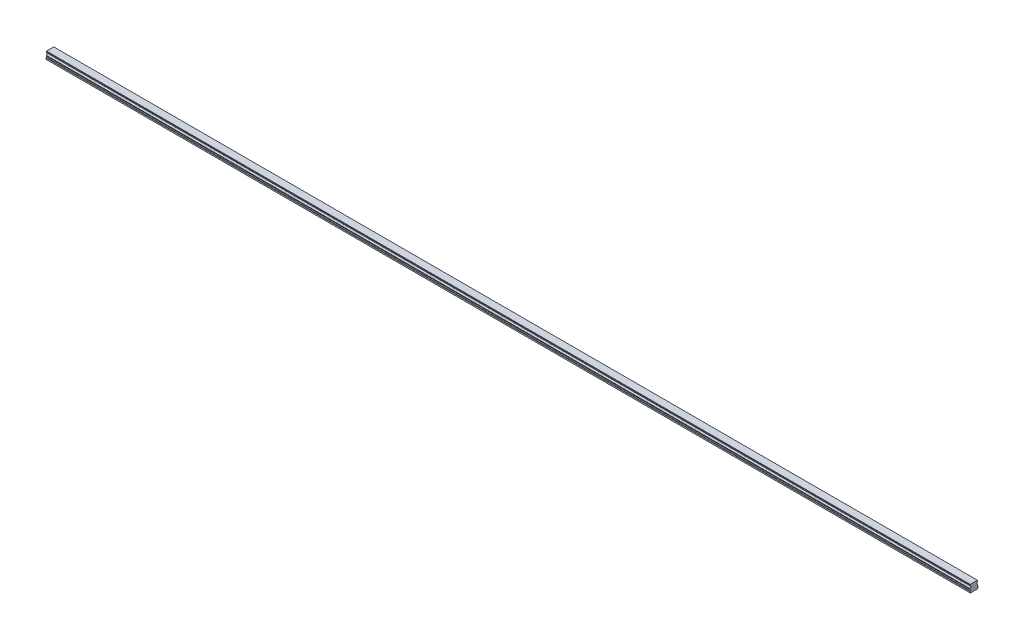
ISO-10303-21;
HEADER;
FILE_DESCRIPTION(('STEP AP214'),'2;1');
FILE_NAME('part.step','',(''),(''),'','','');
FILE_SCHEMA(('AUTOMOTIVE_DESIGN { 1 0 10303 214 1 1 1 1 }'));
ENDSEC;
DATA;
#1=APPLICATION_CONTEXT('core data for automotive mechanical design processes');
#2=APPLICATION_PROTOCOL_DEFINITION('international standard','automotive_design',2000,#1);
#3=PRODUCT_CONTEXT('',#1,'mechanical');
#4=PRODUCT('Part','Part','',(#3));
#5=PRODUCT_RELATED_PRODUCT_CATEGORY('part','',(#4));
#6=PRODUCT_DEFINITION_FORMATION('','',#4);
#7=PRODUCT_DEFINITION_CONTEXT('part definition',#1,'design');
#8=PRODUCT_DEFINITION('design','',#6,#7);
#9=PRODUCT_DEFINITION_SHAPE('','',#8);
#10=(LENGTH_UNIT() NAMED_UNIT(*) SI_UNIT(.MILLI.,.METRE.));
#11=(NAMED_UNIT(*) PLANE_ANGLE_UNIT() SI_UNIT($,.RADIAN.));
#12=(NAMED_UNIT(*) SI_UNIT($,.STERADIAN.) SOLID_ANGLE_UNIT());
#13=UNCERTAINTY_MEASURE_WITH_UNIT(LENGTH_MEASURE(1.E-05),#10,'distance_accuracy_value','');
#14=(GEOMETRIC_REPRESENTATION_CONTEXT(3) GLOBAL_UNCERTAINTY_ASSIGNED_CONTEXT((#13)) GLOBAL_UNIT_ASSIGNED_CONTEXT((#10,
#11,#12)) REPRESENTATION_CONTEXT('',''));
#15=CARTESIAN_POINT('',(0.,0.,0.));
#16=DIRECTION('',(0.,0.,1.));
#17=DIRECTION('',(1.,0.,0.));
#18=AXIS2_PLACEMENT_3D('',#15,#16,#17);
#19=CARTESIAN_POINT('',(1650.,0.399999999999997,0.));
#20=DIRECTION('',(0.,-1.,0.));
#21=DIRECTION('',(0.,0.,-1.));
#22=AXIS2_PLACEMENT_3D('',#19,#20,#21);
#23=CONICAL_SURFACE('',#22,2.89999999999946,0.785398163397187);
#24=CARTESIAN_POINT('',(1650.,0.799999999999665,0.));
#25=DIRECTION('',(0.,1.,0.));
#26=DIRECTION('',(0.,0.,1.));
#27=AXIS2_PLACEMENT_3D('',#24,#25,#26);
#28=CIRCLE('',#27,2.5);
#29=CARTESIAN_POINT('',(1650.,0.799999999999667,2.5));
#30=VERTEX_POINT('',#29);
#31=EDGE_CURVE('E11',#30,#30,#28,.F.);
#32=ORIENTED_EDGE('',*,*,#31,.F.);
#33=EDGE_LOOP('',(#32));
#34=FACE_BOUND('',#33,.T.);
#35=CARTESIAN_POINT('',(1650.,0.399999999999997,0.));
#36=DIRECTION('',(0.,1.,0.));
#37=DIRECTION('',(0.,0.,1.));
#38=AXIS2_PLACEMENT_3D('',#35,#36,#37);
#39=CIRCLE('',#38,2.89999999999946);
#40=CARTESIAN_POINT('',(1650.,0.399999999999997,2.89999999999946));
#41=VERTEX_POINT('',#40);
#42=EDGE_CURVE('E733',#41,#41,#39,.T.);
#43=ORIENTED_EDGE('',*,*,#42,.F.);
#44=EDGE_LOOP('',(#43));
#45=FACE_BOUND('',#44,.T.);
#46=ADVANCED_FACE('F39',(#34,#45),#23,.F.);
#47=CARTESIAN_POINT('',(1650.,7.,0.));
#48=DIRECTION('',(0.,-1.,0.));
#49=DIRECTION('',(0.,0.,-1.));
#50=AXIS2_PLACEMENT_3D('',#47,#48,#49);
#51=CYLINDRICAL_SURFACE('',#50,2.5);
#52=ORIENTED_EDGE('',*,*,#31,.T.);
#53=EDGE_LOOP('',(#52));
#54=FACE_BOUND('',#53,.T.);
#55=CARTESIAN_POINT('',(1650.,7.,0.));
#56=DIRECTION('',(0.,-1.,0.));
#57=DIRECTION('',(0.,0.,-1.));
#58=AXIS2_PLACEMENT_3D('',#55,#56,#57);
#59=CIRCLE('',#58,2.5);
#60=CARTESIAN_POINT('',(1650.,7.,-2.50000000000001));
#61=VERTEX_POINT('',#60);
#62=EDGE_CURVE('E49',#61,#61,#59,.T.);
#63=ORIENTED_EDGE('',*,*,#62,.F.);
#64=EDGE_LOOP('',(#63));
#65=FACE_BOUND('',#64,.T.);
#66=ADVANCED_FACE('F1015',(#54,#65),#51,.F.);
#67=CARTESIAN_POINT('',(1650.,7.,0.));
#68=DIRECTION('',(0.,-1.,0.));
#69=DIRECTION('',(0.,0.,-1.));
#70=AXIS2_PLACEMENT_3D('',#67,#68,#69);
#71=PLANE('',#70);
#72=CARTESIAN_POINT('',(1650.,7.,0.));
#73=DIRECTION('',(0.,-1.,0.));
#74=DIRECTION('',(0.,0.,-1.));
#75=AXIS2_PLACEMENT_3D('',#72,#73,#74);
#76=CIRCLE('',#75,2.1);
#77=CARTESIAN_POINT('',(1650.,7.,-2.1));
#78=VERTEX_POINT('',#77);
#79=EDGE_CURVE('E42',#78,#78,#76,.T.);
#80=ORIENTED_EDGE('',*,*,#79,.F.);
#81=EDGE_LOOP('',(#80));
#82=FACE_BOUND('',#81,.T.);
#83=ORIENTED_EDGE('',*,*,#62,.T.);
#84=EDGE_LOOP('',(#83));
#85=FACE_BOUND('',#84,.T.);
#86=ADVANCED_FACE('F1020',(#82,#85),#71,.T.);
#87=CARTESIAN_POINT('',(1590.,0.399999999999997,0.));
#88=DIRECTION('',(0.,-1.,0.));
#89=DIRECTION('',(0.,0.,-1.));
#90=AXIS2_PLACEMENT_3D('',#87,#88,#89);
#91=CONICAL_SURFACE('',#90,2.89999999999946,0.785398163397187);
#92=CARTESIAN_POINT('',(1590.,0.799999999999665,0.));
#93=DIRECTION('',(0.,1.,0.));
#94=DIRECTION('',(0.,0.,1.));
#95=AXIS2_PLACEMENT_3D('',#92,#93,#94);
#96=CIRCLE('',#95,2.5);
#97=CARTESIAN_POINT('',(1590.,0.799999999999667,2.5));
#98=VERTEX_POINT('',#97);
#99=EDGE_CURVE('E729',#98,#98,#96,.F.);
#100=ORIENTED_EDGE('',*,*,#99,.F.);
#101=EDGE_LOOP('',(#100));
#102=FACE_BOUND('',#101,.T.);
#103=CARTESIAN_POINT('',(1590.,0.399999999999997,0.));
#104=DIRECTION('',(0.,1.,0.));
#105=DIRECTION('',(0.,0.,1.));
#106=AXIS2_PLACEMENT_3D('',#103,#104,#105);
#107=CIRCLE('',#106,2.89999999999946);
#108=CARTESIAN_POINT('',(1590.,0.399999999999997,2.89999999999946));
#109=VERTEX_POINT('',#108);
#110=EDGE_CURVE('E721',#109,#109,#107,.T.);
#111=ORIENTED_EDGE('',*,*,#110,.F.);
#112=EDGE_LOOP('',(#111));
#113=FACE_BOUND('',#112,.T.);
#114=ADVANCED_FACE('F1395',(#102,#113),#91,.F.);
#115=CARTESIAN_POINT('',(1590.,7.,0.));
#116=DIRECTION('',(0.,-1.,0.));
#117=DIRECTION('',(0.,0.,-1.));
#118=AXIS2_PLACEMENT_3D('',#115,#116,#117);
#119=CYLINDRICAL_SURFACE('',#118,2.5);
#120=ORIENTED_EDGE('',*,*,#99,.T.);
#121=EDGE_LOOP('',(#120));
#122=FACE_BOUND('',#121,.T.);
#123=CARTESIAN_POINT('',(1590.,7.,0.));
#124=DIRECTION('',(0.,-1.,0.));
#125=DIRECTION('',(0.,0.,-1.));
#126=AXIS2_PLACEMENT_3D('',#123,#124,#125);
#127=CIRCLE('',#126,2.5);
#128=CARTESIAN_POINT('',(1590.,7.,-2.50000000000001));
#129=VERTEX_POINT('',#128);
#130=EDGE_CURVE('E725',#129,#129,#127,.T.);
#131=ORIENTED_EDGE('',*,*,#130,.F.);
#132=EDGE_LOOP('',(#131));
#133=FACE_BOUND('',#132,.T.);
#134=ADVANCED_FACE('F1391',(#122,#133),#119,.F.);
#135=CARTESIAN_POINT('',(1590.,7.,0.));
#136=DIRECTION('',(0.,-1.,0.));
#137=DIRECTION('',(0.,0.,-1.));
#138=AXIS2_PLACEMENT_3D('',#135,#136,#137);
#139=PLANE('',#138);
#140=CARTESIAN_POINT('',(1590.,7.,0.));
#141=DIRECTION('',(0.,-1.,0.));
#142=DIRECTION('',(0.,0.,-1.));
#143=AXIS2_PLACEMENT_3D('',#140,#141,#142);
#144=CIRCLE('',#143,2.1);
#145=CARTESIAN_POINT('',(1590.,7.,-2.1));
#146=VERTEX_POINT('',#145);
#147=EDGE_CURVE('E840',#146,#146,#144,.T.);
#148=ORIENTED_EDGE('',*,*,#147,.F.);
#149=EDGE_LOOP('',(#148));
#150=FACE_BOUND('',#149,.T.);
#151=ORIENTED_EDGE('',*,*,#130,.T.);
#152=EDGE_LOOP('',(#151));
#153=FACE_BOUND('',#152,.T.);
#154=ADVANCED_FACE('F1387',(#150,#153),#139,.T.);
#155=CARTESIAN_POINT('',(1530.,0.399999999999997,0.));
#156=DIRECTION('',(0.,-1.,0.));
#157=DIRECTION('',(0.,0.,-1.));
#158=AXIS2_PLACEMENT_3D('',#155,#156,#157);
#159=CONICAL_SURFACE('',#158,2.89999999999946,0.785398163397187);
#160=CARTESIAN_POINT('',(1530.,0.799999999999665,0.));
#161=DIRECTION('',(0.,1.,0.));
#162=DIRECTION('',(0.,0.,1.));
#163=AXIS2_PLACEMENT_3D('',#160,#161,#162);
#164=CIRCLE('',#163,2.5);
#165=CARTESIAN_POINT('',(1530.,0.799999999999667,2.5));
#166=VERTEX_POINT('',#165);
#167=EDGE_CURVE('E717',#166,#166,#164,.F.);
#168=ORIENTED_EDGE('',*,*,#167,.F.);
#169=EDGE_LOOP('',(#168));
#170=FACE_BOUND('',#169,.T.);
#171=CARTESIAN_POINT('',(1530.,0.399999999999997,0.));
#172=DIRECTION('',(0.,1.,0.));
#173=DIRECTION('',(0.,0.,1.));
#174=AXIS2_PLACEMENT_3D('',#171,#172,#173);
#175=CIRCLE('',#174,2.89999999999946);
#176=CARTESIAN_POINT('',(1530.,0.399999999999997,2.89999999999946));
#177=VERTEX_POINT('',#176);
#178=EDGE_CURVE('E709',#177,#177,#175,.T.);
#179=ORIENTED_EDGE('',*,*,#178,.F.);
#180=EDGE_LOOP('',(#179));
#181=FACE_BOUND('',#180,.T.);
#182=ADVANCED_FACE('F1383',(#170,#181),#159,.F.);
#183=CARTESIAN_POINT('',(1530.,7.,0.));
#184=DIRECTION('',(0.,-1.,0.));
#185=DIRECTION('',(0.,0.,-1.));
#186=AXIS2_PLACEMENT_3D('',#183,#184,#185);
#187=CYLINDRICAL_SURFACE('',#186,2.5);
#188=ORIENTED_EDGE('',*,*,#167,.T.);
#189=EDGE_LOOP('',(#188));
#190=FACE_BOUND('',#189,.T.);
#191=CARTESIAN_POINT('',(1530.,7.,0.));
#192=DIRECTION('',(0.,-1.,0.));
#193=DIRECTION('',(0.,0.,-1.));
#194=AXIS2_PLACEMENT_3D('',#191,#192,#193);
#195=CIRCLE('',#194,2.5);
#196=CARTESIAN_POINT('',(1530.,7.,-2.50000000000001));
#197=VERTEX_POINT('',#196);
#198=EDGE_CURVE('E713',#197,#197,#195,.T.);
#199=ORIENTED_EDGE('',*,*,#198,.F.);
#200=EDGE_LOOP('',(#199));
#201=FACE_BOUND('',#200,.T.);
#202=ADVANCED_FACE('F1379',(#190,#201),#187,.F.);
#203=CARTESIAN_POINT('',(1530.,7.,0.));
#204=DIRECTION('',(0.,-1.,0.));
#205=DIRECTION('',(0.,0.,-1.));
#206=AXIS2_PLACEMENT_3D('',#203,#204,#205);
#207=PLANE('',#206);
#208=CARTESIAN_POINT('',(1530.,7.,0.));
#209=DIRECTION('',(0.,-1.,0.));
#210=DIRECTION('',(0.,0.,-1.));
#211=AXIS2_PLACEMENT_3D('',#208,#209,#210);
#212=CIRCLE('',#211,2.1);
#213=CARTESIAN_POINT('',(1530.,7.,-2.1));
#214=VERTEX_POINT('',#213);
#215=EDGE_CURVE('E837',#214,#214,#212,.T.);
#216=ORIENTED_EDGE('',*,*,#215,.F.);
#217=EDGE_LOOP('',(#216));
#218=FACE_BOUND('',#217,.T.);
#219=ORIENTED_EDGE('',*,*,#198,.T.);
#220=EDGE_LOOP('',(#219));
#221=FACE_BOUND('',#220,.T.);
#222=ADVANCED_FACE('F1375',(#218,#221),#207,.T.);
#223=CARTESIAN_POINT('',(1470.,0.399999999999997,0.));
#224=DIRECTION('',(0.,-1.,0.));
#225=DIRECTION('',(0.,0.,-1.));
#226=AXIS2_PLACEMENT_3D('',#223,#224,#225);
#227=CONICAL_SURFACE('',#226,2.89999999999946,0.785398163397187);
#228=CARTESIAN_POINT('',(1470.,0.799999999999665,0.));
#229=DIRECTION('',(0.,1.,0.));
#230=DIRECTION('',(0.,0.,1.));
#231=AXIS2_PLACEMENT_3D('',#228,#229,#230);
#232=CIRCLE('',#231,2.5);
#233=CARTESIAN_POINT('',(1470.,0.799999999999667,2.5));
#234=VERTEX_POINT('',#233);
#235=EDGE_CURVE('E705',#234,#234,#232,.F.);
#236=ORIENTED_EDGE('',*,*,#235,.F.);
#237=EDGE_LOOP('',(#236));
#238=FACE_BOUND('',#237,.T.);
#239=CARTESIAN_POINT('',(1470.,0.399999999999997,0.));
#240=DIRECTION('',(0.,1.,0.));
#241=DIRECTION('',(0.,0.,1.));
#242=AXIS2_PLACEMENT_3D('',#239,#240,#241);
#243=CIRCLE('',#242,2.89999999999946);
#244=CARTESIAN_POINT('',(1470.,0.399999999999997,2.89999999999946));
#245=VERTEX_POINT('',#244);
#246=EDGE_CURVE('E697',#245,#245,#243,.T.);
#247=ORIENTED_EDGE('',*,*,#246,.F.);
#248=EDGE_LOOP('',(#247));
#249=FACE_BOUND('',#248,.T.);
#250=ADVANCED_FACE('F1371',(#238,#249),#227,.F.);
#251=CARTESIAN_POINT('',(1470.,7.,0.));
#252=DIRECTION('',(0.,-1.,0.));
#253=DIRECTION('',(0.,0.,-1.));
#254=AXIS2_PLACEMENT_3D('',#251,#252,#253);
#255=CYLINDRICAL_SURFACE('',#254,2.5);
#256=ORIENTED_EDGE('',*,*,#235,.T.);
#257=EDGE_LOOP('',(#256));
#258=FACE_BOUND('',#257,.T.);
#259=CARTESIAN_POINT('',(1470.,7.,0.));
#260=DIRECTION('',(0.,-1.,0.));
#261=DIRECTION('',(0.,0.,-1.));
#262=AXIS2_PLACEMENT_3D('',#259,#260,#261);
#263=CIRCLE('',#262,2.5);
#264=CARTESIAN_POINT('',(1470.,7.,-2.50000000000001));
#265=VERTEX_POINT('',#264);
#266=EDGE_CURVE('E701',#265,#265,#263,.T.);
#267=ORIENTED_EDGE('',*,*,#266,.F.);
#268=EDGE_LOOP('',(#267));
#269=FACE_BOUND('',#268,.T.);
#270=ADVANCED_FACE('F1367',(#258,#269),#255,.F.);
#271=CARTESIAN_POINT('',(1470.,7.,0.));
#272=DIRECTION('',(0.,-1.,0.));
#273=DIRECTION('',(0.,0.,-1.));
#274=AXIS2_PLACEMENT_3D('',#271,#272,#273);
#275=PLANE('',#274);
#276=CARTESIAN_POINT('',(1470.,7.,0.));
#277=DIRECTION('',(0.,-1.,0.));
#278=DIRECTION('',(0.,0.,-1.));
#279=AXIS2_PLACEMENT_3D('',#276,#277,#278);
#280=CIRCLE('',#279,2.1);
#281=CARTESIAN_POINT('',(1470.,7.,-2.1));
#282=VERTEX_POINT('',#281);
#283=EDGE_CURVE('E833',#282,#282,#280,.T.);
#284=ORIENTED_EDGE('',*,*,#283,.F.);
#285=EDGE_LOOP('',(#284));
#286=FACE_BOUND('',#285,.T.);
#287=ORIENTED_EDGE('',*,*,#266,.T.);
#288=EDGE_LOOP('',(#287));
#289=FACE_BOUND('',#288,.T.);
#290=ADVANCED_FACE('F1363',(#286,#289),#275,.T.);
#291=CARTESIAN_POINT('',(1410.,0.399999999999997,0.));
#292=DIRECTION('',(0.,-1.,0.));
#293=DIRECTION('',(0.,0.,-1.));
#294=AXIS2_PLACEMENT_3D('',#291,#292,#293);
#295=CONICAL_SURFACE('',#294,2.89999999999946,0.785398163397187);
#296=CARTESIAN_POINT('',(1410.,0.799999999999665,0.));
#297=DIRECTION('',(0.,1.,0.));
#298=DIRECTION('',(0.,0.,1.));
#299=AXIS2_PLACEMENT_3D('',#296,#297,#298);
#300=CIRCLE('',#299,2.5);
#301=CARTESIAN_POINT('',(1410.,0.799999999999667,2.5));
#302=VERTEX_POINT('',#301);
#303=EDGE_CURVE('E693',#302,#302,#300,.F.);
#304=ORIENTED_EDGE('',*,*,#303,.F.);
#305=EDGE_LOOP('',(#304));
#306=FACE_BOUND('',#305,.T.);
#307=CARTESIAN_POINT('',(1410.,0.399999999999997,0.));
#308=DIRECTION('',(0.,1.,0.));
#309=DIRECTION('',(0.,0.,1.));
#310=AXIS2_PLACEMENT_3D('',#307,#308,#309);
#311=CIRCLE('',#310,2.89999999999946);
#312=CARTESIAN_POINT('',(1410.,0.399999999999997,2.89999999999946));
#313=VERTEX_POINT('',#312);
#314=EDGE_CURVE('E685',#313,#313,#311,.T.);
#315=ORIENTED_EDGE('',*,*,#314,.F.);
#316=EDGE_LOOP('',(#315));
#317=FACE_BOUND('',#316,.T.);
#318=ADVANCED_FACE('F1359',(#306,#317),#295,.F.);
#319=CARTESIAN_POINT('',(1410.,7.,0.));
#320=DIRECTION('',(0.,-1.,0.));
#321=DIRECTION('',(0.,0.,-1.));
#322=AXIS2_PLACEMENT_3D('',#319,#320,#321);
#323=CYLINDRICAL_SURFACE('',#322,2.5);
#324=ORIENTED_EDGE('',*,*,#303,.T.);
#325=EDGE_LOOP('',(#324));
#326=FACE_BOUND('',#325,.T.);
#327=CARTESIAN_POINT('',(1410.,7.,0.));
#328=DIRECTION('',(0.,-1.,0.));
#329=DIRECTION('',(0.,0.,-1.));
#330=AXIS2_PLACEMENT_3D('',#327,#328,#329);
#331=CIRCLE('',#330,2.5);
#332=CARTESIAN_POINT('',(1410.,7.,-2.50000000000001));
#333=VERTEX_POINT('',#332);
#334=EDGE_CURVE('E689',#333,#333,#331,.T.);
#335=ORIENTED_EDGE('',*,*,#334,.F.);
#336=EDGE_LOOP('',(#335));
#337=FACE_BOUND('',#336,.T.);
#338=ADVANCED_FACE('F1355',(#326,#337),#323,.F.);
#339=CARTESIAN_POINT('',(1410.,7.,0.));
#340=DIRECTION('',(0.,-1.,0.));
#341=DIRECTION('',(0.,0.,-1.));
#342=AXIS2_PLACEMENT_3D('',#339,#340,#341);
#343=PLANE('',#342);
#344=CARTESIAN_POINT('',(1410.,7.,0.));
#345=DIRECTION('',(0.,-1.,0.));
#346=DIRECTION('',(0.,0.,-1.));
#347=AXIS2_PLACEMENT_3D('',#344,#345,#346);
#348=CIRCLE('',#347,2.1);
#349=CARTESIAN_POINT('',(1410.,7.,-2.1));
#350=VERTEX_POINT('',#349);
#351=EDGE_CURVE('E829',#350,#350,#348,.T.);
#352=ORIENTED_EDGE('',*,*,#351,.F.);
#353=EDGE_LOOP('',(#352));
#354=FACE_BOUND('',#353,.T.);
#355=ORIENTED_EDGE('',*,*,#334,.T.);
#356=EDGE_LOOP('',(#355));
#357=FACE_BOUND('',#356,.T.);
#358=ADVANCED_FACE('F1351',(#354,#357),#343,.T.);
#359=CARTESIAN_POINT('',(1350.,0.399999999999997,0.));
#360=DIRECTION('',(0.,-1.,0.));
#361=DIRECTION('',(0.,0.,-1.));
#362=AXIS2_PLACEMENT_3D('',#359,#360,#361);
#363=CONICAL_SURFACE('',#362,2.89999999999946,0.785398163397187);
#364=CARTESIAN_POINT('',(1350.,0.799999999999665,0.));
#365=DIRECTION('',(0.,1.,0.));
#366=DIRECTION('',(0.,0.,1.));
#367=AXIS2_PLACEMENT_3D('',#364,#365,#366);
#368=CIRCLE('',#367,2.5);
#369=CARTESIAN_POINT('',(1350.,0.799999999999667,2.5));
#370=VERTEX_POINT('',#369);
#371=EDGE_CURVE('E681',#370,#370,#368,.F.);
#372=ORIENTED_EDGE('',*,*,#371,.F.);
#373=EDGE_LOOP('',(#372));
#374=FACE_BOUND('',#373,.T.);
#375=CARTESIAN_POINT('',(1350.,0.399999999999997,0.));
#376=DIRECTION('',(0.,1.,0.));
#377=DIRECTION('',(0.,0.,1.));
#378=AXIS2_PLACEMENT_3D('',#375,#376,#377);
#379=CIRCLE('',#378,2.89999999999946);
#380=CARTESIAN_POINT('',(1350.,0.399999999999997,2.89999999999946));
#381=VERTEX_POINT('',#380);
#382=EDGE_CURVE('E673',#381,#381,#379,.T.);
#383=ORIENTED_EDGE('',*,*,#382,.F.);
#384=EDGE_LOOP('',(#383));
#385=FACE_BOUND('',#384,.T.);
#386=ADVANCED_FACE('F1347',(#374,#385),#363,.F.);
#387=CARTESIAN_POINT('',(1350.,7.,0.));
#388=DIRECTION('',(0.,-1.,0.));
#389=DIRECTION('',(0.,0.,-1.));
#390=AXIS2_PLACEMENT_3D('',#387,#388,#389);
#391=CYLINDRICAL_SURFACE('',#390,2.5);
#392=ORIENTED_EDGE('',*,*,#371,.T.);
#393=EDGE_LOOP('',(#392));
#394=FACE_BOUND('',#393,.T.);
#395=CARTESIAN_POINT('',(1350.,7.,0.));
#396=DIRECTION('',(0.,-1.,0.));
#397=DIRECTION('',(0.,0.,-1.));
#398=AXIS2_PLACEMENT_3D('',#395,#396,#397);
#399=CIRCLE('',#398,2.5);
#400=CARTESIAN_POINT('',(1350.,7.,-2.50000000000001));
#401=VERTEX_POINT('',#400);
#402=EDGE_CURVE('E677',#401,#401,#399,.T.);
#403=ORIENTED_EDGE('',*,*,#402,.F.);
#404=EDGE_LOOP('',(#403));
#405=FACE_BOUND('',#404,.T.);
#406=ADVANCED_FACE('F1343',(#394,#405),#391,.F.);
#407=CARTESIAN_POINT('',(1350.,7.,0.));
#408=DIRECTION('',(0.,-1.,0.));
#409=DIRECTION('',(0.,0.,-1.));
#410=AXIS2_PLACEMENT_3D('',#407,#408,#409);
#411=PLANE('',#410);
#412=CARTESIAN_POINT('',(1350.,7.,0.));
#413=DIRECTION('',(0.,-1.,0.));
#414=DIRECTION('',(0.,0.,-1.));
#415=AXIS2_PLACEMENT_3D('',#412,#413,#414);
#416=CIRCLE('',#415,2.1);
#417=CARTESIAN_POINT('',(1350.,7.,-2.1));
#418=VERTEX_POINT('',#417);
#419=EDGE_CURVE('E825',#418,#418,#416,.T.);
#420=ORIENTED_EDGE('',*,*,#419,.F.);
#421=EDGE_LOOP('',(#420));
#422=FACE_BOUND('',#421,.T.);
#423=ORIENTED_EDGE('',*,*,#402,.T.);
#424=EDGE_LOOP('',(#423));
#425=FACE_BOUND('',#424,.T.);
#426=ADVANCED_FACE('F1339',(#422,#425),#411,.T.);
#427=CARTESIAN_POINT('',(1290.,0.399999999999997,0.));
#428=DIRECTION('',(0.,-1.,0.));
#429=DIRECTION('',(0.,0.,-1.));
#430=AXIS2_PLACEMENT_3D('',#427,#428,#429);
#431=CONICAL_SURFACE('',#430,2.89999999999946,0.785398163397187);
#432=CARTESIAN_POINT('',(1290.,0.799999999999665,0.));
#433=DIRECTION('',(0.,1.,0.));
#434=DIRECTION('',(0.,0.,1.));
#435=AXIS2_PLACEMENT_3D('',#432,#433,#434);
#436=CIRCLE('',#435,2.5);
#437=CARTESIAN_POINT('',(1290.,0.799999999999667,2.5));
#438=VERTEX_POINT('',#437);
#439=EDGE_CURVE('E669',#438,#438,#436,.F.);
#440=ORIENTED_EDGE('',*,*,#439,.F.);
#441=EDGE_LOOP('',(#440));
#442=FACE_BOUND('',#441,.T.);
#443=CARTESIAN_POINT('',(1290.,0.399999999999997,0.));
#444=DIRECTION('',(0.,1.,0.));
#445=DIRECTION('',(0.,0.,1.));
#446=AXIS2_PLACEMENT_3D('',#443,#444,#445);
#447=CIRCLE('',#446,2.89999999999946);
#448=CARTESIAN_POINT('',(1290.,0.399999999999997,2.89999999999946));
#449=VERTEX_POINT('',#448);
#450=EDGE_CURVE('E661',#449,#449,#447,.T.);
#451=ORIENTED_EDGE('',*,*,#450,.F.);
#452=EDGE_LOOP('',(#451));
#453=FACE_BOUND('',#452,.T.);
#454=ADVANCED_FACE('F1335',(#442,#453),#431,.F.);
#455=CARTESIAN_POINT('',(1290.,7.,0.));
#456=DIRECTION('',(0.,-1.,0.));
#457=DIRECTION('',(0.,0.,-1.));
#458=AXIS2_PLACEMENT_3D('',#455,#456,#457);
#459=CYLINDRICAL_SURFACE('',#458,2.5);
#460=ORIENTED_EDGE('',*,*,#439,.T.);
#461=EDGE_LOOP('',(#460));
#462=FACE_BOUND('',#461,.T.);
#463=CARTESIAN_POINT('',(1290.,7.,0.));
#464=DIRECTION('',(0.,-1.,0.));
#465=DIRECTION('',(0.,0.,-1.));
#466=AXIS2_PLACEMENT_3D('',#463,#464,#465);
#467=CIRCLE('',#466,2.5);
#468=CARTESIAN_POINT('',(1290.,7.,-2.50000000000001));
#469=VERTEX_POINT('',#468);
#470=EDGE_CURVE('E665',#469,#469,#467,.T.);
#471=ORIENTED_EDGE('',*,*,#470,.F.);
#472=EDGE_LOOP('',(#471));
#473=FACE_BOUND('',#472,.T.);
#474=ADVANCED_FACE('F1331',(#462,#473),#459,.F.);
#475=CARTESIAN_POINT('',(1290.,7.,0.));
#476=DIRECTION('',(0.,-1.,0.));
#477=DIRECTION('',(0.,0.,-1.));
#478=AXIS2_PLACEMENT_3D('',#475,#476,#477);
#479=PLANE('',#478);
#480=CARTESIAN_POINT('',(1290.,7.,0.));
#481=DIRECTION('',(0.,-1.,0.));
#482=DIRECTION('',(0.,0.,-1.));
#483=AXIS2_PLACEMENT_3D('',#480,#481,#482);
#484=CIRCLE('',#483,2.1);
#485=CARTESIAN_POINT('',(1290.,7.,-2.1));
#486=VERTEX_POINT('',#485);
#487=EDGE_CURVE('E821',#486,#486,#484,.T.);
#488=ORIENTED_EDGE('',*,*,#487,.F.);
#489=EDGE_LOOP('',(#488));
#490=FACE_BOUND('',#489,.T.);
#491=ORIENTED_EDGE('',*,*,#470,.T.);
#492=EDGE_LOOP('',(#491));
#493=FACE_BOUND('',#492,.T.);
#494=ADVANCED_FACE('F1327',(#490,#493),#479,.T.);
#495=CARTESIAN_POINT('',(1230.,0.399999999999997,0.));
#496=DIRECTION('',(0.,-1.,0.));
#497=DIRECTION('',(0.,0.,-1.));
#498=AXIS2_PLACEMENT_3D('',#495,#496,#497);
#499=CONICAL_SURFACE('',#498,2.89999999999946,0.785398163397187);
#500=CARTESIAN_POINT('',(1230.,0.799999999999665,0.));
#501=DIRECTION('',(0.,1.,0.));
#502=DIRECTION('',(0.,0.,1.));
#503=AXIS2_PLACEMENT_3D('',#500,#501,#502);
#504=CIRCLE('',#503,2.5);
#505=CARTESIAN_POINT('',(1230.,0.799999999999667,2.5));
#506=VERTEX_POINT('',#505);
#507=EDGE_CURVE('E657',#506,#506,#504,.F.);
#508=ORIENTED_EDGE('',*,*,#507,.F.);
#509=EDGE_LOOP('',(#508));
#510=FACE_BOUND('',#509,.T.);
#511=CARTESIAN_POINT('',(1230.,0.399999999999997,0.));
#512=DIRECTION('',(0.,1.,0.));
#513=DIRECTION('',(0.,0.,1.));
#514=AXIS2_PLACEMENT_3D('',#511,#512,#513);
#515=CIRCLE('',#514,2.89999999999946);
#516=CARTESIAN_POINT('',(1230.,0.399999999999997,2.89999999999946));
#517=VERTEX_POINT('',#516);
#518=EDGE_CURVE('E649',#517,#517,#515,.T.);
#519=ORIENTED_EDGE('',*,*,#518,.F.);
#520=EDGE_LOOP('',(#519));
#521=FACE_BOUND('',#520,.T.);
#522=ADVANCED_FACE('F1323',(#510,#521),#499,.F.);
#523=CARTESIAN_POINT('',(1230.,7.,0.));
#524=DIRECTION('',(0.,-1.,0.));
#525=DIRECTION('',(0.,0.,-1.));
#526=AXIS2_PLACEMENT_3D('',#523,#524,#525);
#527=CYLINDRICAL_SURFACE('',#526,2.5);
#528=ORIENTED_EDGE('',*,*,#507,.T.);
#529=EDGE_LOOP('',(#528));
#530=FACE_BOUND('',#529,.T.);
#531=CARTESIAN_POINT('',(1230.,7.,0.));
#532=DIRECTION('',(0.,-1.,0.));
#533=DIRECTION('',(0.,0.,-1.));
#534=AXIS2_PLACEMENT_3D('',#531,#532,#533);
#535=CIRCLE('',#534,2.5);
#536=CARTESIAN_POINT('',(1230.,7.,-2.50000000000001));
#537=VERTEX_POINT('',#536);
#538=EDGE_CURVE('E653',#537,#537,#535,.T.);
#539=ORIENTED_EDGE('',*,*,#538,.F.);
#540=EDGE_LOOP('',(#539));
#541=FACE_BOUND('',#540,.T.);
#542=ADVANCED_FACE('F1319',(#530,#541),#527,.F.);
#543=CARTESIAN_POINT('',(1230.,7.,0.));
#544=DIRECTION('',(0.,-1.,0.));
#545=DIRECTION('',(0.,0.,-1.));
#546=AXIS2_PLACEMENT_3D('',#543,#544,#545);
#547=PLANE('',#546);
#548=CARTESIAN_POINT('',(1230.,7.,0.));
#549=DIRECTION('',(0.,-1.,0.));
#550=DIRECTION('',(0.,0.,-1.));
#551=AXIS2_PLACEMENT_3D('',#548,#549,#550);
#552=CIRCLE('',#551,2.1);
#553=CARTESIAN_POINT('',(1230.,7.,-2.1));
#554=VERTEX_POINT('',#553);
#555=EDGE_CURVE('E817',#554,#554,#552,.T.);
#556=ORIENTED_EDGE('',*,*,#555,.F.);
#557=EDGE_LOOP('',(#556));
#558=FACE_BOUND('',#557,.T.);
#559=ORIENTED_EDGE('',*,*,#538,.T.);
#560=EDGE_LOOP('',(#559));
#561=FACE_BOUND('',#560,.T.);
#562=ADVANCED_FACE('F1315',(#558,#561),#547,.T.);
#563=CARTESIAN_POINT('',(1170.,0.399999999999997,0.));
#564=DIRECTION('',(0.,-1.,0.));
#565=DIRECTION('',(0.,0.,-1.));
#566=AXIS2_PLACEMENT_3D('',#563,#564,#565);
#567=CONICAL_SURFACE('',#566,2.89999999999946,0.785398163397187);
#568=CARTESIAN_POINT('',(1170.,0.799999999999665,0.));
#569=DIRECTION('',(0.,1.,0.));
#570=DIRECTION('',(0.,0.,1.));
#571=AXIS2_PLACEMENT_3D('',#568,#569,#570);
#572=CIRCLE('',#571,2.5);
#573=CARTESIAN_POINT('',(1170.,0.799999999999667,2.5));
#574=VERTEX_POINT('',#573);
#575=EDGE_CURVE('E645',#574,#574,#572,.F.);
#576=ORIENTED_EDGE('',*,*,#575,.F.);
#577=EDGE_LOOP('',(#576));
#578=FACE_BOUND('',#577,.T.);
#579=CARTESIAN_POINT('',(1170.,0.399999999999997,0.));
#580=DIRECTION('',(0.,1.,0.));
#581=DIRECTION('',(0.,0.,1.));
#582=AXIS2_PLACEMENT_3D('',#579,#580,#581);
#583=CIRCLE('',#582,2.89999999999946);
#584=CARTESIAN_POINT('',(1170.,0.399999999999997,2.89999999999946));
#585=VERTEX_POINT('',#584);
#586=EDGE_CURVE('E637',#585,#585,#583,.T.);
#587=ORIENTED_EDGE('',*,*,#586,.F.);
#588=EDGE_LOOP('',(#587));
#589=FACE_BOUND('',#588,.T.);
#590=ADVANCED_FACE('F1311',(#578,#589),#567,.F.);
#591=CARTESIAN_POINT('',(1170.,7.,0.));
#592=DIRECTION('',(0.,-1.,0.));
#593=DIRECTION('',(0.,0.,-1.));
#594=AXIS2_PLACEMENT_3D('',#591,#592,#593);
#595=CYLINDRICAL_SURFACE('',#594,2.5);
#596=ORIENTED_EDGE('',*,*,#575,.T.);
#597=EDGE_LOOP('',(#596));
#598=FACE_BOUND('',#597,.T.);
#599=CARTESIAN_POINT('',(1170.,7.,0.));
#600=DIRECTION('',(0.,-1.,0.));
#601=DIRECTION('',(0.,0.,-1.));
#602=AXIS2_PLACEMENT_3D('',#599,#600,#601);
#603=CIRCLE('',#602,2.5);
#604=CARTESIAN_POINT('',(1170.,7.,-2.50000000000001));
#605=VERTEX_POINT('',#604);
#606=EDGE_CURVE('E641',#605,#605,#603,.T.);
#607=ORIENTED_EDGE('',*,*,#606,.F.);
#608=EDGE_LOOP('',(#607));
#609=FACE_BOUND('',#608,.T.);
#610=ADVANCED_FACE('F1307',(#598,#609),#595,.F.);
#611=CARTESIAN_POINT('',(1170.,7.,0.));
#612=DIRECTION('',(0.,-1.,0.));
#613=DIRECTION('',(0.,0.,-1.));
#614=AXIS2_PLACEMENT_3D('',#611,#612,#613);
#615=PLANE('',#614);
#616=CARTESIAN_POINT('',(1170.,7.,0.));
#617=DIRECTION('',(0.,-1.,0.));
#618=DIRECTION('',(0.,0.,-1.));
#619=AXIS2_PLACEMENT_3D('',#616,#617,#618);
#620=CIRCLE('',#619,2.1);
#621=CARTESIAN_POINT('',(1170.,7.,-2.1));
#622=VERTEX_POINT('',#621);
#623=EDGE_CURVE('E813',#622,#622,#620,.T.);
#624=ORIENTED_EDGE('',*,*,#623,.F.);
#625=EDGE_LOOP('',(#624));
#626=FACE_BOUND('',#625,.T.);
#627=ORIENTED_EDGE('',*,*,#606,.T.);
#628=EDGE_LOOP('',(#627));
#629=FACE_BOUND('',#628,.T.);
#630=ADVANCED_FACE('F1303',(#626,#629),#615,.T.);
#631=CARTESIAN_POINT('',(1110.,0.399999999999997,0.));
#632=DIRECTION('',(0.,-1.,0.));
#633=DIRECTION('',(0.,0.,-1.));
#634=AXIS2_PLACEMENT_3D('',#631,#632,#633);
#635=CONICAL_SURFACE('',#634,2.89999999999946,0.785398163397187);
#636=CARTESIAN_POINT('',(1110.,0.799999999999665,0.));
#637=DIRECTION('',(0.,1.,0.));
#638=DIRECTION('',(0.,0.,1.));
#639=AXIS2_PLACEMENT_3D('',#636,#637,#638);
#640=CIRCLE('',#639,2.5);
#641=CARTESIAN_POINT('',(1110.,0.799999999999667,2.5));
#642=VERTEX_POINT('',#641);
#643=EDGE_CURVE('E633',#642,#642,#640,.F.);
#644=ORIENTED_EDGE('',*,*,#643,.F.);
#645=EDGE_LOOP('',(#644));
#646=FACE_BOUND('',#645,.T.);
#647=CARTESIAN_POINT('',(1110.,0.399999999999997,0.));
#648=DIRECTION('',(0.,1.,0.));
#649=DIRECTION('',(0.,0.,1.));
#650=AXIS2_PLACEMENT_3D('',#647,#648,#649);
#651=CIRCLE('',#650,2.89999999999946);
#652=CARTESIAN_POINT('',(1110.,0.399999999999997,2.89999999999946));
#653=VERTEX_POINT('',#652);
#654=EDGE_CURVE('E625',#653,#653,#651,.T.);
#655=ORIENTED_EDGE('',*,*,#654,.F.);
#656=EDGE_LOOP('',(#655));
#657=FACE_BOUND('',#656,.T.);
#658=ADVANCED_FACE('F1299',(#646,#657),#635,.F.);
#659=CARTESIAN_POINT('',(1110.,7.,0.));
#660=DIRECTION('',(0.,-1.,0.));
#661=DIRECTION('',(0.,0.,-1.));
#662=AXIS2_PLACEMENT_3D('',#659,#660,#661);
#663=CYLINDRICAL_SURFACE('',#662,2.5);
#664=ORIENTED_EDGE('',*,*,#643,.T.);
#665=EDGE_LOOP('',(#664));
#666=FACE_BOUND('',#665,.T.);
#667=CARTESIAN_POINT('',(1110.,7.,0.));
#668=DIRECTION('',(0.,-1.,0.));
#669=DIRECTION('',(0.,0.,-1.));
#670=AXIS2_PLACEMENT_3D('',#667,#668,#669);
#671=CIRCLE('',#670,2.5);
#672=CARTESIAN_POINT('',(1110.,7.,-2.50000000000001));
#673=VERTEX_POINT('',#672);
#674=EDGE_CURVE('E629',#673,#673,#671,.T.);
#675=ORIENTED_EDGE('',*,*,#674,.F.);
#676=EDGE_LOOP('',(#675));
#677=FACE_BOUND('',#676,.T.);
#678=ADVANCED_FACE('F1295',(#666,#677),#663,.F.);
#679=CARTESIAN_POINT('',(1110.,7.,0.));
#680=DIRECTION('',(0.,-1.,0.));
#681=DIRECTION('',(0.,0.,-1.));
#682=AXIS2_PLACEMENT_3D('',#679,#680,#681);
#683=PLANE('',#682);
#684=CARTESIAN_POINT('',(1110.,7.,0.));
#685=DIRECTION('',(0.,-1.,0.));
#686=DIRECTION('',(0.,0.,-1.));
#687=AXIS2_PLACEMENT_3D('',#684,#685,#686);
#688=CIRCLE('',#687,2.1);
#689=CARTESIAN_POINT('',(1110.,7.,-2.1));
#690=VERTEX_POINT('',#689);
#691=EDGE_CURVE('E809',#690,#690,#688,.T.);
#692=ORIENTED_EDGE('',*,*,#691,.F.);
#693=EDGE_LOOP('',(#692));
#694=FACE_BOUND('',#693,.T.);
#695=ORIENTED_EDGE('',*,*,#674,.T.);
#696=EDGE_LOOP('',(#695));
#697=FACE_BOUND('',#696,.T.);
#698=ADVANCED_FACE('F1291',(#694,#697),#683,.T.);
#699=CARTESIAN_POINT('',(1050.,0.399999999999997,0.));
#700=DIRECTION('',(0.,-1.,0.));
#701=DIRECTION('',(0.,0.,-1.));
#702=AXIS2_PLACEMENT_3D('',#699,#700,#701);
#703=CONICAL_SURFACE('',#702,2.89999999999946,0.785398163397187);
#704=CARTESIAN_POINT('',(1050.,0.799999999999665,0.));
#705=DIRECTION('',(0.,1.,0.));
#706=DIRECTION('',(0.,0.,1.));
#707=AXIS2_PLACEMENT_3D('',#704,#705,#706);
#708=CIRCLE('',#707,2.5);
#709=CARTESIAN_POINT('',(1050.,0.799999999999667,2.5));
#710=VERTEX_POINT('',#709);
#711=EDGE_CURVE('E621',#710,#710,#708,.F.);
#712=ORIENTED_EDGE('',*,*,#711,.F.);
#713=EDGE_LOOP('',(#712));
#714=FACE_BOUND('',#713,.T.);
#715=CARTESIAN_POINT('',(1050.,0.399999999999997,0.));
#716=DIRECTION('',(0.,1.,0.));
#717=DIRECTION('',(0.,0.,1.));
#718=AXIS2_PLACEMENT_3D('',#715,#716,#717);
#719=CIRCLE('',#718,2.89999999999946);
#720=CARTESIAN_POINT('',(1050.,0.399999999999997,2.89999999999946));
#721=VERTEX_POINT('',#720);
#722=EDGE_CURVE('E613',#721,#721,#719,.T.);
#723=ORIENTED_EDGE('',*,*,#722,.F.);
#724=EDGE_LOOP('',(#723));
#725=FACE_BOUND('',#724,.T.);
#726=ADVANCED_FACE('F1287',(#714,#725),#703,.F.);
#727=CARTESIAN_POINT('',(1050.,7.,0.));
#728=DIRECTION('',(0.,-1.,0.));
#729=DIRECTION('',(0.,0.,-1.));
#730=AXIS2_PLACEMENT_3D('',#727,#728,#729);
#731=CYLINDRICAL_SURFACE('',#730,2.5);
#732=ORIENTED_EDGE('',*,*,#711,.T.);
#733=EDGE_LOOP('',(#732));
#734=FACE_BOUND('',#733,.T.);
#735=CARTESIAN_POINT('',(1050.,7.,0.));
#736=DIRECTION('',(0.,-1.,0.));
#737=DIRECTION('',(0.,0.,-1.));
#738=AXIS2_PLACEMENT_3D('',#735,#736,#737);
#739=CIRCLE('',#738,2.5);
#740=CARTESIAN_POINT('',(1050.,7.,-2.50000000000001));
#741=VERTEX_POINT('',#740);
#742=EDGE_CURVE('E617',#741,#741,#739,.T.);
#743=ORIENTED_EDGE('',*,*,#742,.F.);
#744=EDGE_LOOP('',(#743));
#745=FACE_BOUND('',#744,.T.);
#746=ADVANCED_FACE('F1283',(#734,#745),#731,.F.);
#747=CARTESIAN_POINT('',(1050.,7.,0.));
#748=DIRECTION('',(0.,-1.,0.));
#749=DIRECTION('',(0.,0.,-1.));
#750=AXIS2_PLACEMENT_3D('',#747,#748,#749);
#751=PLANE('',#750);
#752=CARTESIAN_POINT('',(1050.,7.,0.));
#753=DIRECTION('',(0.,-1.,0.));
#754=DIRECTION('',(0.,0.,-1.));
#755=AXIS2_PLACEMENT_3D('',#752,#753,#754);
#756=CIRCLE('',#755,2.1);
#757=CARTESIAN_POINT('',(1050.,7.,-2.1));
#758=VERTEX_POINT('',#757);
#759=EDGE_CURVE('E805',#758,#758,#756,.T.);
#760=ORIENTED_EDGE('',*,*,#759,.F.);
#761=EDGE_LOOP('',(#760));
#762=FACE_BOUND('',#761,.T.);
#763=ORIENTED_EDGE('',*,*,#742,.T.);
#764=EDGE_LOOP('',(#763));
#765=FACE_BOUND('',#764,.T.);
#766=ADVANCED_FACE('F1279',(#762,#765),#751,.T.);
#767=CARTESIAN_POINT('',(990.,0.399999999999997,0.));
#768=DIRECTION('',(0.,-1.,0.));
#769=DIRECTION('',(0.,0.,-1.));
#770=AXIS2_PLACEMENT_3D('',#767,#768,#769);
#771=CONICAL_SURFACE('',#770,2.89999999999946,0.785398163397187);
#772=CARTESIAN_POINT('',(990.,0.799999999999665,0.));
#773=DIRECTION('',(0.,1.,0.));
#774=DIRECTION('',(0.,0.,1.));
#775=AXIS2_PLACEMENT_3D('',#772,#773,#774);
#776=CIRCLE('',#775,2.5);
#777=CARTESIAN_POINT('',(990.,0.799999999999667,2.5));
#778=VERTEX_POINT('',#777);
#779=EDGE_CURVE('E609',#778,#778,#776,.F.);
#780=ORIENTED_EDGE('',*,*,#779,.F.);
#781=EDGE_LOOP('',(#780));
#782=FACE_BOUND('',#781,.T.);
#783=CARTESIAN_POINT('',(990.,0.399999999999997,0.));
#784=DIRECTION('',(0.,1.,0.));
#785=DIRECTION('',(0.,0.,1.));
#786=AXIS2_PLACEMENT_3D('',#783,#784,#785);
#787=CIRCLE('',#786,2.89999999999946);
#788=CARTESIAN_POINT('',(990.,0.399999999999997,2.89999999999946));
#789=VERTEX_POINT('',#788);
#790=EDGE_CURVE('E601',#789,#789,#787,.T.);
#791=ORIENTED_EDGE('',*,*,#790,.F.);
#792=EDGE_LOOP('',(#791));
#793=FACE_BOUND('',#792,.T.);
#794=ADVANCED_FACE('F1275',(#782,#793),#771,.F.);
#795=CARTESIAN_POINT('',(990.,7.,0.));
#796=DIRECTION('',(0.,-1.,0.));
#797=DIRECTION('',(0.,0.,-1.));
#798=AXIS2_PLACEMENT_3D('',#795,#796,#797);
#799=CYLINDRICAL_SURFACE('',#798,2.5);
#800=ORIENTED_EDGE('',*,*,#779,.T.);
#801=EDGE_LOOP('',(#800));
#802=FACE_BOUND('',#801,.T.);
#803=CARTESIAN_POINT('',(990.,7.,0.));
#804=DIRECTION('',(0.,-1.,0.));
#805=DIRECTION('',(0.,0.,-1.));
#806=AXIS2_PLACEMENT_3D('',#803,#804,#805);
#807=CIRCLE('',#806,2.5);
#808=CARTESIAN_POINT('',(990.,7.,-2.50000000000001));
#809=VERTEX_POINT('',#808);
#810=EDGE_CURVE('E605',#809,#809,#807,.T.);
#811=ORIENTED_EDGE('',*,*,#810,.F.);
#812=EDGE_LOOP('',(#811));
#813=FACE_BOUND('',#812,.T.);
#814=ADVANCED_FACE('F1271',(#802,#813),#799,.F.);
#815=CARTESIAN_POINT('',(990.,7.,0.));
#816=DIRECTION('',(0.,-1.,0.));
#817=DIRECTION('',(0.,0.,-1.));
#818=AXIS2_PLACEMENT_3D('',#815,#816,#817);
#819=PLANE('',#818);
#820=CARTESIAN_POINT('',(990.,7.,0.));
#821=DIRECTION('',(0.,-1.,0.));
#822=DIRECTION('',(0.,0.,-1.));
#823=AXIS2_PLACEMENT_3D('',#820,#821,#822);
#824=CIRCLE('',#823,2.1);
#825=CARTESIAN_POINT('',(990.,7.,-2.1));
#826=VERTEX_POINT('',#825);
#827=EDGE_CURVE('E801',#826,#826,#824,.T.);
#828=ORIENTED_EDGE('',*,*,#827,.F.);
#829=EDGE_LOOP('',(#828));
#830=FACE_BOUND('',#829,.T.);
#831=ORIENTED_EDGE('',*,*,#810,.T.);
#832=EDGE_LOOP('',(#831));
#833=FACE_BOUND('',#832,.T.);
#834=ADVANCED_FACE('F1267',(#830,#833),#819,.T.);
#835=CARTESIAN_POINT('',(930.,0.399999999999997,0.));
#836=DIRECTION('',(0.,-1.,0.));
#837=DIRECTION('',(0.,0.,-1.));
#838=AXIS2_PLACEMENT_3D('',#835,#836,#837);
#839=CONICAL_SURFACE('',#838,2.89999999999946,0.785398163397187);
#840=CARTESIAN_POINT('',(930.,0.799999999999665,0.));
#841=DIRECTION('',(0.,1.,0.));
#842=DIRECTION('',(0.,0.,1.));
#843=AXIS2_PLACEMENT_3D('',#840,#841,#842);
#844=CIRCLE('',#843,2.5);
#845=CARTESIAN_POINT('',(930.,0.799999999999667,2.5));
#846=VERTEX_POINT('',#845);
#847=EDGE_CURVE('E597',#846,#846,#844,.F.);
#848=ORIENTED_EDGE('',*,*,#847,.F.);
#849=EDGE_LOOP('',(#848));
#850=FACE_BOUND('',#849,.T.);
#851=CARTESIAN_POINT('',(930.,0.399999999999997,0.));
#852=DIRECTION('',(0.,1.,0.));
#853=DIRECTION('',(0.,0.,1.));
#854=AXIS2_PLACEMENT_3D('',#851,#852,#853);
#855=CIRCLE('',#854,2.89999999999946);
#856=CARTESIAN_POINT('',(930.,0.399999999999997,2.89999999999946));
#857=VERTEX_POINT('',#856);
#858=EDGE_CURVE('E589',#857,#857,#855,.T.);
#859=ORIENTED_EDGE('',*,*,#858,.F.);
#860=EDGE_LOOP('',(#859));
#861=FACE_BOUND('',#860,.T.);
#862=ADVANCED_FACE('F1263',(#850,#861),#839,.F.);
#863=CARTESIAN_POINT('',(930.,7.,0.));
#864=DIRECTION('',(0.,-1.,0.));
#865=DIRECTION('',(0.,0.,-1.));
#866=AXIS2_PLACEMENT_3D('',#863,#864,#865);
#867=CYLINDRICAL_SURFACE('',#866,2.5);
#868=ORIENTED_EDGE('',*,*,#847,.T.);
#869=EDGE_LOOP('',(#868));
#870=FACE_BOUND('',#869,.T.);
#871=CARTESIAN_POINT('',(930.,7.,0.));
#872=DIRECTION('',(0.,-1.,0.));
#873=DIRECTION('',(0.,0.,-1.));
#874=AXIS2_PLACEMENT_3D('',#871,#872,#873);
#875=CIRCLE('',#874,2.5);
#876=CARTESIAN_POINT('',(930.,7.,-2.50000000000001));
#877=VERTEX_POINT('',#876);
#878=EDGE_CURVE('E593',#877,#877,#875,.T.);
#879=ORIENTED_EDGE('',*,*,#878,.F.);
#880=EDGE_LOOP('',(#879));
#881=FACE_BOUND('',#880,.T.);
#882=ADVANCED_FACE('F1259',(#870,#881),#867,.F.);
#883=CARTESIAN_POINT('',(930.,7.,0.));
#884=DIRECTION('',(0.,-1.,0.));
#885=DIRECTION('',(0.,0.,-1.));
#886=AXIS2_PLACEMENT_3D('',#883,#884,#885);
#887=PLANE('',#886);
#888=CARTESIAN_POINT('',(930.,7.,0.));
#889=DIRECTION('',(0.,-1.,0.));
#890=DIRECTION('',(0.,0.,-1.));
#891=AXIS2_PLACEMENT_3D('',#888,#889,#890);
#892=CIRCLE('',#891,2.1);
#893=CARTESIAN_POINT('',(930.,7.,-2.1));
#894=VERTEX_POINT('',#893);
#895=EDGE_CURVE('E797',#894,#894,#892,.T.);
#896=ORIENTED_EDGE('',*,*,#895,.F.);
#897=EDGE_LOOP('',(#896));
#898=FACE_BOUND('',#897,.T.);
#899=ORIENTED_EDGE('',*,*,#878,.T.);
#900=EDGE_LOOP('',(#899));
#901=FACE_BOUND('',#900,.T.);
#902=ADVANCED_FACE('F1255',(#898,#901),#887,.T.);
#903=CARTESIAN_POINT('',(870.,0.399999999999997,0.));
#904=DIRECTION('',(0.,-1.,0.));
#905=DIRECTION('',(0.,0.,-1.));
#906=AXIS2_PLACEMENT_3D('',#903,#904,#905);
#907=CONICAL_SURFACE('',#906,2.89999999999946,0.785398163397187);
#908=CARTESIAN_POINT('',(870.,0.799999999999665,0.));
#909=DIRECTION('',(0.,1.,0.));
#910=DIRECTION('',(0.,0.,1.));
#911=AXIS2_PLACEMENT_3D('',#908,#909,#910);
#912=CIRCLE('',#911,2.5);
#913=CARTESIAN_POINT('',(870.,0.799999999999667,2.5));
#914=VERTEX_POINT('',#913);
#915=EDGE_CURVE('E585',#914,#914,#912,.F.);
#916=ORIENTED_EDGE('',*,*,#915,.F.);
#917=EDGE_LOOP('',(#916));
#918=FACE_BOUND('',#917,.T.);
#919=CARTESIAN_POINT('',(870.,0.399999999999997,0.));
#920=DIRECTION('',(0.,1.,0.));
#921=DIRECTION('',(0.,0.,1.));
#922=AXIS2_PLACEMENT_3D('',#919,#920,#921);
#923=CIRCLE('',#922,2.89999999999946);
#924=CARTESIAN_POINT('',(870.,0.399999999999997,2.89999999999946));
#925=VERTEX_POINT('',#924);
#926=EDGE_CURVE('E577',#925,#925,#923,.T.);
#927=ORIENTED_EDGE('',*,*,#926,.F.);
#928=EDGE_LOOP('',(#927));
#929=FACE_BOUND('',#928,.T.);
#930=ADVANCED_FACE('F1251',(#918,#929),#907,.F.);
#931=CARTESIAN_POINT('',(870.,7.,0.));
#932=DIRECTION('',(0.,-1.,0.));
#933=DIRECTION('',(0.,0.,-1.));
#934=AXIS2_PLACEMENT_3D('',#931,#932,#933);
#935=CYLINDRICAL_SURFACE('',#934,2.5);
#936=ORIENTED_EDGE('',*,*,#915,.T.);
#937=EDGE_LOOP('',(#936));
#938=FACE_BOUND('',#937,.T.);
#939=CARTESIAN_POINT('',(870.,7.,0.));
#940=DIRECTION('',(0.,-1.,0.));
#941=DIRECTION('',(0.,0.,-1.));
#942=AXIS2_PLACEMENT_3D('',#939,#940,#941);
#943=CIRCLE('',#942,2.5);
#944=CARTESIAN_POINT('',(870.,7.,-2.50000000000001));
#945=VERTEX_POINT('',#944);
#946=EDGE_CURVE('E581',#945,#945,#943,.T.);
#947=ORIENTED_EDGE('',*,*,#946,.F.);
#948=EDGE_LOOP('',(#947));
#949=FACE_BOUND('',#948,.T.);
#950=ADVANCED_FACE('F1247',(#938,#949),#935,.F.);
#951=CARTESIAN_POINT('',(870.,7.,0.));
#952=DIRECTION('',(0.,-1.,0.));
#953=DIRECTION('',(0.,0.,-1.));
#954=AXIS2_PLACEMENT_3D('',#951,#952,#953);
#955=PLANE('',#954);
#956=CARTESIAN_POINT('',(870.,7.,0.));
#957=DIRECTION('',(0.,-1.,0.));
#958=DIRECTION('',(0.,0.,-1.));
#959=AXIS2_PLACEMENT_3D('',#956,#957,#958);
#960=CIRCLE('',#959,2.1);
#961=CARTESIAN_POINT('',(870.,7.,-2.1));
#962=VERTEX_POINT('',#961);
#963=EDGE_CURVE('E793',#962,#962,#960,.T.);
#964=ORIENTED_EDGE('',*,*,#963,.F.);
#965=EDGE_LOOP('',(#964));
#966=FACE_BOUND('',#965,.T.);
#967=ORIENTED_EDGE('',*,*,#946,.T.);
#968=EDGE_LOOP('',(#967));
#969=FACE_BOUND('',#968,.T.);
#970=ADVANCED_FACE('F1243',(#966,#969),#955,.T.);
#971=CARTESIAN_POINT('',(810.,0.399999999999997,0.));
#972=DIRECTION('',(0.,-1.,0.));
#973=DIRECTION('',(0.,0.,-1.));
#974=AXIS2_PLACEMENT_3D('',#971,#972,#973);
#975=CONICAL_SURFACE('',#974,2.89999999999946,0.785398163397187);
#976=CARTESIAN_POINT('',(810.,0.799999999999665,0.));
#977=DIRECTION('',(0.,1.,0.));
#978=DIRECTION('',(0.,0.,1.));
#979=AXIS2_PLACEMENT_3D('',#976,#977,#978);
#980=CIRCLE('',#979,2.5);
#981=CARTESIAN_POINT('',(810.,0.799999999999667,2.5));
#982=VERTEX_POINT('',#981);
#983=EDGE_CURVE('E573',#982,#982,#980,.F.);
#984=ORIENTED_EDGE('',*,*,#983,.F.);
#985=EDGE_LOOP('',(#984));
#986=FACE_BOUND('',#985,.T.);
#987=CARTESIAN_POINT('',(810.,0.399999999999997,0.));
#988=DIRECTION('',(0.,1.,0.));
#989=DIRECTION('',(0.,0.,1.));
#990=AXIS2_PLACEMENT_3D('',#987,#988,#989);
#991=CIRCLE('',#990,2.89999999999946);
#992=CARTESIAN_POINT('',(810.,0.399999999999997,2.89999999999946));
#993=VERTEX_POINT('',#992);
#994=EDGE_CURVE('E565',#993,#993,#991,.T.);
#995=ORIENTED_EDGE('',*,*,#994,.F.);
#996=EDGE_LOOP('',(#995));
#997=FACE_BOUND('',#996,.T.);
#998=ADVANCED_FACE('F1239',(#986,#997),#975,.F.);
#999=CARTESIAN_POINT('',(810.,7.,0.));
#1000=DIRECTION('',(0.,-1.,0.));
#1001=DIRECTION('',(0.,0.,-1.));
#1002=AXIS2_PLACEMENT_3D('',#999,#1000,#1001);
#1003=CYLINDRICAL_SURFACE('',#1002,2.5);
#1004=ORIENTED_EDGE('',*,*,#983,.T.);
#1005=EDGE_LOOP('',(#1004));
#1006=FACE_BOUND('',#1005,.T.);
#1007=CARTESIAN_POINT('',(810.,7.,0.));
#1008=DIRECTION('',(0.,-1.,0.));
#1009=DIRECTION('',(0.,0.,-1.));
#1010=AXIS2_PLACEMENT_3D('',#1007,#1008,#1009);
#1011=CIRCLE('',#1010,2.5);
#1012=CARTESIAN_POINT('',(810.,7.,-2.50000000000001));
#1013=VERTEX_POINT('',#1012);
#1014=EDGE_CURVE('E569',#1013,#1013,#1011,.T.);
#1015=ORIENTED_EDGE('',*,*,#1014,.F.);
#1016=EDGE_LOOP('',(#1015));
#1017=FACE_BOUND('',#1016,.T.);
#1018=ADVANCED_FACE('F1235',(#1006,#1017),#1003,.F.);
#1019=CARTESIAN_POINT('',(810.,7.,0.));
#1020=DIRECTION('',(0.,-1.,0.));
#1021=DIRECTION('',(0.,0.,-1.));
#1022=AXIS2_PLACEMENT_3D('',#1019,#1020,#1021);
#1023=PLANE('',#1022);
#1024=CARTESIAN_POINT('',(810.,7.,0.));
#1025=DIRECTION('',(0.,-1.,0.));
#1026=DIRECTION('',(0.,0.,-1.));
#1027=AXIS2_PLACEMENT_3D('',#1024,#1025,#1026);
#1028=CIRCLE('',#1027,2.1);
#1029=CARTESIAN_POINT('',(810.,7.,-2.1));
#1030=VERTEX_POINT('',#1029);
#1031=EDGE_CURVE('E789',#1030,#1030,#1028,.T.);
#1032=ORIENTED_EDGE('',*,*,#1031,.F.);
#1033=EDGE_LOOP('',(#1032));
#1034=FACE_BOUND('',#1033,.T.);
#1035=ORIENTED_EDGE('',*,*,#1014,.T.);
#1036=EDGE_LOOP('',(#1035));
#1037=FACE_BOUND('',#1036,.T.);
#1038=ADVANCED_FACE('F1231',(#1034,#1037),#1023,.T.);
#1039=CARTESIAN_POINT('',(750.,0.399999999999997,0.));
#1040=DIRECTION('',(0.,-1.,0.));
#1041=DIRECTION('',(0.,0.,-1.));
#1042=AXIS2_PLACEMENT_3D('',#1039,#1040,#1041);
#1043=CONICAL_SURFACE('',#1042,2.89999999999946,0.785398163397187);
#1044=CARTESIAN_POINT('',(750.,0.799999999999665,0.));
#1045=DIRECTION('',(0.,1.,0.));
#1046=DIRECTION('',(0.,0.,1.));
#1047=AXIS2_PLACEMENT_3D('',#1044,#1045,#1046);
#1048=CIRCLE('',#1047,2.5);
#1049=CARTESIAN_POINT('',(750.,0.799999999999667,2.5));
#1050=VERTEX_POINT('',#1049);
#1051=EDGE_CURVE('E561',#1050,#1050,#1048,.F.);
#1052=ORIENTED_EDGE('',*,*,#1051,.F.);
#1053=EDGE_LOOP('',(#1052));
#1054=FACE_BOUND('',#1053,.T.);
#1055=CARTESIAN_POINT('',(750.,0.399999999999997,0.));
#1056=DIRECTION('',(0.,1.,0.));
#1057=DIRECTION('',(0.,0.,1.));
#1058=AXIS2_PLACEMENT_3D('',#1055,#1056,#1057);
#1059=CIRCLE('',#1058,2.89999999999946);
#1060=CARTESIAN_POINT('',(750.,0.399999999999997,2.89999999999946));
#1061=VERTEX_POINT('',#1060);
#1062=EDGE_CURVE('E553',#1061,#1061,#1059,.T.);
#1063=ORIENTED_EDGE('',*,*,#1062,.F.);
#1064=EDGE_LOOP('',(#1063));
#1065=FACE_BOUND('',#1064,.T.);
#1066=ADVANCED_FACE('F1227',(#1054,#1065),#1043,.F.);
#1067=CARTESIAN_POINT('',(750.,7.,0.));
#1068=DIRECTION('',(0.,-1.,0.));
#1069=DIRECTION('',(0.,0.,-1.));
#1070=AXIS2_PLACEMENT_3D('',#1067,#1068,#1069);
#1071=CYLINDRICAL_SURFACE('',#1070,2.5);
#1072=ORIENTED_EDGE('',*,*,#1051,.T.);
#1073=EDGE_LOOP('',(#1072));
#1074=FACE_BOUND('',#1073,.T.);
#1075=CARTESIAN_POINT('',(750.,7.,0.));
#1076=DIRECTION('',(0.,-1.,0.));
#1077=DIRECTION('',(0.,0.,-1.));
#1078=AXIS2_PLACEMENT_3D('',#1075,#1076,#1077);
#1079=CIRCLE('',#1078,2.5);
#1080=CARTESIAN_POINT('',(750.,7.,-2.50000000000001));
#1081=VERTEX_POINT('',#1080);
#1082=EDGE_CURVE('E557',#1081,#1081,#1079,.T.);
#1083=ORIENTED_EDGE('',*,*,#1082,.F.);
#1084=EDGE_LOOP('',(#1083));
#1085=FACE_BOUND('',#1084,.T.);
#1086=ADVANCED_FACE('F1223',(#1074,#1085),#1071,.F.);
#1087=CARTESIAN_POINT('',(750.,7.,0.));
#1088=DIRECTION('',(0.,-1.,0.));
#1089=DIRECTION('',(0.,0.,-1.));
#1090=AXIS2_PLACEMENT_3D('',#1087,#1088,#1089);
#1091=PLANE('',#1090);
#1092=CARTESIAN_POINT('',(750.,7.,0.));
#1093=DIRECTION('',(0.,-1.,0.));
#1094=DIRECTION('',(0.,0.,-1.));
#1095=AXIS2_PLACEMENT_3D('',#1092,#1093,#1094);
#1096=CIRCLE('',#1095,2.1);
#1097=CARTESIAN_POINT('',(750.,7.,-2.1));
#1098=VERTEX_POINT('',#1097);
#1099=EDGE_CURVE('E785',#1098,#1098,#1096,.T.);
#1100=ORIENTED_EDGE('',*,*,#1099,.F.);
#1101=EDGE_LOOP('',(#1100));
#1102=FACE_BOUND('',#1101,.T.);
#1103=ORIENTED_EDGE('',*,*,#1082,.T.);
#1104=EDGE_LOOP('',(#1103));
#1105=FACE_BOUND('',#1104,.T.);
#1106=ADVANCED_FACE('F1219',(#1102,#1105),#1091,.T.);
#1107=CARTESIAN_POINT('',(690.,0.399999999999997,0.));
#1108=DIRECTION('',(0.,-1.,0.));
#1109=DIRECTION('',(0.,0.,-1.));
#1110=AXIS2_PLACEMENT_3D('',#1107,#1108,#1109);
#1111=CONICAL_SURFACE('',#1110,2.89999999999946,0.785398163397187);
#1112=CARTESIAN_POINT('',(690.,0.799999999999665,0.));
#1113=DIRECTION('',(0.,1.,0.));
#1114=DIRECTION('',(0.,0.,1.));
#1115=AXIS2_PLACEMENT_3D('',#1112,#1113,#1114);
#1116=CIRCLE('',#1115,2.5);
#1117=CARTESIAN_POINT('',(690.,0.799999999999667,2.5));
#1118=VERTEX_POINT('',#1117);
#1119=EDGE_CURVE('E549',#1118,#1118,#1116,.F.);
#1120=ORIENTED_EDGE('',*,*,#1119,.F.);
#1121=EDGE_LOOP('',(#1120));
#1122=FACE_BOUND('',#1121,.T.);
#1123=CARTESIAN_POINT('',(690.,0.399999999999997,0.));
#1124=DIRECTION('',(0.,1.,0.));
#1125=DIRECTION('',(0.,0.,1.));
#1126=AXIS2_PLACEMENT_3D('',#1123,#1124,#1125);
#1127=CIRCLE('',#1126,2.89999999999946);
#1128=CARTESIAN_POINT('',(690.,0.399999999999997,2.89999999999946));
#1129=VERTEX_POINT('',#1128);
#1130=EDGE_CURVE('E541',#1129,#1129,#1127,.T.);
#1131=ORIENTED_EDGE('',*,*,#1130,.F.);
#1132=EDGE_LOOP('',(#1131));
#1133=FACE_BOUND('',#1132,.T.);
#1134=ADVANCED_FACE('F1215',(#1122,#1133),#1111,.F.);
#1135=CARTESIAN_POINT('',(690.,7.,0.));
#1136=DIRECTION('',(0.,-1.,0.));
#1137=DIRECTION('',(0.,0.,-1.));
#1138=AXIS2_PLACEMENT_3D('',#1135,#1136,#1137);
#1139=CYLINDRICAL_SURFACE('',#1138,2.5);
#1140=ORIENTED_EDGE('',*,*,#1119,.T.);
#1141=EDGE_LOOP('',(#1140));
#1142=FACE_BOUND('',#1141,.T.);
#1143=CARTESIAN_POINT('',(690.,7.,0.));
#1144=DIRECTION('',(0.,-1.,0.));
#1145=DIRECTION('',(0.,0.,-1.));
#1146=AXIS2_PLACEMENT_3D('',#1143,#1144,#1145);
#1147=CIRCLE('',#1146,2.5);
#1148=CARTESIAN_POINT('',(690.,7.,-2.50000000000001));
#1149=VERTEX_POINT('',#1148);
#1150=EDGE_CURVE('E545',#1149,#1149,#1147,.T.);
#1151=ORIENTED_EDGE('',*,*,#1150,.F.);
#1152=EDGE_LOOP('',(#1151));
#1153=FACE_BOUND('',#1152,.T.);
#1154=ADVANCED_FACE('F1211',(#1142,#1153),#1139,.F.);
#1155=CARTESIAN_POINT('',(690.,7.,0.));
#1156=DIRECTION('',(0.,-1.,0.));
#1157=DIRECTION('',(0.,0.,-1.));
#1158=AXIS2_PLACEMENT_3D('',#1155,#1156,#1157);
#1159=PLANE('',#1158);
#1160=CARTESIAN_POINT('',(690.,7.,0.));
#1161=DIRECTION('',(0.,-1.,0.));
#1162=DIRECTION('',(0.,0.,-1.));
#1163=AXIS2_PLACEMENT_3D('',#1160,#1161,#1162);
#1164=CIRCLE('',#1163,2.1);
#1165=CARTESIAN_POINT('',(690.,7.,-2.1));
#1166=VERTEX_POINT('',#1165);
#1167=EDGE_CURVE('E781',#1166,#1166,#1164,.T.);
#1168=ORIENTED_EDGE('',*,*,#1167,.F.);
#1169=EDGE_LOOP('',(#1168));
#1170=FACE_BOUND('',#1169,.T.);
#1171=ORIENTED_EDGE('',*,*,#1150,.T.);
#1172=EDGE_LOOP('',(#1171));
#1173=FACE_BOUND('',#1172,.T.);
#1174=ADVANCED_FACE('F1207',(#1170,#1173),#1159,.T.);
#1175=CARTESIAN_POINT('',(630.,0.399999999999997,0.));
#1176=DIRECTION('',(0.,-1.,0.));
#1177=DIRECTION('',(0.,0.,-1.));
#1178=AXIS2_PLACEMENT_3D('',#1175,#1176,#1177);
#1179=CONICAL_SURFACE('',#1178,2.89999999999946,0.785398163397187);
#1180=CARTESIAN_POINT('',(630.,0.799999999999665,0.));
#1181=DIRECTION('',(0.,1.,0.));
#1182=DIRECTION('',(0.,0.,1.));
#1183=AXIS2_PLACEMENT_3D('',#1180,#1181,#1182);
#1184=CIRCLE('',#1183,2.5);
#1185=CARTESIAN_POINT('',(630.,0.799999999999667,2.5));
#1186=VERTEX_POINT('',#1185);
#1187=EDGE_CURVE('E537',#1186,#1186,#1184,.F.);
#1188=ORIENTED_EDGE('',*,*,#1187,.F.);
#1189=EDGE_LOOP('',(#1188));
#1190=FACE_BOUND('',#1189,.T.);
#1191=CARTESIAN_POINT('',(630.,0.399999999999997,0.));
#1192=DIRECTION('',(0.,1.,0.));
#1193=DIRECTION('',(0.,0.,1.));
#1194=AXIS2_PLACEMENT_3D('',#1191,#1192,#1193);
#1195=CIRCLE('',#1194,2.89999999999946);
#1196=CARTESIAN_POINT('',(630.,0.399999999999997,2.89999999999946));
#1197=VERTEX_POINT('',#1196);
#1198=EDGE_CURVE('E529',#1197,#1197,#1195,.T.);
#1199=ORIENTED_EDGE('',*,*,#1198,.F.);
#1200=EDGE_LOOP('',(#1199));
#1201=FACE_BOUND('',#1200,.T.);
#1202=ADVANCED_FACE('F1203',(#1190,#1201),#1179,.F.);
#1203=CARTESIAN_POINT('',(630.,7.,0.));
#1204=DIRECTION('',(0.,-1.,0.));
#1205=DIRECTION('',(0.,0.,-1.));
#1206=AXIS2_PLACEMENT_3D('',#1203,#1204,#1205);
#1207=CYLINDRICAL_SURFACE('',#1206,2.5);
#1208=ORIENTED_EDGE('',*,*,#1187,.T.);
#1209=EDGE_LOOP('',(#1208));
#1210=FACE_BOUND('',#1209,.T.);
#1211=CARTESIAN_POINT('',(630.,7.,0.));
#1212=DIRECTION('',(0.,-1.,0.));
#1213=DIRECTION('',(0.,0.,-1.));
#1214=AXIS2_PLACEMENT_3D('',#1211,#1212,#1213);
#1215=CIRCLE('',#1214,2.5);
#1216=CARTESIAN_POINT('',(630.,7.,-2.50000000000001));
#1217=VERTEX_POINT('',#1216);
#1218=EDGE_CURVE('E533',#1217,#1217,#1215,.T.);
#1219=ORIENTED_EDGE('',*,*,#1218,.F.);
#1220=EDGE_LOOP('',(#1219));
#1221=FACE_BOUND('',#1220,.T.);
#1222=ADVANCED_FACE('F1199',(#1210,#1221),#1207,.F.);
#1223=CARTESIAN_POINT('',(630.,7.,0.));
#1224=DIRECTION('',(0.,-1.,0.));
#1225=DIRECTION('',(0.,0.,-1.));
#1226=AXIS2_PLACEMENT_3D('',#1223,#1224,#1225);
#1227=PLANE('',#1226);
#1228=CARTESIAN_POINT('',(630.,7.,0.));
#1229=DIRECTION('',(0.,-1.,0.));
#1230=DIRECTION('',(0.,0.,-1.));
#1231=AXIS2_PLACEMENT_3D('',#1228,#1229,#1230);
#1232=CIRCLE('',#1231,2.1);
#1233=CARTESIAN_POINT('',(630.,7.,-2.1));
#1234=VERTEX_POINT('',#1233);
#1235=EDGE_CURVE('E777',#1234,#1234,#1232,.T.);
#1236=ORIENTED_EDGE('',*,*,#1235,.F.);
#1237=EDGE_LOOP('',(#1236));
#1238=FACE_BOUND('',#1237,.T.);
#1239=ORIENTED_EDGE('',*,*,#1218,.T.);
#1240=EDGE_LOOP('',(#1239));
#1241=FACE_BOUND('',#1240,.T.);
#1242=ADVANCED_FACE('F1195',(#1238,#1241),#1227,.T.);
#1243=CARTESIAN_POINT('',(570.,0.399999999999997,0.));
#1244=DIRECTION('',(0.,-1.,0.));
#1245=DIRECTION('',(0.,0.,-1.));
#1246=AXIS2_PLACEMENT_3D('',#1243,#1244,#1245);
#1247=CONICAL_SURFACE('',#1246,2.89999999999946,0.785398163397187);
#1248=CARTESIAN_POINT('',(570.,0.799999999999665,0.));
#1249=DIRECTION('',(0.,1.,0.));
#1250=DIRECTION('',(0.,0.,1.));
#1251=AXIS2_PLACEMENT_3D('',#1248,#1249,#1250);
#1252=CIRCLE('',#1251,2.5);
#1253=CARTESIAN_POINT('',(570.,0.799999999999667,2.5));
#1254=VERTEX_POINT('',#1253);
#1255=EDGE_CURVE('E525',#1254,#1254,#1252,.F.);
#1256=ORIENTED_EDGE('',*,*,#1255,.F.);
#1257=EDGE_LOOP('',(#1256));
#1258=FACE_BOUND('',#1257,.T.);
#1259=CARTESIAN_POINT('',(570.,0.399999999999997,0.));
#1260=DIRECTION('',(0.,1.,0.));
#1261=DIRECTION('',(0.,0.,1.));
#1262=AXIS2_PLACEMENT_3D('',#1259,#1260,#1261);
#1263=CIRCLE('',#1262,2.89999999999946);
#1264=CARTESIAN_POINT('',(570.,0.399999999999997,2.89999999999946));
#1265=VERTEX_POINT('',#1264);
#1266=EDGE_CURVE('E517',#1265,#1265,#1263,.T.);
#1267=ORIENTED_EDGE('',*,*,#1266,.F.);
#1268=EDGE_LOOP('',(#1267));
#1269=FACE_BOUND('',#1268,.T.);
#1270=ADVANCED_FACE('F1191',(#1258,#1269),#1247,.F.);
#1271=CARTESIAN_POINT('',(570.,7.,0.));
#1272=DIRECTION('',(0.,-1.,0.));
#1273=DIRECTION('',(0.,0.,-1.));
#1274=AXIS2_PLACEMENT_3D('',#1271,#1272,#1273);
#1275=CYLINDRICAL_SURFACE('',#1274,2.5);
#1276=ORIENTED_EDGE('',*,*,#1255,.T.);
#1277=EDGE_LOOP('',(#1276));
#1278=FACE_BOUND('',#1277,.T.);
#1279=CARTESIAN_POINT('',(570.,7.,0.));
#1280=DIRECTION('',(0.,-1.,0.));
#1281=DIRECTION('',(0.,0.,-1.));
#1282=AXIS2_PLACEMENT_3D('',#1279,#1280,#1281);
#1283=CIRCLE('',#1282,2.5);
#1284=CARTESIAN_POINT('',(570.,7.,-2.50000000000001));
#1285=VERTEX_POINT('',#1284);
#1286=EDGE_CURVE('E521',#1285,#1285,#1283,.T.);
#1287=ORIENTED_EDGE('',*,*,#1286,.F.);
#1288=EDGE_LOOP('',(#1287));
#1289=FACE_BOUND('',#1288,.T.);
#1290=ADVANCED_FACE('F1187',(#1278,#1289),#1275,.F.);
#1291=CARTESIAN_POINT('',(570.,7.,0.));
#1292=DIRECTION('',(0.,-1.,0.));
#1293=DIRECTION('',(0.,0.,-1.));
#1294=AXIS2_PLACEMENT_3D('',#1291,#1292,#1293);
#1295=PLANE('',#1294);
#1296=CARTESIAN_POINT('',(570.,7.,0.));
#1297=DIRECTION('',(0.,-1.,0.));
#1298=DIRECTION('',(0.,0.,-1.));
#1299=AXIS2_PLACEMENT_3D('',#1296,#1297,#1298);
#1300=CIRCLE('',#1299,2.1);
#1301=CARTESIAN_POINT('',(570.,7.,-2.1));
#1302=VERTEX_POINT('',#1301);
#1303=EDGE_CURVE('E773',#1302,#1302,#1300,.T.);
#1304=ORIENTED_EDGE('',*,*,#1303,.F.);
#1305=EDGE_LOOP('',(#1304));
#1306=FACE_BOUND('',#1305,.T.);
#1307=ORIENTED_EDGE('',*,*,#1286,.T.);
#1308=EDGE_LOOP('',(#1307));
#1309=FACE_BOUND('',#1308,.T.);
#1310=ADVANCED_FACE('F1183',(#1306,#1309),#1295,.T.);
#1311=CARTESIAN_POINT('',(510.,0.399999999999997,0.));
#1312=DIRECTION('',(0.,-1.,0.));
#1313=DIRECTION('',(0.,0.,-1.));
#1314=AXIS2_PLACEMENT_3D('',#1311,#1312,#1313);
#1315=CONICAL_SURFACE('',#1314,2.89999999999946,0.785398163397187);
#1316=CARTESIAN_POINT('',(510.,0.799999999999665,0.));
#1317=DIRECTION('',(0.,1.,0.));
#1318=DIRECTION('',(0.,0.,1.));
#1319=AXIS2_PLACEMENT_3D('',#1316,#1317,#1318);
#1320=CIRCLE('',#1319,2.5);
#1321=CARTESIAN_POINT('',(510.,0.799999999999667,2.5));
#1322=VERTEX_POINT('',#1321);
#1323=EDGE_CURVE('E513',#1322,#1322,#1320,.F.);
#1324=ORIENTED_EDGE('',*,*,#1323,.F.);
#1325=EDGE_LOOP('',(#1324));
#1326=FACE_BOUND('',#1325,.T.);
#1327=CARTESIAN_POINT('',(510.,0.399999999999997,0.));
#1328=DIRECTION('',(0.,1.,0.));
#1329=DIRECTION('',(0.,0.,1.));
#1330=AXIS2_PLACEMENT_3D('',#1327,#1328,#1329);
#1331=CIRCLE('',#1330,2.89999999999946);
#1332=CARTESIAN_POINT('',(510.,0.399999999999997,2.89999999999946));
#1333=VERTEX_POINT('',#1332);
#1334=EDGE_CURVE('E505',#1333,#1333,#1331,.T.);
#1335=ORIENTED_EDGE('',*,*,#1334,.F.);
#1336=EDGE_LOOP('',(#1335));
#1337=FACE_BOUND('',#1336,.T.);
#1338=ADVANCED_FACE('F1179',(#1326,#1337),#1315,.F.);
#1339=CARTESIAN_POINT('',(510.,7.,0.));
#1340=DIRECTION('',(0.,-1.,0.));
#1341=DIRECTION('',(0.,0.,-1.));
#1342=AXIS2_PLACEMENT_3D('',#1339,#1340,#1341);
#1343=CYLINDRICAL_SURFACE('',#1342,2.5);
#1344=ORIENTED_EDGE('',*,*,#1323,.T.);
#1345=EDGE_LOOP('',(#1344));
#1346=FACE_BOUND('',#1345,.T.);
#1347=CARTESIAN_POINT('',(510.,7.,0.));
#1348=DIRECTION('',(0.,-1.,0.));
#1349=DIRECTION('',(0.,0.,-1.));
#1350=AXIS2_PLACEMENT_3D('',#1347,#1348,#1349);
#1351=CIRCLE('',#1350,2.5);
#1352=CARTESIAN_POINT('',(510.,7.,-2.50000000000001));
#1353=VERTEX_POINT('',#1352);
#1354=EDGE_CURVE('E509',#1353,#1353,#1351,.T.);
#1355=ORIENTED_EDGE('',*,*,#1354,.F.);
#1356=EDGE_LOOP('',(#1355));
#1357=FACE_BOUND('',#1356,.T.);
#1358=ADVANCED_FACE('F1175',(#1346,#1357),#1343,.F.);
#1359=CARTESIAN_POINT('',(510.,7.,0.));
#1360=DIRECTION('',(0.,-1.,0.));
#1361=DIRECTION('',(0.,0.,-1.));
#1362=AXIS2_PLACEMENT_3D('',#1359,#1360,#1361);
#1363=PLANE('',#1362);
#1364=CARTESIAN_POINT('',(510.,7.,0.));
#1365=DIRECTION('',(0.,-1.,0.));
#1366=DIRECTION('',(0.,0.,-1.));
#1367=AXIS2_PLACEMENT_3D('',#1364,#1365,#1366);
#1368=CIRCLE('',#1367,2.1);
#1369=CARTESIAN_POINT('',(510.,7.,-2.1));
#1370=VERTEX_POINT('',#1369);
#1371=EDGE_CURVE('E769',#1370,#1370,#1368,.T.);
#1372=ORIENTED_EDGE('',*,*,#1371,.F.);
#1373=EDGE_LOOP('',(#1372));
#1374=FACE_BOUND('',#1373,.T.);
#1375=ORIENTED_EDGE('',*,*,#1354,.T.);
#1376=EDGE_LOOP('',(#1375));
#1377=FACE_BOUND('',#1376,.T.);
#1378=ADVANCED_FACE('F1171',(#1374,#1377),#1363,.T.);
#1379=CARTESIAN_POINT('',(450.,0.399999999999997,0.));
#1380=DIRECTION('',(0.,-1.,0.));
#1381=DIRECTION('',(0.,0.,-1.));
#1382=AXIS2_PLACEMENT_3D('',#1379,#1380,#1381);
#1383=CONICAL_SURFACE('',#1382,2.89999999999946,0.785398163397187);
#1384=CARTESIAN_POINT('',(450.,0.799999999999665,0.));
#1385=DIRECTION('',(0.,1.,0.));
#1386=DIRECTION('',(0.,0.,1.));
#1387=AXIS2_PLACEMENT_3D('',#1384,#1385,#1386);
#1388=CIRCLE('',#1387,2.5);
#1389=CARTESIAN_POINT('',(450.,0.799999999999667,2.5));
#1390=VERTEX_POINT('',#1389);
#1391=EDGE_CURVE('E501',#1390,#1390,#1388,.F.);
#1392=ORIENTED_EDGE('',*,*,#1391,.F.);
#1393=EDGE_LOOP('',(#1392));
#1394=FACE_BOUND('',#1393,.T.);
#1395=CARTESIAN_POINT('',(450.,0.399999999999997,0.));
#1396=DIRECTION('',(0.,1.,0.));
#1397=DIRECTION('',(0.,0.,1.));
#1398=AXIS2_PLACEMENT_3D('',#1395,#1396,#1397);
#1399=CIRCLE('',#1398,2.89999999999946);
#1400=CARTESIAN_POINT('',(450.,0.399999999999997,2.89999999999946));
#1401=VERTEX_POINT('',#1400);
#1402=EDGE_CURVE('E493',#1401,#1401,#1399,.T.);
#1403=ORIENTED_EDGE('',*,*,#1402,.F.);
#1404=EDGE_LOOP('',(#1403));
#1405=FACE_BOUND('',#1404,.T.);
#1406=ADVANCED_FACE('F1167',(#1394,#1405),#1383,.F.);
#1407=CARTESIAN_POINT('',(450.,7.,0.));
#1408=DIRECTION('',(0.,-1.,0.));
#1409=DIRECTION('',(0.,0.,-1.));
#1410=AXIS2_PLACEMENT_3D('',#1407,#1408,#1409);
#1411=CYLINDRICAL_SURFACE('',#1410,2.5);
#1412=ORIENTED_EDGE('',*,*,#1391,.T.);
#1413=EDGE_LOOP('',(#1412));
#1414=FACE_BOUND('',#1413,.T.);
#1415=CARTESIAN_POINT('',(450.,7.,0.));
#1416=DIRECTION('',(0.,-1.,0.));
#1417=DIRECTION('',(0.,0.,-1.));
#1418=AXIS2_PLACEMENT_3D('',#1415,#1416,#1417);
#1419=CIRCLE('',#1418,2.5);
#1420=CARTESIAN_POINT('',(450.,7.,-2.50000000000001));
#1421=VERTEX_POINT('',#1420);
#1422=EDGE_CURVE('E497',#1421,#1421,#1419,.T.);
#1423=ORIENTED_EDGE('',*,*,#1422,.F.);
#1424=EDGE_LOOP('',(#1423));
#1425=FACE_BOUND('',#1424,.T.);
#1426=ADVANCED_FACE('F1163',(#1414,#1425),#1411,.F.);
#1427=CARTESIAN_POINT('',(450.,7.,0.));
#1428=DIRECTION('',(0.,-1.,0.));
#1429=DIRECTION('',(0.,0.,-1.));
#1430=AXIS2_PLACEMENT_3D('',#1427,#1428,#1429);
#1431=PLANE('',#1430);
#1432=CARTESIAN_POINT('',(450.,7.,0.));
#1433=DIRECTION('',(0.,-1.,0.));
#1434=DIRECTION('',(0.,0.,-1.));
#1435=AXIS2_PLACEMENT_3D('',#1432,#1433,#1434);
#1436=CIRCLE('',#1435,2.1);
#1437=CARTESIAN_POINT('',(450.,7.,-2.1));
#1438=VERTEX_POINT('',#1437);
#1439=EDGE_CURVE('E765',#1438,#1438,#1436,.T.);
#1440=ORIENTED_EDGE('',*,*,#1439,.F.);
#1441=EDGE_LOOP('',(#1440));
#1442=FACE_BOUND('',#1441,.T.);
#1443=ORIENTED_EDGE('',*,*,#1422,.T.);
#1444=EDGE_LOOP('',(#1443));
#1445=FACE_BOUND('',#1444,.T.);
#1446=ADVANCED_FACE('F1159',(#1442,#1445),#1431,.T.);
#1447=CARTESIAN_POINT('',(390.,0.399999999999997,0.));
#1448=DIRECTION('',(0.,-1.,0.));
#1449=DIRECTION('',(0.,0.,-1.));
#1450=AXIS2_PLACEMENT_3D('',#1447,#1448,#1449);
#1451=CONICAL_SURFACE('',#1450,2.89999999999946,0.785398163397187);
#1452=CARTESIAN_POINT('',(390.,0.799999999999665,0.));
#1453=DIRECTION('',(0.,1.,0.));
#1454=DIRECTION('',(0.,0.,1.));
#1455=AXIS2_PLACEMENT_3D('',#1452,#1453,#1454);
#1456=CIRCLE('',#1455,2.5);
#1457=CARTESIAN_POINT('',(390.,0.799999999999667,2.5));
#1458=VERTEX_POINT('',#1457);
#1459=EDGE_CURVE('E489',#1458,#1458,#1456,.F.);
#1460=ORIENTED_EDGE('',*,*,#1459,.F.);
#1461=EDGE_LOOP('',(#1460));
#1462=FACE_BOUND('',#1461,.T.);
#1463=CARTESIAN_POINT('',(390.,0.399999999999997,0.));
#1464=DIRECTION('',(0.,1.,0.));
#1465=DIRECTION('',(0.,0.,1.));
#1466=AXIS2_PLACEMENT_3D('',#1463,#1464,#1465);
#1467=CIRCLE('',#1466,2.89999999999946);
#1468=CARTESIAN_POINT('',(390.,0.399999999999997,2.89999999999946));
#1469=VERTEX_POINT('',#1468);
#1470=EDGE_CURVE('E481',#1469,#1469,#1467,.T.);
#1471=ORIENTED_EDGE('',*,*,#1470,.F.);
#1472=EDGE_LOOP('',(#1471));
#1473=FACE_BOUND('',#1472,.T.);
#1474=ADVANCED_FACE('F1155',(#1462,#1473),#1451,.F.);
#1475=CARTESIAN_POINT('',(390.,7.,0.));
#1476=DIRECTION('',(0.,-1.,0.));
#1477=DIRECTION('',(0.,0.,-1.));
#1478=AXIS2_PLACEMENT_3D('',#1475,#1476,#1477);
#1479=CYLINDRICAL_SURFACE('',#1478,2.5);
#1480=ORIENTED_EDGE('',*,*,#1459,.T.);
#1481=EDGE_LOOP('',(#1480));
#1482=FACE_BOUND('',#1481,.T.);
#1483=CARTESIAN_POINT('',(390.,7.,0.));
#1484=DIRECTION('',(0.,-1.,0.));
#1485=DIRECTION('',(0.,0.,-1.));
#1486=AXIS2_PLACEMENT_3D('',#1483,#1484,#1485);
#1487=CIRCLE('',#1486,2.5);
#1488=CARTESIAN_POINT('',(390.,7.,-2.50000000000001));
#1489=VERTEX_POINT('',#1488);
#1490=EDGE_CURVE('E485',#1489,#1489,#1487,.T.);
#1491=ORIENTED_EDGE('',*,*,#1490,.F.);
#1492=EDGE_LOOP('',(#1491));
#1493=FACE_BOUND('',#1492,.T.);
#1494=ADVANCED_FACE('F1151',(#1482,#1493),#1479,.F.);
#1495=CARTESIAN_POINT('',(390.,7.,0.));
#1496=DIRECTION('',(0.,-1.,0.));
#1497=DIRECTION('',(0.,0.,-1.));
#1498=AXIS2_PLACEMENT_3D('',#1495,#1496,#1497);
#1499=PLANE('',#1498);
#1500=CARTESIAN_POINT('',(390.,7.,0.));
#1501=DIRECTION('',(0.,-1.,0.));
#1502=DIRECTION('',(0.,0.,-1.));
#1503=AXIS2_PLACEMENT_3D('',#1500,#1501,#1502);
#1504=CIRCLE('',#1503,2.1);
#1505=CARTESIAN_POINT('',(390.,7.,-2.1));
#1506=VERTEX_POINT('',#1505);
#1507=EDGE_CURVE('E761',#1506,#1506,#1504,.T.);
#1508=ORIENTED_EDGE('',*,*,#1507,.F.);
#1509=EDGE_LOOP('',(#1508));
#1510=FACE_BOUND('',#1509,.T.);
#1511=ORIENTED_EDGE('',*,*,#1490,.T.);
#1512=EDGE_LOOP('',(#1511));
#1513=FACE_BOUND('',#1512,.T.);
#1514=ADVANCED_FACE('F1147',(#1510,#1513),#1499,.T.);
#1515=CARTESIAN_POINT('',(330.,0.399999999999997,0.));
#1516=DIRECTION('',(0.,-1.,0.));
#1517=DIRECTION('',(0.,0.,-1.));
#1518=AXIS2_PLACEMENT_3D('',#1515,#1516,#1517);
#1519=CONICAL_SURFACE('',#1518,2.89999999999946,0.785398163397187);
#1520=CARTESIAN_POINT('',(330.,0.799999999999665,0.));
#1521=DIRECTION('',(0.,1.,0.));
#1522=DIRECTION('',(0.,0.,1.));
#1523=AXIS2_PLACEMENT_3D('',#1520,#1521,#1522);
#1524=CIRCLE('',#1523,2.5);
#1525=CARTESIAN_POINT('',(330.,0.799999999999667,2.5));
#1526=VERTEX_POINT('',#1525);
#1527=EDGE_CURVE('E477',#1526,#1526,#1524,.F.);
#1528=ORIENTED_EDGE('',*,*,#1527,.F.);
#1529=EDGE_LOOP('',(#1528));
#1530=FACE_BOUND('',#1529,.T.);
#1531=CARTESIAN_POINT('',(330.,0.399999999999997,0.));
#1532=DIRECTION('',(0.,1.,0.));
#1533=DIRECTION('',(0.,0.,1.));
#1534=AXIS2_PLACEMENT_3D('',#1531,#1532,#1533);
#1535=CIRCLE('',#1534,2.89999999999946);
#1536=CARTESIAN_POINT('',(330.,0.399999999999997,2.89999999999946));
#1537=VERTEX_POINT('',#1536);
#1538=EDGE_CURVE('E469',#1537,#1537,#1535,.T.);
#1539=ORIENTED_EDGE('',*,*,#1538,.F.);
#1540=EDGE_LOOP('',(#1539));
#1541=FACE_BOUND('',#1540,.T.);
#1542=ADVANCED_FACE('F1143',(#1530,#1541),#1519,.F.);
#1543=CARTESIAN_POINT('',(330.,7.,0.));
#1544=DIRECTION('',(0.,-1.,0.));
#1545=DIRECTION('',(0.,0.,-1.));
#1546=AXIS2_PLACEMENT_3D('',#1543,#1544,#1545);
#1547=CYLINDRICAL_SURFACE('',#1546,2.5);
#1548=ORIENTED_EDGE('',*,*,#1527,.T.);
#1549=EDGE_LOOP('',(#1548));
#1550=FACE_BOUND('',#1549,.T.);
#1551=CARTESIAN_POINT('',(330.,7.,0.));
#1552=DIRECTION('',(0.,-1.,0.));
#1553=DIRECTION('',(0.,0.,-1.));
#1554=AXIS2_PLACEMENT_3D('',#1551,#1552,#1553);
#1555=CIRCLE('',#1554,2.5);
#1556=CARTESIAN_POINT('',(330.,7.,-2.50000000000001));
#1557=VERTEX_POINT('',#1556);
#1558=EDGE_CURVE('E473',#1557,#1557,#1555,.T.);
#1559=ORIENTED_EDGE('',*,*,#1558,.F.);
#1560=EDGE_LOOP('',(#1559));
#1561=FACE_BOUND('',#1560,.T.);
#1562=ADVANCED_FACE('F1139',(#1550,#1561),#1547,.F.);
#1563=CARTESIAN_POINT('',(330.,7.,0.));
#1564=DIRECTION('',(0.,-1.,0.));
#1565=DIRECTION('',(0.,0.,-1.));
#1566=AXIS2_PLACEMENT_3D('',#1563,#1564,#1565);
#1567=PLANE('',#1566);
#1568=CARTESIAN_POINT('',(330.,7.,0.));
#1569=DIRECTION('',(0.,-1.,0.));
#1570=DIRECTION('',(0.,0.,-1.));
#1571=AXIS2_PLACEMENT_3D('',#1568,#1569,#1570);
#1572=CIRCLE('',#1571,2.1);
#1573=CARTESIAN_POINT('',(330.,7.,-2.1));
#1574=VERTEX_POINT('',#1573);
#1575=EDGE_CURVE('E757',#1574,#1574,#1572,.T.);
#1576=ORIENTED_EDGE('',*,*,#1575,.F.);
#1577=EDGE_LOOP('',(#1576));
#1578=FACE_BOUND('',#1577,.T.);
#1579=ORIENTED_EDGE('',*,*,#1558,.T.);
#1580=EDGE_LOOP('',(#1579));
#1581=FACE_BOUND('',#1580,.T.);
#1582=ADVANCED_FACE('F1135',(#1578,#1581),#1567,.T.);
#1583=CARTESIAN_POINT('',(270.,0.399999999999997,0.));
#1584=DIRECTION('',(0.,-1.,0.));
#1585=DIRECTION('',(0.,0.,-1.));
#1586=AXIS2_PLACEMENT_3D('',#1583,#1584,#1585);
#1587=CONICAL_SURFACE('',#1586,2.89999999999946,0.785398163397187);
#1588=CARTESIAN_POINT('',(270.,0.799999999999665,0.));
#1589=DIRECTION('',(0.,1.,0.));
#1590=DIRECTION('',(0.,0.,1.));
#1591=AXIS2_PLACEMENT_3D('',#1588,#1589,#1590);
#1592=CIRCLE('',#1591,2.5);
#1593=CARTESIAN_POINT('',(270.,0.799999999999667,2.5));
#1594=VERTEX_POINT('',#1593);
#1595=EDGE_CURVE('E465',#1594,#1594,#1592,.F.);
#1596=ORIENTED_EDGE('',*,*,#1595,.F.);
#1597=EDGE_LOOP('',(#1596));
#1598=FACE_BOUND('',#1597,.T.);
#1599=CARTESIAN_POINT('',(270.,0.399999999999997,0.));
#1600=DIRECTION('',(0.,1.,0.));
#1601=DIRECTION('',(0.,0.,1.));
#1602=AXIS2_PLACEMENT_3D('',#1599,#1600,#1601);
#1603=CIRCLE('',#1602,2.89999999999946);
#1604=CARTESIAN_POINT('',(270.,0.399999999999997,2.89999999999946));
#1605=VERTEX_POINT('',#1604);
#1606=EDGE_CURVE('E457',#1605,#1605,#1603,.T.);
#1607=ORIENTED_EDGE('',*,*,#1606,.F.);
#1608=EDGE_LOOP('',(#1607));
#1609=FACE_BOUND('',#1608,.T.);
#1610=ADVANCED_FACE('F1131',(#1598,#1609),#1587,.F.);
#1611=CARTESIAN_POINT('',(270.,7.,0.));
#1612=DIRECTION('',(0.,-1.,0.));
#1613=DIRECTION('',(0.,0.,-1.));
#1614=AXIS2_PLACEMENT_3D('',#1611,#1612,#1613);
#1615=CYLINDRICAL_SURFACE('',#1614,2.5);
#1616=ORIENTED_EDGE('',*,*,#1595,.T.);
#1617=EDGE_LOOP('',(#1616));
#1618=FACE_BOUND('',#1617,.T.);
#1619=CARTESIAN_POINT('',(270.,7.,0.));
#1620=DIRECTION('',(0.,-1.,0.));
#1621=DIRECTION('',(0.,0.,-1.));
#1622=AXIS2_PLACEMENT_3D('',#1619,#1620,#1621);
#1623=CIRCLE('',#1622,2.5);
#1624=CARTESIAN_POINT('',(270.,7.,-2.50000000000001));
#1625=VERTEX_POINT('',#1624);
#1626=EDGE_CURVE('E461',#1625,#1625,#1623,.T.);
#1627=ORIENTED_EDGE('',*,*,#1626,.F.);
#1628=EDGE_LOOP('',(#1627));
#1629=FACE_BOUND('',#1628,.T.);
#1630=ADVANCED_FACE('F1127',(#1618,#1629),#1615,.F.);
#1631=CARTESIAN_POINT('',(270.,7.,0.));
#1632=DIRECTION('',(0.,-1.,0.));
#1633=DIRECTION('',(0.,0.,-1.));
#1634=AXIS2_PLACEMENT_3D('',#1631,#1632,#1633);
#1635=PLANE('',#1634);
#1636=CARTESIAN_POINT('',(270.,7.,0.));
#1637=DIRECTION('',(0.,-1.,0.));
#1638=DIRECTION('',(0.,0.,-1.));
#1639=AXIS2_PLACEMENT_3D('',#1636,#1637,#1638);
#1640=CIRCLE('',#1639,2.1);
#1641=CARTESIAN_POINT('',(270.,7.,-2.1));
#1642=VERTEX_POINT('',#1641);
#1643=EDGE_CURVE('E753',#1642,#1642,#1640,.T.);
#1644=ORIENTED_EDGE('',*,*,#1643,.F.);
#1645=EDGE_LOOP('',(#1644));
#1646=FACE_BOUND('',#1645,.T.);
#1647=ORIENTED_EDGE('',*,*,#1626,.T.);
#1648=EDGE_LOOP('',(#1647));
#1649=FACE_BOUND('',#1648,.T.);
#1650=ADVANCED_FACE('F1123',(#1646,#1649),#1635,.T.);
#1651=CARTESIAN_POINT('',(210.,0.399999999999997,0.));
#1652=DIRECTION('',(0.,-1.,0.));
#1653=DIRECTION('',(0.,0.,-1.));
#1654=AXIS2_PLACEMENT_3D('',#1651,#1652,#1653);
#1655=CONICAL_SURFACE('',#1654,2.89999999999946,0.785398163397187);
#1656=CARTESIAN_POINT('',(210.,0.799999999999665,0.));
#1657=DIRECTION('',(0.,1.,0.));
#1658=DIRECTION('',(0.,0.,1.));
#1659=AXIS2_PLACEMENT_3D('',#1656,#1657,#1658);
#1660=CIRCLE('',#1659,2.5);
#1661=CARTESIAN_POINT('',(210.,0.799999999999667,2.5));
#1662=VERTEX_POINT('',#1661);
#1663=EDGE_CURVE('E453',#1662,#1662,#1660,.F.);
#1664=ORIENTED_EDGE('',*,*,#1663,.F.);
#1665=EDGE_LOOP('',(#1664));
#1666=FACE_BOUND('',#1665,.T.);
#1667=CARTESIAN_POINT('',(210.,0.399999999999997,0.));
#1668=DIRECTION('',(0.,1.,0.));
#1669=DIRECTION('',(0.,0.,1.));
#1670=AXIS2_PLACEMENT_3D('',#1667,#1668,#1669);
#1671=CIRCLE('',#1670,2.89999999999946);
#1672=CARTESIAN_POINT('',(210.,0.399999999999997,2.89999999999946));
#1673=VERTEX_POINT('',#1672);
#1674=EDGE_CURVE('E445',#1673,#1673,#1671,.T.);
#1675=ORIENTED_EDGE('',*,*,#1674,.F.);
#1676=EDGE_LOOP('',(#1675));
#1677=FACE_BOUND('',#1676,.T.);
#1678=ADVANCED_FACE('F1119',(#1666,#1677),#1655,.F.);
#1679=CARTESIAN_POINT('',(210.,7.,0.));
#1680=DIRECTION('',(0.,-1.,0.));
#1681=DIRECTION('',(0.,0.,-1.));
#1682=AXIS2_PLACEMENT_3D('',#1679,#1680,#1681);
#1683=CYLINDRICAL_SURFACE('',#1682,2.5);
#1684=ORIENTED_EDGE('',*,*,#1663,.T.);
#1685=EDGE_LOOP('',(#1684));
#1686=FACE_BOUND('',#1685,.T.);
#1687=CARTESIAN_POINT('',(210.,7.,0.));
#1688=DIRECTION('',(0.,-1.,0.));
#1689=DIRECTION('',(0.,0.,-1.));
#1690=AXIS2_PLACEMENT_3D('',#1687,#1688,#1689);
#1691=CIRCLE('',#1690,2.5);
#1692=CARTESIAN_POINT('',(210.,7.,-2.50000000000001));
#1693=VERTEX_POINT('',#1692);
#1694=EDGE_CURVE('E449',#1693,#1693,#1691,.T.);
#1695=ORIENTED_EDGE('',*,*,#1694,.F.);
#1696=EDGE_LOOP('',(#1695));
#1697=FACE_BOUND('',#1696,.T.);
#1698=ADVANCED_FACE('F1115',(#1686,#1697),#1683,.F.);
#1699=CARTESIAN_POINT('',(210.,7.,0.));
#1700=DIRECTION('',(0.,-1.,0.));
#1701=DIRECTION('',(0.,0.,-1.));
#1702=AXIS2_PLACEMENT_3D('',#1699,#1700,#1701);
#1703=PLANE('',#1702);
#1704=CARTESIAN_POINT('',(210.,7.,0.));
#1705=DIRECTION('',(0.,-1.,0.));
#1706=DIRECTION('',(0.,0.,-1.));
#1707=AXIS2_PLACEMENT_3D('',#1704,#1705,#1706);
#1708=CIRCLE('',#1707,2.1);
#1709=CARTESIAN_POINT('',(210.,7.,-2.1));
#1710=VERTEX_POINT('',#1709);
#1711=EDGE_CURVE('E749',#1710,#1710,#1708,.T.);
#1712=ORIENTED_EDGE('',*,*,#1711,.F.);
#1713=EDGE_LOOP('',(#1712));
#1714=FACE_BOUND('',#1713,.T.);
#1715=ORIENTED_EDGE('',*,*,#1694,.T.);
#1716=EDGE_LOOP('',(#1715));
#1717=FACE_BOUND('',#1716,.T.);
#1718=ADVANCED_FACE('F1111',(#1714,#1717),#1703,.T.);
#1719=CARTESIAN_POINT('',(150.,0.399999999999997,0.));
#1720=DIRECTION('',(0.,-1.,0.));
#1721=DIRECTION('',(0.,0.,-1.));
#1722=AXIS2_PLACEMENT_3D('',#1719,#1720,#1721);
#1723=CONICAL_SURFACE('',#1722,2.89999999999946,0.785398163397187);
#1724=CARTESIAN_POINT('',(150.,0.799999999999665,0.));
#1725=DIRECTION('',(0.,1.,0.));
#1726=DIRECTION('',(0.,0.,1.));
#1727=AXIS2_PLACEMENT_3D('',#1724,#1725,#1726);
#1728=CIRCLE('',#1727,2.5);
#1729=CARTESIAN_POINT('',(150.,0.799999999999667,2.5));
#1730=VERTEX_POINT('',#1729);
#1731=EDGE_CURVE('E441',#1730,#1730,#1728,.F.);
#1732=ORIENTED_EDGE('',*,*,#1731,.F.);
#1733=EDGE_LOOP('',(#1732));
#1734=FACE_BOUND('',#1733,.T.);
#1735=CARTESIAN_POINT('',(150.,0.399999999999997,0.));
#1736=DIRECTION('',(0.,1.,0.));
#1737=DIRECTION('',(0.,0.,1.));
#1738=AXIS2_PLACEMENT_3D('',#1735,#1736,#1737);
#1739=CIRCLE('',#1738,2.89999999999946);
#1740=CARTESIAN_POINT('',(150.,0.399999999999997,2.89999999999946));
#1741=VERTEX_POINT('',#1740);
#1742=EDGE_CURVE('E433',#1741,#1741,#1739,.T.);
#1743=ORIENTED_EDGE('',*,*,#1742,.F.);
#1744=EDGE_LOOP('',(#1743));
#1745=FACE_BOUND('',#1744,.T.);
#1746=ADVANCED_FACE('F1107',(#1734,#1745),#1723,.F.);
#1747=CARTESIAN_POINT('',(150.,7.,0.));
#1748=DIRECTION('',(0.,-1.,0.));
#1749=DIRECTION('',(0.,0.,-1.));
#1750=AXIS2_PLACEMENT_3D('',#1747,#1748,#1749);
#1751=CYLINDRICAL_SURFACE('',#1750,2.5);
#1752=ORIENTED_EDGE('',*,*,#1731,.T.);
#1753=EDGE_LOOP('',(#1752));
#1754=FACE_BOUND('',#1753,.T.);
#1755=CARTESIAN_POINT('',(150.,7.,0.));
#1756=DIRECTION('',(0.,-1.,0.));
#1757=DIRECTION('',(0.,0.,-1.));
#1758=AXIS2_PLACEMENT_3D('',#1755,#1756,#1757);
#1759=CIRCLE('',#1758,2.5);
#1760=CARTESIAN_POINT('',(150.,7.,-2.50000000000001));
#1761=VERTEX_POINT('',#1760);
#1762=EDGE_CURVE('E437',#1761,#1761,#1759,.T.);
#1763=ORIENTED_EDGE('',*,*,#1762,.F.);
#1764=EDGE_LOOP('',(#1763));
#1765=FACE_BOUND('',#1764,.T.);
#1766=ADVANCED_FACE('F1103',(#1754,#1765),#1751,.F.);
#1767=CARTESIAN_POINT('',(150.,7.,0.));
#1768=DIRECTION('',(0.,-1.,0.));
#1769=DIRECTION('',(0.,0.,-1.));
#1770=AXIS2_PLACEMENT_3D('',#1767,#1768,#1769);
#1771=PLANE('',#1770);
#1772=CARTESIAN_POINT('',(150.,7.,0.));
#1773=DIRECTION('',(0.,-1.,0.));
#1774=DIRECTION('',(0.,0.,-1.));
#1775=AXIS2_PLACEMENT_3D('',#1772,#1773,#1774);
#1776=CIRCLE('',#1775,2.1);
#1777=CARTESIAN_POINT('',(150.,7.,-2.1));
#1778=VERTEX_POINT('',#1777);
#1779=EDGE_CURVE('E744',#1778,#1778,#1776,.T.);
#1780=ORIENTED_EDGE('',*,*,#1779,.F.);
#1781=EDGE_LOOP('',(#1780));
#1782=FACE_BOUND('',#1781,.T.);
#1783=ORIENTED_EDGE('',*,*,#1762,.T.);
#1784=EDGE_LOOP('',(#1783));
#1785=FACE_BOUND('',#1784,.T.);
#1786=ADVANCED_FACE('F1093',(#1782,#1785),#1771,.T.);
#1787=CARTESIAN_POINT('',(1680.,14.,-6.59000000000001));
#1788=DIRECTION('',(0.,0.,1.));
#1789=DIRECTION('',(0.,-1.,0.));
#1790=AXIS2_PLACEMENT_3D('',#1787,#1788,#1789);
#1791=PLANE('',#1790);
#1792=DIRECTION('',(0.,1.,0.));
#1793=VECTOR('',#1792,1.);
#1794=CARTESIAN_POINT('',(0.,14.,-6.59000000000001));
#1795=LINE('',#1794,#1793);
#1796=CARTESIAN_POINT('',(0.,13.15,-6.59));
#1797=VERTEX_POINT('',#1796);
#1798=CARTESIAN_POINT('',(0.,14.,-6.59000000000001));
#1799=VERTEX_POINT('',#1798);
#1800=EDGE_CURVE('E255',#1797,#1799,#1795,.T.);
#1801=ORIENTED_EDGE('',*,*,#1800,.T.);
#1802=DIRECTION('',(-1.,0.,0.));
#1803=VECTOR('',#1802,1.);
#1804=CARTESIAN_POINT('',(1680.,14.,-6.59000000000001));
#1805=LINE('',#1804,#1803);
#1806=CARTESIAN_POINT('',(1680.,14.,-6.59000000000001));
#1807=VERTEX_POINT('',#1806);
#1808=EDGE_CURVE('E422',#1807,#1799,#1805,.T.);
#1809=ORIENTED_EDGE('',*,*,#1808,.F.);
#1810=DIRECTION('',(0.,1.,0.));
#1811=VECTOR('',#1810,1.);
#1812=CARTESIAN_POINT('',(1680.,14.,-6.59000000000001));
#1813=LINE('',#1812,#1811);
#1814=CARTESIAN_POINT('',(1680.,13.15,-6.59));
#1815=VERTEX_POINT('',#1814);
#1816=EDGE_CURVE('E331',#1815,#1807,#1813,.T.);
#1817=ORIENTED_EDGE('',*,*,#1816,.F.);
#1818=DIRECTION('',(-1.,0.,0.));
#1819=VECTOR('',#1818,1.);
#1820=CARTESIAN_POINT('',(1680.,13.15,-6.59));
#1821=LINE('',#1820,#1819);
#1822=EDGE_CURVE('E251',#1815,#1797,#1821,.T.);
#1823=ORIENTED_EDGE('',*,*,#1822,.T.);
#1824=EDGE_LOOP('',(#1801,#1809,#1817,#1823));
#1825=FACE_BOUND('',#1824,.T.);
#1826=ADVANCED_FACE('F1090',(#1825),#1791,.F.);
#1827=CARTESIAN_POINT('',(1680.,14.,-6.59000000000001));
#1828=DIRECTION('',(0.,-1.,0.));
#1829=DIRECTION('',(0.,0.,-1.));
#1830=AXIS2_PLACEMENT_3D('',#1827,#1828,#1829);
#1831=PLANE('',#1830);
#1832=DIRECTION('',(0.,0.,1.));
#1833=VECTOR('',#1832,1.);
#1834=CARTESIAN_POINT('',(0.,14.,-6.59000000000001));
#1835=LINE('',#1834,#1833);
#1836=CARTESIAN_POINT('',(0.,14.,6.59));
#1837=VERTEX_POINT('',#1836);
#1838=EDGE_CURVE('E259',#1799,#1837,#1835,.T.);
#1839=ORIENTED_EDGE('',*,*,#1838,.T.);
#1840=DIRECTION('',(-1.,0.,0.));
#1841=VECTOR('',#1840,1.);
#1842=CARTESIAN_POINT('',(1680.,14.,6.59));
#1843=LINE('',#1842,#1841);
#1844=CARTESIAN_POINT('',(1680.,14.,6.59));
#1845=VERTEX_POINT('',#1844);
#1846=EDGE_CURVE('E418',#1845,#1837,#1843,.T.);
#1847=ORIENTED_EDGE('',*,*,#1846,.F.);
#1848=DIRECTION('',(0.,0.,1.));
#1849=VECTOR('',#1848,1.);
#1850=CARTESIAN_POINT('',(1680.,14.,-6.59000000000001));
#1851=LINE('',#1850,#1849);
#1852=EDGE_CURVE('E157',#1807,#1845,#1851,.T.);
#1853=ORIENTED_EDGE('',*,*,#1852,.F.);
#1854=ORIENTED_EDGE('',*,*,#1808,.T.);
#1855=EDGE_LOOP('',(#1839,#1847,#1853,#1854));
#1856=FACE_BOUND('',#1855,.T.);
#1857=ADVANCED_FACE('F1086',(#1856),#1831,.F.);
#1858=CARTESIAN_POINT('',(1680.,14.,6.59));
#1859=DIRECTION('',(0.,0.,-1.));
#1860=DIRECTION('',(0.,1.,0.));
#1861=AXIS2_PLACEMENT_3D('',#1858,#1859,#1860);
#1862=PLANE('',#1861);
#1863=DIRECTION('',(0.,-1.,0.));
#1864=VECTOR('',#1863,1.);
#1865=CARTESIAN_POINT('',(0.,14.,6.59));
#1866=LINE('',#1865,#1864);
#1867=CARTESIAN_POINT('',(0.,13.15,6.59));
#1868=VERTEX_POINT('',#1867);
#1869=EDGE_CURVE('E263',#1837,#1868,#1866,.T.);
#1870=ORIENTED_EDGE('',*,*,#1869,.T.);
#1871=DIRECTION('',(-1.,0.,0.));
#1872=VECTOR('',#1871,1.);
#1873=CARTESIAN_POINT('',(1680.,13.15,6.59));
#1874=LINE('',#1873,#1872);
#1875=CARTESIAN_POINT('',(1680.,13.15,6.59));
#1876=VERTEX_POINT('',#1875);
#1877=EDGE_CURVE('E414',#1876,#1868,#1874,.T.);
#1878=ORIENTED_EDGE('',*,*,#1877,.F.);
#1879=DIRECTION('',(0.,-1.,0.));
#1880=VECTOR('',#1879,1.);
#1881=CARTESIAN_POINT('',(1680.,14.,6.59));
#1882=LINE('',#1881,#1880);
#1883=EDGE_CURVE('E883',#1845,#1876,#1882,.T.);
#1884=ORIENTED_EDGE('',*,*,#1883,.F.);
#1885=ORIENTED_EDGE('',*,*,#1846,.T.);
#1886=EDGE_LOOP('',(#1870,#1878,#1884,#1885));
#1887=FACE_BOUND('',#1886,.T.);
#1888=ADVANCED_FACE('F1082',(#1887),#1862,.F.);
#1889=CARTESIAN_POINT('',(1680.,13.15,6.59));
#1890=DIRECTION('',(0.,-0.422618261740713,-0.906307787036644));
#1891=DIRECTION('',(0.,0.906307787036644,-0.422618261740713));
#1892=AXIS2_PLACEMENT_3D('',#1889,#1890,#1891);
#1893=PLANE('',#1892);
#1894=DIRECTION('',(0.,-0.906307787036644,0.422618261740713));
#1895=VECTOR('',#1894,1.);
#1896=CARTESIAN_POINT('',(0.,13.15,6.59));
#1897=LINE('',#1896,#1895);
#1898=CARTESIAN_POINT('',(0.,12.3565324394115,6.96));
#1899=VERTEX_POINT('',#1898);
#1900=EDGE_CURVE('E266',#1868,#1899,#1897,.T.);
#1901=ORIENTED_EDGE('',*,*,#1900,.T.);
#1902=DIRECTION('',(-1.,0.,0.));
#1903=VECTOR('',#1902,1.);
#1904=CARTESIAN_POINT('',(1680.,12.3565324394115,6.96));
#1905=LINE('',#1904,#1903);
#1906=CARTESIAN_POINT('',(1680.,12.3565324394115,6.96));
#1907=VERTEX_POINT('',#1906);
#1908=EDGE_CURVE('E410',#1907,#1899,#1905,.T.);
#1909=ORIENTED_EDGE('',*,*,#1908,.F.);
#1910=DIRECTION('',(0.,-0.906307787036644,0.422618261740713));
#1911=VECTOR('',#1910,1.);
#1912=CARTESIAN_POINT('',(1680.,13.15,6.59));
#1913=LINE('',#1912,#1911);
#1914=EDGE_CURVE('E886',#1876,#1907,#1913,.T.);
#1915=ORIENTED_EDGE('',*,*,#1914,.F.);
#1916=ORIENTED_EDGE('',*,*,#1877,.T.);
#1917=EDGE_LOOP('',(#1901,#1909,#1915,#1916));
#1918=FACE_BOUND('',#1917,.T.);
#1919=ADVANCED_FACE('F1078',(#1918),#1893,.F.);
#1920=CARTESIAN_POINT('',(1680.,12.3565324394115,6.96));
#1921=DIRECTION('',(0.,0.,-1.));
#1922=DIRECTION('',(0.,1.,0.));
#1923=AXIS2_PLACEMENT_3D('',#1920,#1921,#1922);
#1924=PLANE('',#1923);
#1925=DIRECTION('',(0.,-1.,0.));
#1926=VECTOR('',#1925,1.);
#1927=CARTESIAN_POINT('',(0.,12.3565324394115,6.96));
#1928=LINE('',#1927,#1926);
#1929=CARTESIAN_POINT('',(0.,11.4351744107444,6.96));
#1930=VERTEX_POINT('',#1929);
#1931=EDGE_CURVE('E269',#1899,#1930,#1928,.T.);
#1932=ORIENTED_EDGE('',*,*,#1931,.T.);
#1933=DIRECTION('',(-1.,0.,0.));
#1934=VECTOR('',#1933,1.);
#1935=CARTESIAN_POINT('',(1680.,11.4351744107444,6.96));
#1936=LINE('',#1935,#1934);
#1937=CARTESIAN_POINT('',(1680.,11.4351744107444,6.96));
#1938=VERTEX_POINT('',#1937);
#1939=EDGE_CURVE('E406',#1938,#1930,#1936,.T.);
#1940=ORIENTED_EDGE('',*,*,#1939,.F.);
#1941=DIRECTION('',(0.,-1.,0.));
#1942=VECTOR('',#1941,1.);
#1943=CARTESIAN_POINT('',(1680.,12.3565324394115,6.96));
#1944=LINE('',#1943,#1942);
#1945=EDGE_CURVE('E889',#1907,#1938,#1944,.T.);
#1946=ORIENTED_EDGE('',*,*,#1945,.F.);
#1947=ORIENTED_EDGE('',*,*,#1908,.T.);
#1948=EDGE_LOOP('',(#1932,#1940,#1946,#1947));
#1949=FACE_BOUND('',#1948,.T.);
#1950=ADVANCED_FACE('F1074',(#1949),#1924,.F.);
#1951=CARTESIAN_POINT('',(1680.,9.5,7.2));
#1952=DIRECTION('',(-1.,0.,0.));
#1953=DIRECTION('',(0.,0.,1.));
#1954=AXIS2_PLACEMENT_3D('',#1951,#1952,#1953);
#1955=CYLINDRICAL_SURFACE('',#1954,1.95);
#1956=CARTESIAN_POINT('',(0.,9.5,7.2));
#1957=DIRECTION('',(-1.,0.,0.));
#1958=DIRECTION('',(0.,0.,-1.));
#1959=AXIS2_PLACEMENT_3D('',#1956,#1957,#1958);
#1960=CIRCLE('',#1959,1.95);
#1961=CARTESIAN_POINT('',(0.,7.56482558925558,6.96));
#1962=VERTEX_POINT('',#1961);
#1963=EDGE_CURVE('E272',#1930,#1962,#1960,.T.);
#1964=ORIENTED_EDGE('',*,*,#1963,.T.);
#1965=DIRECTION('',(-1.,0.,0.));
#1966=VECTOR('',#1965,1.);
#1967=CARTESIAN_POINT('',(1680.,7.56482558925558,6.96));
#1968=LINE('',#1967,#1966);
#1969=CARTESIAN_POINT('',(1680.,7.56482558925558,6.96));
#1970=VERTEX_POINT('',#1969);
#1971=EDGE_CURVE('E402',#1970,#1962,#1968,.T.);
#1972=ORIENTED_EDGE('',*,*,#1971,.F.);
#1973=CARTESIAN_POINT('',(1680.,9.5,7.2));
#1974=DIRECTION('',(-1.,0.,0.));
#1975=DIRECTION('',(0.,0.,-1.));
#1976=AXIS2_PLACEMENT_3D('',#1973,#1974,#1975);
#1977=CIRCLE('',#1976,1.95);
#1978=EDGE_CURVE('E892',#1938,#1970,#1977,.T.);
#1979=ORIENTED_EDGE('',*,*,#1978,.F.);
#1980=ORIENTED_EDGE('',*,*,#1939,.T.);
#1981=EDGE_LOOP('',(#1964,#1972,#1979,#1980));
#1982=FACE_BOUND('',#1981,.T.);
#1983=ADVANCED_FACE('F1070',(#1982),#1955,.F.);
#1984=CARTESIAN_POINT('',(1680.,7.56482558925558,6.96));
#1985=DIRECTION('',(0.,0.,-1.));
#1986=DIRECTION('',(0.,1.,0.));
#1987=AXIS2_PLACEMENT_3D('',#1984,#1985,#1986);
#1988=PLANE('',#1987);
#1989=DIRECTION('',(0.,-1.,0.));
#1990=VECTOR('',#1989,1.);
#1991=CARTESIAN_POINT('',(0.,7.56482558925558,6.96));
#1992=LINE('',#1991,#1990);
#1993=CARTESIAN_POINT('',(0.,6.64346756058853,6.96));
#1994=VERTEX_POINT('',#1993);
#1995=EDGE_CURVE('E275',#1962,#1994,#1992,.T.);
#1996=ORIENTED_EDGE('',*,*,#1995,.T.);
#1997=DIRECTION('',(-1.,0.,0.));
#1998=VECTOR('',#1997,1.);
#1999=CARTESIAN_POINT('',(1680.,6.64346756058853,6.96));
#2000=LINE('',#1999,#1998);
#2001=CARTESIAN_POINT('',(1680.,6.64346756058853,6.96));
#2002=VERTEX_POINT('',#2001);
#2003=EDGE_CURVE('E398',#2002,#1994,#2000,.T.);
#2004=ORIENTED_EDGE('',*,*,#2003,.F.);
#2005=DIRECTION('',(0.,-1.,0.));
#2006=VECTOR('',#2005,1.);
#2007=CARTESIAN_POINT('',(1680.,7.56482558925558,6.96));
#2008=LINE('',#2007,#2006);
#2009=EDGE_CURVE('E895',#1970,#2002,#2008,.T.);
#2010=ORIENTED_EDGE('',*,*,#2009,.F.);
#2011=ORIENTED_EDGE('',*,*,#1971,.T.);
#2012=EDGE_LOOP('',(#1996,#2004,#2010,#2011));
#2013=FACE_BOUND('',#2012,.T.);
#2014=ADVANCED_FACE('F1066',(#2013),#1988,.F.);
#2015=CARTESIAN_POINT('',(1680.,6.64346756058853,6.96));
#2016=DIRECTION('',(0.,0.422618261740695,-0.906307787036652));
#2017=DIRECTION('',(0.,0.906307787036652,0.422618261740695));
#2018=AXIS2_PLACEMENT_3D('',#2015,#2016,#2017);
#2019=PLANE('',#2018);
#2020=DIRECTION('',(0.,-0.906307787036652,-0.422618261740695));
#2021=VECTOR('',#2020,1.);
#2022=CARTESIAN_POINT('',(0.,6.64346756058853,6.96));
#2023=LINE('',#2022,#2021);
#2024=CARTESIAN_POINT('',(0.,5.85,6.59000000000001));
#2025=VERTEX_POINT('',#2024);
#2026=EDGE_CURVE('E278',#1994,#2025,#2023,.T.);
#2027=ORIENTED_EDGE('',*,*,#2026,.T.);
#2028=DIRECTION('',(-1.,0.,0.));
#2029=VECTOR('',#2028,1.);
#2030=CARTESIAN_POINT('',(1680.,5.85,6.59000000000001));
#2031=LINE('',#2030,#2029);
#2032=CARTESIAN_POINT('',(1680.,5.85,6.59000000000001));
#2033=VERTEX_POINT('',#2032);
#2034=EDGE_CURVE('E394',#2033,#2025,#2031,.T.);
#2035=ORIENTED_EDGE('',*,*,#2034,.F.);
#2036=DIRECTION('',(0.,-0.906307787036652,-0.422618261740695));
#2037=VECTOR('',#2036,1.);
#2038=CARTESIAN_POINT('',(1680.,6.64346756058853,6.96));
#2039=LINE('',#2038,#2037);
#2040=EDGE_CURVE('E898',#2002,#2033,#2039,.T.);
#2041=ORIENTED_EDGE('',*,*,#2040,.F.);
#2042=ORIENTED_EDGE('',*,*,#2003,.T.);
#2043=EDGE_LOOP('',(#2027,#2035,#2041,#2042));
#2044=FACE_BOUND('',#2043,.T.);
#2045=ADVANCED_FACE('F1062',(#2044),#2019,.F.);
#2046=CARTESIAN_POINT('',(1680.,5.85,6.59000000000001));
#2047=DIRECTION('',(0.,-0.25881904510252,-0.965925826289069));
#2048=DIRECTION('',(0.,0.965925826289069,-0.25881904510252));
#2049=AXIS2_PLACEMENT_3D('',#2046,#2047,#2048);
#2050=PLANE('',#2049);
#2051=DIRECTION('',(0.,-0.965925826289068,0.25881904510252));
#2052=VECTOR('',#2051,1.);
#2053=CARTESIAN_POINT('',(0.,5.85,6.59000000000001));
#2054=LINE('',#2053,#2052);
#2055=CARTESIAN_POINT('',(0.,4.2,7.03211616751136));
#2056=VERTEX_POINT('',#2055);
#2057=EDGE_CURVE('E281',#2025,#2056,#2054,.T.);
#2058=ORIENTED_EDGE('',*,*,#2057,.T.);
#2059=DIRECTION('',(-1.,0.,0.));
#2060=VECTOR('',#2059,1.);
#2061=CARTESIAN_POINT('',(1680.,4.2,7.03211616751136));
#2062=LINE('',#2061,#2060);
#2063=CARTESIAN_POINT('',(1680.,4.2,7.03211616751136));
#2064=VERTEX_POINT('',#2063);
#2065=EDGE_CURVE('E390',#2064,#2056,#2062,.T.);
#2066=ORIENTED_EDGE('',*,*,#2065,.F.);
#2067=DIRECTION('',(0.,-0.965925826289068,0.25881904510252));
#2068=VECTOR('',#2067,1.);
#2069=CARTESIAN_POINT('',(1680.,5.85,6.59000000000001));
#2070=LINE('',#2069,#2068);
#2071=EDGE_CURVE('E901',#2033,#2064,#2070,.T.);
#2072=ORIENTED_EDGE('',*,*,#2071,.F.);
#2073=ORIENTED_EDGE('',*,*,#2034,.T.);
#2074=EDGE_LOOP('',(#2058,#2066,#2072,#2073));
#2075=FACE_BOUND('',#2074,.T.);
#2076=ADVANCED_FACE('F1058',(#2075),#2050,.F.);
#2077=CARTESIAN_POINT('',(1680.,4.2,7.03211616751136));
#2078=DIRECTION('',(0.,-0.866025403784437,-0.500000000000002));
#2079=DIRECTION('',(0.,0.500000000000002,-0.866025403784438));
#2080=AXIS2_PLACEMENT_3D('',#2077,#2078,#2079);
#2081=PLANE('',#2080);
#2082=DIRECTION('',(0.,-0.500000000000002,0.866025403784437));
#2083=VECTOR('',#2082,1.);
#2084=CARTESIAN_POINT('',(0.,4.2,7.03211616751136));
#2085=LINE('',#2084,#2083);
#2086=CARTESIAN_POINT('',(0.,3.92986714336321,7.5));
#2087=VERTEX_POINT('',#2086);
#2088=EDGE_CURVE('E284',#2056,#2087,#2085,.T.);
#2089=ORIENTED_EDGE('',*,*,#2088,.T.);
#2090=DIRECTION('',(-1.,0.,0.));
#2091=VECTOR('',#2090,1.);
#2092=CARTESIAN_POINT('',(1680.,3.92986714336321,7.5));
#2093=LINE('',#2092,#2091);
#2094=CARTESIAN_POINT('',(1680.,3.92986714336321,7.5));
#2095=VERTEX_POINT('',#2094);
#2096=EDGE_CURVE('E386',#2095,#2087,#2093,.T.);
#2097=ORIENTED_EDGE('',*,*,#2096,.F.);
#2098=DIRECTION('',(0.,-0.500000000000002,0.866025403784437));
#2099=VECTOR('',#2098,1.);
#2100=CARTESIAN_POINT('',(1680.,4.2,7.03211616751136));
#2101=LINE('',#2100,#2099);
#2102=EDGE_CURVE('E904',#2064,#2095,#2101,.T.);
#2103=ORIENTED_EDGE('',*,*,#2102,.F.);
#2104=ORIENTED_EDGE('',*,*,#2065,.T.);
#2105=EDGE_LOOP('',(#2089,#2097,#2103,#2104));
#2106=FACE_BOUND('',#2105,.T.);
#2107=ADVANCED_FACE('F1054',(#2106),#2081,.F.);
#2108=CARTESIAN_POINT('',(1680.,3.92986714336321,7.5));
#2109=DIRECTION('',(0.,0.,-1.));
#2110=DIRECTION('',(0.,1.,0.));
#2111=AXIS2_PLACEMENT_3D('',#2108,#2109,#2110);
#2112=PLANE('',#2111);
#2113=DIRECTION('',(0.,-1.,0.));
#2114=VECTOR('',#2113,1.);
#2115=CARTESIAN_POINT('',(0.,3.92986714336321,7.5));
#2116=LINE('',#2115,#2114);
#2117=CARTESIAN_POINT('',(0.,1.4,7.5));
#2118=VERTEX_POINT('',#2117);
#2119=EDGE_CURVE('E287',#2087,#2118,#2116,.T.);
#2120=ORIENTED_EDGE('',*,*,#2119,.T.);
#2121=DIRECTION('',(-1.,0.,0.));
#2122=VECTOR('',#2121,1.);
#2123=CARTESIAN_POINT('',(1680.,1.4,7.5));
#2124=LINE('',#2123,#2122);
#2125=CARTESIAN_POINT('',(1680.,1.4,7.5));
#2126=VERTEX_POINT('',#2125);
#2127=EDGE_CURVE('E382',#2126,#2118,#2124,.T.);
#2128=ORIENTED_EDGE('',*,*,#2127,.F.);
#2129=DIRECTION('',(0.,-1.,0.));
#2130=VECTOR('',#2129,1.);
#2131=CARTESIAN_POINT('',(1680.,3.92986714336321,7.5));
#2132=LINE('',#2131,#2130);
#2133=EDGE_CURVE('E907',#2095,#2126,#2132,.T.);
#2134=ORIENTED_EDGE('',*,*,#2133,.F.);
#2135=ORIENTED_EDGE('',*,*,#2096,.T.);
#2136=EDGE_LOOP('',(#2120,#2128,#2134,#2135));
#2137=FACE_BOUND('',#2136,.T.);
#2138=ADVANCED_FACE('F1050',(#2137),#2112,.F.);
#2139=CARTESIAN_POINT('',(1680.,1.4,7.5));
#2140=DIRECTION('',(0.,0.707106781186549,-0.707106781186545));
#2141=DIRECTION('',(0.,0.707106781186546,0.70710678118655));
#2142=AXIS2_PLACEMENT_3D('',#2139,#2140,#2141);
#2143=PLANE('',#2142);
#2144=DIRECTION('',(0.,-0.707106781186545,-0.70710678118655));
#2145=VECTOR('',#2144,1.);
#2146=CARTESIAN_POINT('',(0.,1.4,7.5));
#2147=LINE('',#2146,#2145);
#2148=CARTESIAN_POINT('',(0.,0.,6.1));
#2149=VERTEX_POINT('',#2148);
#2150=EDGE_CURVE('E290',#2118,#2149,#2147,.T.);
#2151=ORIENTED_EDGE('',*,*,#2150,.T.);
#2152=DIRECTION('',(-1.,0.,0.));
#2153=VECTOR('',#2152,1.);
#2154=CARTESIAN_POINT('',(1680.,0.,6.1));
#2155=LINE('',#2154,#2153);
#2156=CARTESIAN_POINT('',(1680.,0.,6.1));
#2157=VERTEX_POINT('',#2156);
#2158=EDGE_CURVE('E378',#2157,#2149,#2155,.T.);
#2159=ORIENTED_EDGE('',*,*,#2158,.F.);
#2160=DIRECTION('',(0.,-0.707106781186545,-0.70710678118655));
#2161=VECTOR('',#2160,1.);
#2162=CARTESIAN_POINT('',(1680.,1.4,7.5));
#2163=LINE('',#2162,#2161);
#2164=EDGE_CURVE('E910',#2126,#2157,#2163,.T.);
#2165=ORIENTED_EDGE('',*,*,#2164,.F.);
#2166=ORIENTED_EDGE('',*,*,#2127,.T.);
#2167=EDGE_LOOP('',(#2151,#2159,#2165,#2166));
#2168=FACE_BOUND('',#2167,.T.);
#2169=ADVANCED_FACE('F1046',(#2168),#2143,.F.);
#2170=CARTESIAN_POINT('',(1680.,0.,6.1));
#2171=DIRECTION('',(0.,1.,0.));
#2172=DIRECTION('',(0.,0.,1.));
#2173=AXIS2_PLACEMENT_3D('',#2170,#2171,#2172);
#2174=PLANE('',#2173);
#2175=DIRECTION('',(0.,0.,-1.));
#2176=VECTOR('',#2175,1.);
#2177=CARTESIAN_POINT('',(0.,0.,6.1));
#2178=LINE('',#2177,#2176);
#2179=CARTESIAN_POINT('',(0.,0.,3.65));
#2180=VERTEX_POINT('',#2179);
#2181=EDGE_CURVE('E293',#2149,#2180,#2178,.T.);
#2182=ORIENTED_EDGE('',*,*,#2181,.T.);
#2183=DIRECTION('',(-1.,0.,0.));
#2184=VECTOR('',#2183,1.);
#2185=CARTESIAN_POINT('',(1680.,0.,3.65));
#2186=LINE('',#2185,#2184);
#2187=CARTESIAN_POINT('',(1680.,0.,3.65));
#2188=VERTEX_POINT('',#2187);
#2189=EDGE_CURVE('E374',#2188,#2180,#2186,.T.);
#2190=ORIENTED_EDGE('',*,*,#2189,.F.);
#2191=DIRECTION('',(0.,0.,-1.));
#2192=VECTOR('',#2191,1.);
#2193=CARTESIAN_POINT('',(1680.,0.,6.1));
#2194=LINE('',#2193,#2192);
#2195=EDGE_CURVE('E913',#2157,#2188,#2194,.T.);
#2196=ORIENTED_EDGE('',*,*,#2195,.F.);
#2197=ORIENTED_EDGE('',*,*,#2158,.T.);
#2198=EDGE_LOOP('',(#2182,#2190,#2196,#2197));
#2199=FACE_BOUND('',#2198,.T.);
#2200=ADVANCED_FACE('F1038',(#2199),#2174,.F.);
#2201=CARTESIAN_POINT('',(1680.,0.,3.65));
#2202=DIRECTION('',(0.,0.707106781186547,0.707106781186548));
#2203=DIRECTION('',(0.,-0.707106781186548,0.707106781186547));
#2204=AXIS2_PLACEMENT_3D('',#2201,#2202,#2203);
#2205=PLANE('',#2204);
#2206=DIRECTION('',(0.,0.707106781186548,-0.707106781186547));
#2207=VECTOR('',#2206,1.);
#2208=CARTESIAN_POINT('',(0.,0.,3.65));
#2209=LINE('',#2208,#2207);
#2210=CARTESIAN_POINT('',(0.,0.399999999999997,3.25));
#2211=VERTEX_POINT('',#2210);
#2212=EDGE_CURVE('E296',#2180,#2211,#2209,.T.);
#2213=ORIENTED_EDGE('',*,*,#2212,.T.);
#2214=DIRECTION('',(-1.,0.,0.));
#2215=VECTOR('',#2214,1.);
#2216=CARTESIAN_POINT('',(1680.,0.399999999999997,3.25));
#2217=LINE('',#2216,#2215);
#2218=CARTESIAN_POINT('',(1680.,0.399999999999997,3.25));
#2219=VERTEX_POINT('',#2218);
#2220=EDGE_CURVE('E370',#2219,#2211,#2217,.T.);
#2221=ORIENTED_EDGE('',*,*,#2220,.F.);
#2222=DIRECTION('',(0.,0.707106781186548,-0.707106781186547));
#2223=VECTOR('',#2222,1.);
#2224=CARTESIAN_POINT('',(1680.,0.,3.65));
#2225=LINE('',#2224,#2223);
#2226=EDGE_CURVE('E916',#2188,#2219,#2225,.T.);
#2227=ORIENTED_EDGE('',*,*,#2226,.F.);
#2228=ORIENTED_EDGE('',*,*,#2189,.T.);
#2229=EDGE_LOOP('',(#2213,#2221,#2227,#2228));
#2230=FACE_BOUND('',#2229,.T.);
#2231=ADVANCED_FACE('F1029',(#2230),#2205,.F.);
#2232=CARTESIAN_POINT('',(1680.,0.399999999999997,3.25));
#2233=DIRECTION('',(0.,1.,0.));
#2234=DIRECTION('',(0.,0.,1.));
#2235=AXIS2_PLACEMENT_3D('',#2232,#2233,#2234);
#2236=PLANE('',#2235);
#2237=CARTESIAN_POINT('',(90.,0.399999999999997,0.));
#2238=DIRECTION('',(0.,1.,0.));
#2239=DIRECTION('',(0.,0.,1.));
#2240=AXIS2_PLACEMENT_3D('',#2237,#2238,#2239);
#2241=CIRCLE('',#2240,2.89999999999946);
#2242=CARTESIAN_POINT('',(90.,0.399999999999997,2.89999999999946));
#2243=VERTEX_POINT('',#2242);
#2244=EDGE_CURVE('E847',#2243,#2243,#2241,.T.);
#2245=ORIENTED_EDGE('',*,*,#2244,.T.);
#2246=EDGE_LOOP('',(#2245));
#2247=FACE_BOUND('',#2246,.T.);
#2248=CARTESIAN_POINT('',(30.,0.399999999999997,0.));
#2249=DIRECTION('',(0.,1.,0.));
#2250=DIRECTION('',(0.,0.,1.));
#2251=AXIS2_PLACEMENT_3D('',#2248,#2249,#2250);
#2252=CIRCLE('',#2251,2.89999999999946);
#2253=CARTESIAN_POINT('',(30.,0.399999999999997,2.89999999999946));
#2254=VERTEX_POINT('',#2253);
#2255=EDGE_CURVE('E425',#2254,#2254,#2252,.T.);
#2256=ORIENTED_EDGE('',*,*,#2255,.T.);
#2257=EDGE_LOOP('',(#2256));
#2258=FACE_BOUND('',#2257,.T.);
#2259=DIRECTION('',(0.,0.,-1.));
#2260=VECTOR('',#2259,1.);
#2261=CARTESIAN_POINT('',(0.,0.399999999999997,3.25));
#2262=LINE('',#2261,#2260);
#2263=CARTESIAN_POINT('',(0.,0.399999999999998,-3.25));
#2264=VERTEX_POINT('',#2263);
#2265=EDGE_CURVE('E299',#2211,#2264,#2262,.T.);
#2266=ORIENTED_EDGE('',*,*,#2265,.T.);
#2267=DIRECTION('',(-1.,0.,0.));
#2268=VECTOR('',#2267,1.);
#2269=CARTESIAN_POINT('',(1680.,0.399999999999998,-3.25));
#2270=LINE('',#2269,#2268);
#2271=CARTESIAN_POINT('',(1680.,0.399999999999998,-3.25));
#2272=VERTEX_POINT('',#2271);
#2273=EDGE_CURVE('E366',#2272,#2264,#2270,.T.);
#2274=ORIENTED_EDGE('',*,*,#2273,.F.);
#2275=DIRECTION('',(0.,0.,-1.));
#2276=VECTOR('',#2275,1.);
#2277=CARTESIAN_POINT('',(1680.,0.399999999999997,3.25));
#2278=LINE('',#2277,#2276);
#2279=EDGE_CURVE('E919',#2219,#2272,#2278,.T.);
#2280=ORIENTED_EDGE('',*,*,#2279,.F.);
#2281=ORIENTED_EDGE('',*,*,#2220,.T.);
#2282=EDGE_LOOP('',(#2266,#2274,#2280,#2281));
#2283=FACE_BOUND('',#2282,.T.);
#2284=ORIENTED_EDGE('',*,*,#1742,.T.);
#2285=EDGE_LOOP('',(#2284));
#2286=FACE_BOUND('',#2285,.T.);
#2287=ORIENTED_EDGE('',*,*,#1674,.T.);
#2288=EDGE_LOOP('',(#2287));
#2289=FACE_BOUND('',#2288,.T.);
#2290=ORIENTED_EDGE('',*,*,#1606,.T.);
#2291=EDGE_LOOP('',(#2290));
#2292=FACE_BOUND('',#2291,.T.);
#2293=ORIENTED_EDGE('',*,*,#1538,.T.);
#2294=EDGE_LOOP('',(#2293));
#2295=FACE_BOUND('',#2294,.T.);
#2296=ORIENTED_EDGE('',*,*,#1470,.T.);
#2297=EDGE_LOOP('',(#2296));
#2298=FACE_BOUND('',#2297,.T.);
#2299=ORIENTED_EDGE('',*,*,#1402,.T.);
#2300=EDGE_LOOP('',(#2299));
#2301=FACE_BOUND('',#2300,.T.);
#2302=ORIENTED_EDGE('',*,*,#1334,.T.);
#2303=EDGE_LOOP('',(#2302));
#2304=FACE_BOUND('',#2303,.T.);
#2305=ORIENTED_EDGE('',*,*,#1266,.T.);
#2306=EDGE_LOOP('',(#2305));
#2307=FACE_BOUND('',#2306,.T.);
#2308=ORIENTED_EDGE('',*,*,#1198,.T.);
#2309=EDGE_LOOP('',(#2308));
#2310=FACE_BOUND('',#2309,.T.);
#2311=ORIENTED_EDGE('',*,*,#1130,.T.);
#2312=EDGE_LOOP('',(#2311));
#2313=FACE_BOUND('',#2312,.T.);
#2314=ORIENTED_EDGE('',*,*,#1062,.T.);
#2315=EDGE_LOOP('',(#2314));
#2316=FACE_BOUND('',#2315,.T.);
#2317=ORIENTED_EDGE('',*,*,#994,.T.);
#2318=EDGE_LOOP('',(#2317));
#2319=FACE_BOUND('',#2318,.T.);
#2320=ORIENTED_EDGE('',*,*,#926,.T.);
#2321=EDGE_LOOP('',(#2320));
#2322=FACE_BOUND('',#2321,.T.);
#2323=ORIENTED_EDGE('',*,*,#858,.T.);
#2324=EDGE_LOOP('',(#2323));
#2325=FACE_BOUND('',#2324,.T.);
#2326=ORIENTED_EDGE('',*,*,#790,.T.);
#2327=EDGE_LOOP('',(#2326));
#2328=FACE_BOUND('',#2327,.T.);
#2329=ORIENTED_EDGE('',*,*,#722,.T.);
#2330=EDGE_LOOP('',(#2329));
#2331=FACE_BOUND('',#2330,.T.);
#2332=ORIENTED_EDGE('',*,*,#654,.T.);
#2333=EDGE_LOOP('',(#2332));
#2334=FACE_BOUND('',#2333,.T.);
#2335=ORIENTED_EDGE('',*,*,#586,.T.);
#2336=EDGE_LOOP('',(#2335));
#2337=FACE_BOUND('',#2336,.T.);
#2338=ORIENTED_EDGE('',*,*,#518,.T.);
#2339=EDGE_LOOP('',(#2338));
#2340=FACE_BOUND('',#2339,.T.);
#2341=ORIENTED_EDGE('',*,*,#450,.T.);
#2342=EDGE_LOOP('',(#2341));
#2343=FACE_BOUND('',#2342,.T.);
#2344=ORIENTED_EDGE('',*,*,#382,.T.);
#2345=EDGE_LOOP('',(#2344));
#2346=FACE_BOUND('',#2345,.T.);
#2347=ORIENTED_EDGE('',*,*,#314,.T.);
#2348=EDGE_LOOP('',(#2347));
#2349=FACE_BOUND('',#2348,.T.);
#2350=ORIENTED_EDGE('',*,*,#246,.T.);
#2351=EDGE_LOOP('',(#2350));
#2352=FACE_BOUND('',#2351,.T.);
#2353=ORIENTED_EDGE('',*,*,#178,.T.);
#2354=EDGE_LOOP('',(#2353));
#2355=FACE_BOUND('',#2354,.T.);
#2356=ORIENTED_EDGE('',*,*,#110,.T.);
#2357=EDGE_LOOP('',(#2356));
#2358=FACE_BOUND('',#2357,.T.);
#2359=ORIENTED_EDGE('',*,*,#42,.T.);
#2360=EDGE_LOOP('',(#2359));
#2361=FACE_BOUND('',#2360,.T.);
#2362=ADVANCED_FACE('F1026',(#2247,#2258,#2283,#2286,#2289,#2292,#2295,#2298,#2301,#2304,#2307,
#2310,#2313,#2316,#2319,#2322,#2325,#2328,#2331,#2334,#2337,#2340,#2343,#2346,#2349,#2352,#2355,
#2358,#2361),#2236,.F.);
#2363=CARTESIAN_POINT('',(1680.,0.399999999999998,-3.25));
#2364=DIRECTION('',(0.,0.707106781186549,-0.707106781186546));
#2365=DIRECTION('',(0.,0.707106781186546,0.707106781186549));
#2366=AXIS2_PLACEMENT_3D('',#2363,#2364,#2365);
#2367=PLANE('',#2366);
#2368=DIRECTION('',(0.,-0.707106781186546,-0.707106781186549));
#2369=VECTOR('',#2368,1.);
#2370=CARTESIAN_POINT('',(0.,0.399999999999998,-3.25));
#2371=LINE('',#2370,#2369);
#2372=CARTESIAN_POINT('',(0.,0.,-3.65));
#2373=VERTEX_POINT('',#2372);
#2374=EDGE_CURVE('E302',#2264,#2373,#2371,.T.);
#2375=ORIENTED_EDGE('',*,*,#2374,.T.);
#2376=DIRECTION('',(-1.,0.,0.));
#2377=VECTOR('',#2376,1.);
#2378=CARTESIAN_POINT('',(1680.,0.,-3.65));
#2379=LINE('',#2378,#2377);
#2380=CARTESIAN_POINT('',(1680.,0.,-3.65));
#2381=VERTEX_POINT('',#2380);
#2382=EDGE_CURVE('E362',#2381,#2373,#2379,.T.);
#2383=ORIENTED_EDGE('',*,*,#2382,.F.);
#2384=DIRECTION('',(0.,-0.707106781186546,-0.707106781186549));
#2385=VECTOR('',#2384,1.);
#2386=CARTESIAN_POINT('',(1680.,0.399999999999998,-3.25));
#2387=LINE('',#2386,#2385);
#2388=EDGE_CURVE('E922',#2272,#2381,#2387,.T.);
#2389=ORIENTED_EDGE('',*,*,#2388,.F.);
#2390=ORIENTED_EDGE('',*,*,#2273,.T.);
#2391=EDGE_LOOP('',(#2375,#2383,#2389,#2390));
#2392=FACE_BOUND('',#2391,.T.);
#2393=ADVANCED_FACE('F1028',(#2392),#2367,.F.);
#2394=CARTESIAN_POINT('',(1680.,0.,-3.65));
#2395=DIRECTION('',(0.,1.,0.));
#2396=DIRECTION('',(0.,0.,1.));
#2397=AXIS2_PLACEMENT_3D('',#2394,#2395,#2396);
#2398=PLANE('',#2397);
#2399=DIRECTION('',(0.,0.,-1.));
#2400=VECTOR('',#2399,1.);
#2401=CARTESIAN_POINT('',(0.,0.,-3.65));
#2402=LINE('',#2401,#2400);
#2403=CARTESIAN_POINT('',(0.,0.,-6.1));
#2404=VERTEX_POINT('',#2403);
#2405=EDGE_CURVE('E305',#2373,#2404,#2402,.T.);
#2406=ORIENTED_EDGE('',*,*,#2405,.T.);
#2407=DIRECTION('',(-1.,0.,0.));
#2408=VECTOR('',#2407,1.);
#2409=CARTESIAN_POINT('',(1680.,0.,-6.1));
#2410=LINE('',#2409,#2408);
#2411=CARTESIAN_POINT('',(1680.,0.,-6.1));
#2412=VERTEX_POINT('',#2411);
#2413=EDGE_CURVE('E358',#2412,#2404,#2410,.T.);
#2414=ORIENTED_EDGE('',*,*,#2413,.F.);
#2415=DIRECTION('',(0.,0.,-1.));
#2416=VECTOR('',#2415,1.);
#2417=CARTESIAN_POINT('',(1680.,0.,-3.65));
#2418=LINE('',#2417,#2416);
#2419=EDGE_CURVE('E925',#2381,#2412,#2418,.T.);
#2420=ORIENTED_EDGE('',*,*,#2419,.F.);
#2421=ORIENTED_EDGE('',*,*,#2382,.T.);
#2422=EDGE_LOOP('',(#2406,#2414,#2420,#2421));
#2423=FACE_BOUND('',#2422,.T.);
#2424=ADVANCED_FACE('F1035',(#2423),#2398,.F.);
#2425=CARTESIAN_POINT('',(1680.,0.,-6.1));
#2426=DIRECTION('',(0.,0.707106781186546,0.707106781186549));
#2427=DIRECTION('',(0.,-0.707106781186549,0.707106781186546));
#2428=AXIS2_PLACEMENT_3D('',#2425,#2426,#2427);
#2429=PLANE('',#2428);
#2430=DIRECTION('',(0.,0.707106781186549,-0.707106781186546));
#2431=VECTOR('',#2430,1.);
#2432=CARTESIAN_POINT('',(0.,0.,-6.1));
#2433=LINE('',#2432,#2431);
#2434=CARTESIAN_POINT('',(0.,1.4,-7.5));
#2435=VERTEX_POINT('',#2434);
#2436=EDGE_CURVE('E308',#2404,#2435,#2433,.T.);
#2437=ORIENTED_EDGE('',*,*,#2436,.T.);
#2438=DIRECTION('',(-1.,0.,0.));
#2439=VECTOR('',#2438,1.);
#2440=CARTESIAN_POINT('',(1680.,1.4,-7.5));
#2441=LINE('',#2440,#2439);
#2442=CARTESIAN_POINT('',(1680.,1.4,-7.5));
#2443=VERTEX_POINT('',#2442);
#2444=EDGE_CURVE('E354',#2443,#2435,#2441,.T.);
#2445=ORIENTED_EDGE('',*,*,#2444,.F.);
#2446=DIRECTION('',(0.,0.707106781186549,-0.707106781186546));
#2447=VECTOR('',#2446,1.);
#2448=CARTESIAN_POINT('',(1680.,0.,-6.1));
#2449=LINE('',#2448,#2447);
#2450=EDGE_CURVE('E928',#2412,#2443,#2449,.T.);
#2451=ORIENTED_EDGE('',*,*,#2450,.F.);
#2452=ORIENTED_EDGE('',*,*,#2413,.T.);
#2453=EDGE_LOOP('',(#2437,#2445,#2451,#2452));
#2454=FACE_BOUND('',#2453,.T.);
#2455=ADVANCED_FACE('F1692',(#2454),#2429,.F.);
#2456=CARTESIAN_POINT('',(1680.,1.4,-7.5));
#2457=DIRECTION('',(0.,0.,1.));
#2458=DIRECTION('',(0.,-1.,0.));
#2459=AXIS2_PLACEMENT_3D('',#2456,#2457,#2458);
#2460=PLANE('',#2459);
#2461=DIRECTION('',(0.,1.,0.));
#2462=VECTOR('',#2461,1.);
#2463=CARTESIAN_POINT('',(0.,1.4,-7.5));
#2464=LINE('',#2463,#2462);
#2465=CARTESIAN_POINT('',(0.,3.92986714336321,-7.5));
#2466=VERTEX_POINT('',#2465);
#2467=EDGE_CURVE('E311',#2435,#2466,#2464,.T.);
#2468=ORIENTED_EDGE('',*,*,#2467,.T.);
#2469=DIRECTION('',(-1.,0.,0.));
#2470=VECTOR('',#2469,1.);
#2471=CARTESIAN_POINT('',(1680.,3.92986714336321,-7.5));
#2472=LINE('',#2471,#2470);
#2473=CARTESIAN_POINT('',(1680.,3.92986714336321,-7.5));
#2474=VERTEX_POINT('',#2473);
#2475=EDGE_CURVE('E350',#2474,#2466,#2472,.T.);
#2476=ORIENTED_EDGE('',*,*,#2475,.F.);
#2477=DIRECTION('',(0.,1.,0.));
#2478=VECTOR('',#2477,1.);
#2479=CARTESIAN_POINT('',(1680.,1.4,-7.5));
#2480=LINE('',#2479,#2478);
#2481=EDGE_CURVE('E931',#2443,#2474,#2480,.T.);
#2482=ORIENTED_EDGE('',*,*,#2481,.F.);
#2483=ORIENTED_EDGE('',*,*,#2444,.T.);
#2484=EDGE_LOOP('',(#2468,#2476,#2482,#2483));
#2485=FACE_BOUND('',#2484,.T.);
#2486=ADVANCED_FACE('F1700',(#2485),#2460,.F.);
#2487=CARTESIAN_POINT('',(1680.,3.92986714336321,-7.5));
#2488=DIRECTION('',(0.,-0.866025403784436,0.500000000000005));
#2489=DIRECTION('',(0.,-0.500000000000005,-0.866025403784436));
#2490=AXIS2_PLACEMENT_3D('',#2487,#2488,#2489);
#2491=PLANE('',#2490);
#2492=DIRECTION('',(0.,0.500000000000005,0.866025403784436));
#2493=VECTOR('',#2492,1.);
#2494=CARTESIAN_POINT('',(0.,3.92986714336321,-7.5));
#2495=LINE('',#2494,#2493);
#2496=CARTESIAN_POINT('',(0.,4.2,-7.03211616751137));
#2497=VERTEX_POINT('',#2496);
#2498=EDGE_CURVE('E314',#2466,#2497,#2495,.T.);
#2499=ORIENTED_EDGE('',*,*,#2498,.T.);
#2500=DIRECTION('',(-1.,0.,0.));
#2501=VECTOR('',#2500,1.);
#2502=CARTESIAN_POINT('',(1680.,4.2,-7.03211616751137));
#2503=LINE('',#2502,#2501);
#2504=CARTESIAN_POINT('',(1680.,4.2,-7.03211616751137));
#2505=VERTEX_POINT('',#2504);
#2506=EDGE_CURVE('E346',#2505,#2497,#2503,.T.);
#2507=ORIENTED_EDGE('',*,*,#2506,.F.);
#2508=DIRECTION('',(0.,0.500000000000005,0.866025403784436));
#2509=VECTOR('',#2508,1.);
#2510=CARTESIAN_POINT('',(1680.,3.92986714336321,-7.5));
#2511=LINE('',#2510,#2509);
#2512=EDGE_CURVE('E934',#2474,#2505,#2511,.T.);
#2513=ORIENTED_EDGE('',*,*,#2512,.F.);
#2514=ORIENTED_EDGE('',*,*,#2475,.T.);
#2515=EDGE_LOOP('',(#2499,#2507,#2513,#2514));
#2516=FACE_BOUND('',#2515,.T.);
#2517=ADVANCED_FACE('F1709',(#2516),#2491,.F.);
#2518=CARTESIAN_POINT('',(1680.,4.2,-7.03211616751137));
#2519=DIRECTION('',(0.,-0.258819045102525,0.965925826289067));
#2520=DIRECTION('',(0.,-0.965925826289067,-0.258819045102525));
#2521=AXIS2_PLACEMENT_3D('',#2518,#2519,#2520);
#2522=PLANE('',#2521);
#2523=DIRECTION('',(0.,0.965925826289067,0.258819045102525));
#2524=VECTOR('',#2523,1.);
#2525=CARTESIAN_POINT('',(0.,4.2,-7.03211616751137));
#2526=LINE('',#2525,#2524);
#2527=CARTESIAN_POINT('',(0.,5.85,-6.59000000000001));
#2528=VERTEX_POINT('',#2527);
#2529=EDGE_CURVE('E317',#2497,#2528,#2526,.T.);
#2530=ORIENTED_EDGE('',*,*,#2529,.T.);
#2531=DIRECTION('',(-1.,0.,0.));
#2532=VECTOR('',#2531,1.);
#2533=CARTESIAN_POINT('',(1680.,5.85,-6.59000000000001));
#2534=LINE('',#2533,#2532);
#2535=CARTESIAN_POINT('',(1680.,5.85,-6.59000000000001));
#2536=VERTEX_POINT('',#2535);
#2537=EDGE_CURVE('E342',#2536,#2528,#2534,.T.);
#2538=ORIENTED_EDGE('',*,*,#2537,.F.);
#2539=DIRECTION('',(0.,0.965925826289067,0.258819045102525));
#2540=VECTOR('',#2539,1.);
#2541=CARTESIAN_POINT('',(1680.,4.2,-7.03211616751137));
#2542=LINE('',#2541,#2540);
#2543=EDGE_CURVE('E937',#2505,#2536,#2542,.T.);
#2544=ORIENTED_EDGE('',*,*,#2543,.F.);
#2545=ORIENTED_EDGE('',*,*,#2506,.T.);
#2546=EDGE_LOOP('',(#2530,#2538,#2544,#2545));
#2547=FACE_BOUND('',#2546,.T.);
#2548=ADVANCED_FACE('F1718',(#2547),#2522,.F.);
#2549=CARTESIAN_POINT('',(1680.,5.85,-6.59000000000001));
#2550=DIRECTION('',(0.,0.422618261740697,0.906307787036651));
#2551=DIRECTION('',(0.,-0.906307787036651,0.422618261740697));
#2552=AXIS2_PLACEMENT_3D('',#2549,#2550,#2551);
#2553=PLANE('',#2552);
#2554=DIRECTION('',(0.,0.906307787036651,-0.422618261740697));
#2555=VECTOR('',#2554,1.);
#2556=CARTESIAN_POINT('',(0.,5.85,-6.59000000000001));
#2557=LINE('',#2556,#2555);
#2558=CARTESIAN_POINT('',(0.,6.64346756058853,-6.96));
#2559=VERTEX_POINT('',#2558);
#2560=EDGE_CURVE('E320',#2528,#2559,#2557,.T.);
#2561=ORIENTED_EDGE('',*,*,#2560,.T.);
#2562=DIRECTION('',(-1.,0.,0.));
#2563=VECTOR('',#2562,1.);
#2564=CARTESIAN_POINT('',(1680.,6.64346756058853,-6.96));
#2565=LINE('',#2564,#2563);
#2566=CARTESIAN_POINT('',(1680.,6.64346756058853,-6.96));
#2567=VERTEX_POINT('',#2566);
#2568=EDGE_CURVE('E338',#2567,#2559,#2565,.T.);
#2569=ORIENTED_EDGE('',*,*,#2568,.F.);
#2570=DIRECTION('',(0.,0.906307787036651,-0.422618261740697));
#2571=VECTOR('',#2570,1.);
#2572=CARTESIAN_POINT('',(1680.,5.85,-6.59000000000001));
#2573=LINE('',#2572,#2571);
#2574=EDGE_CURVE('E940',#2536,#2567,#2573,.T.);
#2575=ORIENTED_EDGE('',*,*,#2574,.F.);
#2576=ORIENTED_EDGE('',*,*,#2537,.T.);
#2577=EDGE_LOOP('',(#2561,#2569,#2575,#2576));
#2578=FACE_BOUND('',#2577,.T.);
#2579=ADVANCED_FACE('F1727',(#2578),#2553,.F.);
#2580=CARTESIAN_POINT('',(1680.,6.64346756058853,-6.96));
#2581=DIRECTION('',(0.,0.,1.));
#2582=DIRECTION('',(0.,-1.,0.));
#2583=AXIS2_PLACEMENT_3D('',#2580,#2581,#2582);
#2584=PLANE('',#2583);
#2585=DIRECTION('',(0.,1.,0.));
#2586=VECTOR('',#2585,1.);
#2587=CARTESIAN_POINT('',(0.,6.64346756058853,-6.96));
#2588=LINE('',#2587,#2586);
#2589=CARTESIAN_POINT('',(0.,7.56482558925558,-6.96));
#2590=VERTEX_POINT('',#2589);
#2591=EDGE_CURVE('E323',#2559,#2590,#2588,.T.);
#2592=ORIENTED_EDGE('',*,*,#2591,.T.);
#2593=DIRECTION('',(-1.,0.,0.));
#2594=VECTOR('',#2593,1.);
#2595=CARTESIAN_POINT('',(1680.,7.56482558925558,-6.96));
#2596=LINE('',#2595,#2594);
#2597=CARTESIAN_POINT('',(1680.,7.56482558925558,-6.96));
#2598=VERTEX_POINT('',#2597);
#2599=EDGE_CURVE('E242',#2598,#2590,#2596,.T.);
#2600=ORIENTED_EDGE('',*,*,#2599,.F.);
#2601=DIRECTION('',(0.,1.,0.));
#2602=VECTOR('',#2601,1.);
#2603=CARTESIAN_POINT('',(1680.,6.64346756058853,-6.96));
#2604=LINE('',#2603,#2602);
#2605=EDGE_CURVE('E231',#2567,#2598,#2604,.T.);
#2606=ORIENTED_EDGE('',*,*,#2605,.F.);
#2607=ORIENTED_EDGE('',*,*,#2568,.T.);
#2608=EDGE_LOOP('',(#2592,#2600,#2606,#2607));
#2609=FACE_BOUND('',#2608,.T.);
#2610=ADVANCED_FACE('F1736',(#2609),#2584,.F.);
#2611=CARTESIAN_POINT('',(1680.,9.5,-7.2));
#2612=DIRECTION('',(-1.,0.,0.));
#2613=DIRECTION('',(0.,0.,1.));
#2614=AXIS2_PLACEMENT_3D('',#2611,#2612,#2613);
#2615=CYLINDRICAL_SURFACE('',#2614,1.95);
#2616=CARTESIAN_POINT('',(0.,9.5,-7.2));
#2617=DIRECTION('',(-1.,0.,0.));
#2618=DIRECTION('',(0.,0.,-1.));
#2619=AXIS2_PLACEMENT_3D('',#2616,#2617,#2618);
#2620=CIRCLE('',#2619,1.95);
#2621=CARTESIAN_POINT('',(0.,11.4351744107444,-6.96));
#2622=VERTEX_POINT('',#2621);
#2623=EDGE_CURVE('E240',#2590,#2622,#2620,.T.);
#2624=ORIENTED_EDGE('',*,*,#2623,.T.);
#2625=DIRECTION('',(-1.,0.,0.));
#2626=VECTOR('',#2625,1.);
#2627=CARTESIAN_POINT('',(1680.,11.4351744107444,-6.96));
#2628=LINE('',#2627,#2626);
#2629=CARTESIAN_POINT('',(1680.,11.4351744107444,-6.96));
#2630=VERTEX_POINT('',#2629);
#2631=EDGE_CURVE('E237',#2630,#2622,#2628,.T.);
#2632=ORIENTED_EDGE('',*,*,#2631,.F.);
#2633=CARTESIAN_POINT('',(1680.,9.5,-7.2));
#2634=DIRECTION('',(-1.,0.,0.));
#2635=DIRECTION('',(0.,0.,-1.));
#2636=AXIS2_PLACEMENT_3D('',#2633,#2634,#2635);
#2637=CIRCLE('',#2636,1.95);
#2638=EDGE_CURVE('E225',#2598,#2630,#2637,.T.);
#2639=ORIENTED_EDGE('',*,*,#2638,.F.);
#2640=ORIENTED_EDGE('',*,*,#2599,.T.);
#2641=EDGE_LOOP('',(#2624,#2632,#2639,#2640));
#2642=FACE_BOUND('',#2641,.T.);
#2643=ADVANCED_FACE('F238',(#2642),#2615,.F.);
#2644=CARTESIAN_POINT('',(1680.,12.3565324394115,-6.96));
#2645=DIRECTION('',(0.,0.,1.));
#2646=DIRECTION('',(0.,-1.,0.));
#2647=AXIS2_PLACEMENT_3D('',#2644,#2645,#2646);
#2648=PLANE('',#2647);
#2649=DIRECTION('',(0.,1.,0.));
#2650=VECTOR('',#2649,1.);
#2651=CARTESIAN_POINT('',(0.,12.3565324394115,-6.96));
#2652=LINE('',#2651,#2650);
#2653=CARTESIAN_POINT('',(0.,12.3565324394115,-6.96));
#2654=VERTEX_POINT('',#2653);
#2655=EDGE_CURVE('E142',#2622,#2654,#2652,.T.);
#2656=ORIENTED_EDGE('',*,*,#2655,.T.);
#2657=DIRECTION('',(-1.,0.,0.));
#2658=VECTOR('',#2657,1.);
#2659=CARTESIAN_POINT('',(1680.,12.3565324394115,-6.96));
#2660=LINE('',#2659,#2658);
#2661=CARTESIAN_POINT('',(1680.,12.3565324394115,-6.96));
#2662=VERTEX_POINT('',#2661);
#2663=EDGE_CURVE('E243',#2662,#2654,#2660,.T.);
#2664=ORIENTED_EDGE('',*,*,#2663,.F.);
#2665=DIRECTION('',(0.,1.,0.));
#2666=VECTOR('',#2665,1.);
#2667=CARTESIAN_POINT('',(1680.,12.3565324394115,-6.96));
#2668=LINE('',#2667,#2666);
#2669=EDGE_CURVE('E229',#2630,#2662,#2668,.T.);
#2670=ORIENTED_EDGE('',*,*,#2669,.F.);
#2671=ORIENTED_EDGE('',*,*,#2631,.T.);
#2672=EDGE_LOOP('',(#2656,#2664,#2670,#2671));
#2673=FACE_BOUND('',#2672,.T.);
#2674=ADVANCED_FACE('F245',(#2673),#2648,.F.);
#2675=CARTESIAN_POINT('',(1680.,13.15,-6.59));
#2676=DIRECTION('',(0.,-0.422618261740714,0.906307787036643));
#2677=DIRECTION('',(0.,-0.906307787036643,-0.422618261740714));
#2678=AXIS2_PLACEMENT_3D('',#2675,#2676,#2677);
#2679=PLANE('',#2678);
#2680=DIRECTION('',(0.,0.906307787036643,0.422618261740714));
#2681=VECTOR('',#2680,1.);
#2682=CARTESIAN_POINT('',(0.,13.15,-6.59));
#2683=LINE('',#2682,#2681);
#2684=EDGE_CURVE('E148',#2654,#1797,#2683,.T.);
#2685=ORIENTED_EDGE('',*,*,#2684,.T.);
#2686=ORIENTED_EDGE('',*,*,#1822,.F.);
#2687=DIRECTION('',(0.,0.906307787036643,0.422618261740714));
#2688=VECTOR('',#2687,1.);
#2689=CARTESIAN_POINT('',(1680.,13.15,-6.59));
#2690=LINE('',#2689,#2688);
#2691=EDGE_CURVE('E58',#2662,#1815,#2690,.T.);
#2692=ORIENTED_EDGE('',*,*,#2691,.F.);
#2693=ORIENTED_EDGE('',*,*,#2663,.T.);
#2694=EDGE_LOOP('',(#2685,#2686,#2692,#2693));
#2695=FACE_BOUND('',#2694,.T.);
#2696=ADVANCED_FACE('F1760',(#2695),#2679,.F.);
#2697=CARTESIAN_POINT('',(1680.,9.5,-7.2));
#2698=DIRECTION('',(1.,0.,0.));
#2699=DIRECTION('',(0.,0.,-1.));
#2700=AXIS2_PLACEMENT_3D('',#2697,#2698,#2699);
#2701=PLANE('',#2700);
#2702=ORIENTED_EDGE('',*,*,#1816,.T.);
#2703=ORIENTED_EDGE('',*,*,#1852,.T.);
#2704=ORIENTED_EDGE('',*,*,#1883,.T.);
#2705=ORIENTED_EDGE('',*,*,#1914,.T.);
#2706=ORIENTED_EDGE('',*,*,#1945,.T.);
#2707=ORIENTED_EDGE('',*,*,#1978,.T.);
#2708=ORIENTED_EDGE('',*,*,#2009,.T.);
#2709=ORIENTED_EDGE('',*,*,#2040,.T.);
#2710=ORIENTED_EDGE('',*,*,#2071,.T.);
#2711=ORIENTED_EDGE('',*,*,#2102,.T.);
#2712=ORIENTED_EDGE('',*,*,#2133,.T.);
#2713=ORIENTED_EDGE('',*,*,#2164,.T.);
#2714=ORIENTED_EDGE('',*,*,#2195,.T.);
#2715=ORIENTED_EDGE('',*,*,#2226,.T.);
#2716=ORIENTED_EDGE('',*,*,#2279,.T.);
#2717=ORIENTED_EDGE('',*,*,#2388,.T.);
#2718=ORIENTED_EDGE('',*,*,#2419,.T.);
#2719=ORIENTED_EDGE('',*,*,#2450,.T.);
#2720=ORIENTED_EDGE('',*,*,#2481,.T.);
#2721=ORIENTED_EDGE('',*,*,#2512,.T.);
#2722=ORIENTED_EDGE('',*,*,#2543,.T.);
#2723=ORIENTED_EDGE('',*,*,#2574,.T.);
#2724=ORIENTED_EDGE('',*,*,#2605,.T.);
#2725=ORIENTED_EDGE('',*,*,#2638,.T.);
#2726=ORIENTED_EDGE('',*,*,#2669,.T.);
#2727=ORIENTED_EDGE('',*,*,#2691,.T.);
#2728=EDGE_LOOP('',(#2702,#2703,#2704,#2705,#2706,#2707,#2708,#2709,#2710,#2711,#2712,#2713,
#2714,#2715,#2716,#2717,#2718,#2719,#2720,#2721,#2722,#2723,#2724,#2725,#2726,#2727));
#2729=FACE_BOUND('',#2728,.T.);
#2730=ADVANCED_FACE('F227',(#2729),#2701,.T.);
#2731=CARTESIAN_POINT('',(0.,9.5,-7.2));
#2732=DIRECTION('',(1.,0.,0.));
#2733=DIRECTION('',(0.,0.,-1.));
#2734=AXIS2_PLACEMENT_3D('',#2731,#2732,#2733);
#2735=PLANE('',#2734);
#2736=ORIENTED_EDGE('',*,*,#1800,.F.);
#2737=ORIENTED_EDGE('',*,*,#2684,.F.);
#2738=ORIENTED_EDGE('',*,*,#2655,.F.);
#2739=ORIENTED_EDGE('',*,*,#2623,.F.);
#2740=ORIENTED_EDGE('',*,*,#2591,.F.);
#2741=ORIENTED_EDGE('',*,*,#2560,.F.);
#2742=ORIENTED_EDGE('',*,*,#2529,.F.);
#2743=ORIENTED_EDGE('',*,*,#2498,.F.);
#2744=ORIENTED_EDGE('',*,*,#2467,.F.);
#2745=ORIENTED_EDGE('',*,*,#2436,.F.);
#2746=ORIENTED_EDGE('',*,*,#2405,.F.);
#2747=ORIENTED_EDGE('',*,*,#2374,.F.);
#2748=ORIENTED_EDGE('',*,*,#2265,.F.);
#2749=ORIENTED_EDGE('',*,*,#2212,.F.);
#2750=ORIENTED_EDGE('',*,*,#2181,.F.);
#2751=ORIENTED_EDGE('',*,*,#2150,.F.);
#2752=ORIENTED_EDGE('',*,*,#2119,.F.);
#2753=ORIENTED_EDGE('',*,*,#2088,.F.);
#2754=ORIENTED_EDGE('',*,*,#2057,.F.);
#2755=ORIENTED_EDGE('',*,*,#2026,.F.);
#2756=ORIENTED_EDGE('',*,*,#1995,.F.);
#2757=ORIENTED_EDGE('',*,*,#1963,.F.);
#2758=ORIENTED_EDGE('',*,*,#1931,.F.);
#2759=ORIENTED_EDGE('',*,*,#1900,.F.);
#2760=ORIENTED_EDGE('',*,*,#1869,.F.);
#2761=ORIENTED_EDGE('',*,*,#1838,.F.);
#2762=EDGE_LOOP('',(#2736,#2737,#2738,#2739,#2740,#2741,#2742,#2743,#2744,#2745,#2746,#2747,
#2748,#2749,#2750,#2751,#2752,#2753,#2754,#2755,#2756,#2757,#2758,#2759,#2760,#2761));
#2763=FACE_BOUND('',#2762,.T.);
#2764=ADVANCED_FACE('F1775',(#2763),#2735,.F.);
#2765=CARTESIAN_POINT('',(30.,7.,0.));
#2766=DIRECTION('',(0.,-1.,0.));
#2767=DIRECTION('',(0.,0.,-1.));
#2768=AXIS2_PLACEMENT_3D('',#2765,#2766,#2767);
#2769=CYLINDRICAL_SURFACE('',#2768,2.5);
#2770=CARTESIAN_POINT('',(30.,0.799999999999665,0.));
#2771=DIRECTION('',(0.,1.,0.));
#2772=DIRECTION('',(0.,0.,1.));
#2773=AXIS2_PLACEMENT_3D('',#2770,#2771,#2772);
#2774=CIRCLE('',#2773,2.5);
#2775=CARTESIAN_POINT('',(30.,0.799999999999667,2.5));
#2776=VERTEX_POINT('',#2775);
#2777=EDGE_CURVE('E429',#2776,#2776,#2774,.F.);
#2778=ORIENTED_EDGE('',*,*,#2777,.T.);
#2779=EDGE_LOOP('',(#2778));
#2780=FACE_BOUND('',#2779,.T.);
#2781=CARTESIAN_POINT('',(30.,7.,0.));
#2782=DIRECTION('',(0.,-1.,0.));
#2783=DIRECTION('',(0.,0.,-1.));
#2784=AXIS2_PLACEMENT_3D('',#2781,#2782,#2783);
#2785=CIRCLE('',#2784,2.5);
#2786=CARTESIAN_POINT('',(30.,7.,-2.50000000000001));
#2787=VERTEX_POINT('',#2786);
#2788=EDGE_CURVE('E260',#2787,#2787,#2785,.T.);
#2789=ORIENTED_EDGE('',*,*,#2788,.F.);
#2790=EDGE_LOOP('',(#2789));
#2791=FACE_BOUND('',#2790,.T.);
#2792=ADVANCED_FACE('F1783',(#2780,#2791),#2769,.F.);
#2793=CARTESIAN_POINT('',(30.,7.,0.));
#2794=DIRECTION('',(0.,-1.,0.));
#2795=DIRECTION('',(0.,0.,-1.));
#2796=AXIS2_PLACEMENT_3D('',#2793,#2794,#2795);
#2797=PLANE('',#2796);
#2798=CARTESIAN_POINT('',(30.,7.,0.));
#2799=DIRECTION('',(0.,-1.,0.));
#2800=DIRECTION('',(0.,0.,-1.));
#2801=AXIS2_PLACEMENT_3D('',#2798,#2799,#2800);
#2802=CIRCLE('',#2801,2.1);
#2803=CARTESIAN_POINT('',(30.,7.,-2.1));
#2804=VERTEX_POINT('',#2803);
#2805=EDGE_CURVE('E872',#2804,#2804,#2802,.T.);
#2806=ORIENTED_EDGE('',*,*,#2805,.F.);
#2807=EDGE_LOOP('',(#2806));
#2808=FACE_BOUND('',#2807,.T.);
#2809=ORIENTED_EDGE('',*,*,#2788,.T.);
#2810=EDGE_LOOP('',(#2809));
#2811=FACE_BOUND('',#2810,.T.);
#2812=ADVANCED_FACE('F1793',(#2808,#2811),#2797,.T.);
#2813=CARTESIAN_POINT('',(30.,9.5,0.));
#2814=DIRECTION('',(0.,-1.,0.));
#2815=DIRECTION('',(0.,0.,-1.));
#2816=AXIS2_PLACEMENT_3D('',#2813,#2814,#2815);
#2817=CYLINDRICAL_SURFACE('',#2816,2.1);
#2818=ORIENTED_EDGE('',*,*,#2805,.T.);
#2819=EDGE_LOOP('',(#2818));
#2820=FACE_BOUND('',#2819,.T.);
#2821=CARTESIAN_POINT('',(30.,9.5,0.));
#2822=DIRECTION('',(0.,-1.,0.));
#2823=DIRECTION('',(0.,0.,-1.));
#2824=AXIS2_PLACEMENT_3D('',#2821,#2822,#2823);
#2825=CIRCLE('',#2824,2.1);
#2826=CARTESIAN_POINT('',(30.,9.5,-2.1));
#2827=VERTEX_POINT('',#2826);
#2828=EDGE_CURVE('E868',#2827,#2827,#2825,.T.);
#2829=ORIENTED_EDGE('',*,*,#2828,.F.);
#2830=EDGE_LOOP('',(#2829));
#2831=FACE_BOUND('',#2830,.T.);
#2832=ADVANCED_FACE('F1803',(#2820,#2831),#2817,.F.);
#2833=CARTESIAN_POINT('',(30.,9.5,0.));
#2834=DIRECTION('',(0.,-1.,0.));
#2835=DIRECTION('',(0.,0.,-1.));
#2836=AXIS2_PLACEMENT_3D('',#2833,#2834,#2835);
#2837=CONICAL_SURFACE('',#2836,2.1,1.0471975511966);
#2838=CARTESIAN_POINT('',(30.,10.7124355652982,0.));
#2839=VERTEX_POINT('',#2838);
#2840=VERTEX_LOOP('',#2839);
#2841=FACE_BOUND('',#2840,.T.);
#2842=ORIENTED_EDGE('',*,*,#2828,.T.);
#2843=EDGE_LOOP('',(#2842));
#2844=FACE_BOUND('',#2843,.T.);
#2845=ADVANCED_FACE('F1099',(#2841,#2844),#2837,.F.);
#2846=CARTESIAN_POINT('',(30.,0.399999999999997,0.));
#2847=DIRECTION('',(0.,-1.,0.));
#2848=DIRECTION('',(0.,0.,-1.));
#2849=AXIS2_PLACEMENT_3D('',#2846,#2847,#2848);
#2850=CONICAL_SURFACE('',#2849,2.89999999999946,0.785398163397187);
#2851=ORIENTED_EDGE('',*,*,#2777,.F.);
#2852=EDGE_LOOP('',(#2851));
#2853=FACE_BOUND('',#2852,.T.);
#2854=ORIENTED_EDGE('',*,*,#2255,.F.);
#2855=EDGE_LOOP('',(#2854));
#2856=FACE_BOUND('',#2855,.T.);
#2857=ADVANCED_FACE('F1095',(#2853,#2856),#2850,.F.);
#2858=CARTESIAN_POINT('',(90.,7.,0.));
#2859=DIRECTION('',(0.,-1.,0.));
#2860=DIRECTION('',(0.,0.,-1.));
#2861=AXIS2_PLACEMENT_3D('',#2858,#2859,#2860);
#2862=PLANE('',#2861);
#2863=CARTESIAN_POINT('',(90.,7.,0.));
#2864=DIRECTION('',(0.,-1.,0.));
#2865=DIRECTION('',(0.,0.,-1.));
#2866=AXIS2_PLACEMENT_3D('',#2863,#2864,#2865);
#2867=CIRCLE('',#2866,2.1);
#2868=CARTESIAN_POINT('',(90.,7.,-2.1));
#2869=VERTEX_POINT('',#2868);
#2870=EDGE_CURVE('E740',#2869,#2869,#2867,.T.);
#2871=ORIENTED_EDGE('',*,*,#2870,.F.);
#2872=EDGE_LOOP('',(#2871));
#2873=FACE_BOUND('',#2872,.T.);
#2874=CARTESIAN_POINT('',(90.,7.,0.));
#2875=DIRECTION('',(0.,-1.,0.));
#2876=DIRECTION('',(0.,0.,-1.));
#2877=AXIS2_PLACEMENT_3D('',#2874,#2875,#2876);
#2878=CIRCLE('',#2877,2.5);
#2879=CARTESIAN_POINT('',(90.,7.,-2.50000000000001));
#2880=VERTEX_POINT('',#2879);
#2881=EDGE_CURVE('E859',#2880,#2880,#2878,.T.);
#2882=ORIENTED_EDGE('',*,*,#2881,.T.);
#2883=EDGE_LOOP('',(#2882));
#2884=FACE_BOUND('',#2883,.T.);
#2885=ADVANCED_FACE('F1098',(#2873,#2884),#2862,.T.);
#2886=CARTESIAN_POINT('',(90.,7.,0.));
#2887=DIRECTION('',(0.,-1.,0.));
#2888=DIRECTION('',(0.,0.,-1.));
#2889=AXIS2_PLACEMENT_3D('',#2886,#2887,#2888);
#2890=CYLINDRICAL_SURFACE('',#2889,2.5);
#2891=CARTESIAN_POINT('',(90.,0.799999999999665,0.));
#2892=DIRECTION('',(0.,1.,0.));
#2893=DIRECTION('',(0.,0.,1.));
#2894=AXIS2_PLACEMENT_3D('',#2891,#2892,#2893);
#2895=CIRCLE('',#2894,2.5);
#2896=CARTESIAN_POINT('',(90.,0.799999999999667,2.5));
#2897=VERTEX_POINT('',#2896);
#2898=EDGE_CURVE('E853',#2897,#2897,#2895,.F.);
#2899=ORIENTED_EDGE('',*,*,#2898,.T.);
#2900=EDGE_LOOP('',(#2899));
#2901=FACE_BOUND('',#2900,.T.);
#2902=ORIENTED_EDGE('',*,*,#2881,.F.);
#2903=EDGE_LOOP('',(#2902));
#2904=FACE_BOUND('',#2903,.T.);
#2905=ADVANCED_FACE('F1831',(#2901,#2904),#2890,.F.);
#2906=CARTESIAN_POINT('',(90.,0.399999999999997,0.));
#2907=DIRECTION('',(0.,-1.,0.));
#2908=DIRECTION('',(0.,0.,-1.));
#2909=AXIS2_PLACEMENT_3D('',#2906,#2907,#2908);
#2910=CONICAL_SURFACE('',#2909,2.89999999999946,0.785398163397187);
#2911=ORIENTED_EDGE('',*,*,#2898,.F.);
#2912=EDGE_LOOP('',(#2911));
#2913=FACE_BOUND('',#2912,.T.);
#2914=ORIENTED_EDGE('',*,*,#2244,.F.);
#2915=EDGE_LOOP('',(#2914));
#2916=FACE_BOUND('',#2915,.T.);
#2917=ADVANCED_FACE('F1840',(#2913,#2916),#2910,.F.);
#2918=CARTESIAN_POINT('',(90.,9.5,0.));
#2919=DIRECTION('',(0.,-1.,0.));
#2920=DIRECTION('',(0.,0.,-1.));
#2921=AXIS2_PLACEMENT_3D('',#2918,#2919,#2920);
#2922=CYLINDRICAL_SURFACE('',#2921,2.1);
#2923=ORIENTED_EDGE('',*,*,#2870,.T.);
#2924=EDGE_LOOP('',(#2923));
#2925=FACE_BOUND('',#2924,.T.);
#2926=CARTESIAN_POINT('',(90.,9.5,0.));
#2927=DIRECTION('',(0.,-1.,0.));
#2928=DIRECTION('',(0.,0.,-1.));
#2929=AXIS2_PLACEMENT_3D('',#2926,#2927,#2928);
#2930=CIRCLE('',#2929,2.1);
#2931=CARTESIAN_POINT('',(90.,9.5,-2.1));
#2932=VERTEX_POINT('',#2931);
#2933=EDGE_CURVE('E745',#2932,#2932,#2930,.T.);
#2934=ORIENTED_EDGE('',*,*,#2933,.F.);
#2935=EDGE_LOOP('',(#2934));
#2936=FACE_BOUND('',#2935,.T.);
#2937=ADVANCED_FACE('F1849',(#2925,#2936),#2922,.F.);
#2938=CARTESIAN_POINT('',(60.,9.5,0.));
#2939=DIRECTION('',(0.,-1.,0.));
#2940=DIRECTION('',(0.,0.,-1.));
#2941=AXIS2_PLACEMENT_3D('',#2938,#2939,#2940);
#2942=PLANE('',#2941);
#2943=ORIENTED_EDGE('',*,*,#2933,.T.);
#2944=EDGE_LOOP('',(#2943));
#2945=FACE_BOUND('',#2944,.T.);
#2946=ADVANCED_FACE('F1857',(#2945),#2942,.T.);
#2947=CARTESIAN_POINT('',(150.,9.5,0.));
#2948=DIRECTION('',(0.,-1.,0.));
#2949=DIRECTION('',(0.,0.,-1.));
#2950=AXIS2_PLACEMENT_3D('',#2947,#2948,#2949);
#2951=CYLINDRICAL_SURFACE('',#2950,2.1);
#2952=ORIENTED_EDGE('',*,*,#1779,.T.);
#2953=EDGE_LOOP('',(#2952));
#2954=FACE_BOUND('',#2953,.T.);
#2955=CARTESIAN_POINT('',(150.,9.5,0.));
#2956=DIRECTION('',(0.,-1.,0.));
#2957=DIRECTION('',(0.,0.,-1.));
#2958=AXIS2_PLACEMENT_3D('',#2955,#2956,#2957);
#2959=CIRCLE('',#2958,2.1);
#2960=CARTESIAN_POINT('',(150.,9.5,-2.1));
#2961=VERTEX_POINT('',#2960);
#2962=EDGE_CURVE('E2936',#2961,#2961,#2959,.T.);
#2963=ORIENTED_EDGE('',*,*,#2962,.F.);
#2964=EDGE_LOOP('',(#2963));
#2965=FACE_BOUND('',#2964,.T.);
#2966=ADVANCED_FACE('F1866',(#2954,#2965),#2951,.F.);
#2967=CARTESIAN_POINT('',(120.,9.5,0.));
#2968=DIRECTION('',(0.,-1.,0.));
#2969=DIRECTION('',(0.,0.,-1.));
#2970=AXIS2_PLACEMENT_3D('',#2967,#2968,#2969);
#2971=PLANE('',#2970);
#2972=ORIENTED_EDGE('',*,*,#2962,.T.);
#2973=EDGE_LOOP('',(#2972));
#2974=FACE_BOUND('',#2973,.T.);
#2975=ADVANCED_FACE('F1875',(#2974),#2971,.T.);
#2976=CARTESIAN_POINT('',(210.,9.5,0.));
#2977=DIRECTION('',(0.,-1.,0.));
#2978=DIRECTION('',(0.,0.,-1.));
#2979=AXIS2_PLACEMENT_3D('',#2976,#2977,#2978);
#2980=CYLINDRICAL_SURFACE('',#2979,2.1);
#2981=ORIENTED_EDGE('',*,*,#1711,.T.);
#2982=EDGE_LOOP('',(#2981));
#2983=FACE_BOUND('',#2982,.T.);
#2984=CARTESIAN_POINT('',(210.,9.5,0.));
#2985=DIRECTION('',(0.,-1.,0.));
#2986=DIRECTION('',(0.,0.,-1.));
#2987=AXIS2_PLACEMENT_3D('',#2984,#2985,#2986);
#2988=CIRCLE('',#2987,2.1);
#2989=CARTESIAN_POINT('',(210.,9.5,-2.1));
#2990=VERTEX_POINT('',#2989);
#2991=EDGE_CURVE('E2932',#2990,#2990,#2988,.T.);
#2992=ORIENTED_EDGE('',*,*,#2991,.F.);
#2993=EDGE_LOOP('',(#2992));
#2994=FACE_BOUND('',#2993,.T.);
#2995=ADVANCED_FACE('F1884',(#2983,#2994),#2980,.F.);
#2996=CARTESIAN_POINT('',(180.,9.5,0.));
#2997=DIRECTION('',(0.,-1.,0.));
#2998=DIRECTION('',(0.,0.,-1.));
#2999=AXIS2_PLACEMENT_3D('',#2996,#2997,#2998);
#3000=PLANE('',#2999);
#3001=ORIENTED_EDGE('',*,*,#2991,.T.);
#3002=EDGE_LOOP('',(#3001));
#3003=FACE_BOUND('',#3002,.T.);
#3004=ADVANCED_FACE('F1893',(#3003),#3000,.T.);
#3005=CARTESIAN_POINT('',(270.,9.5,0.));
#3006=DIRECTION('',(0.,-1.,0.));
#3007=DIRECTION('',(0.,0.,-1.));
#3008=AXIS2_PLACEMENT_3D('',#3005,#3006,#3007);
#3009=CYLINDRICAL_SURFACE('',#3008,2.1);
#3010=ORIENTED_EDGE('',*,*,#1643,.T.);
#3011=EDGE_LOOP('',(#3010));
#3012=FACE_BOUND('',#3011,.T.);
#3013=CARTESIAN_POINT('',(270.,9.5,0.));
#3014=DIRECTION('',(0.,-1.,0.));
#3015=DIRECTION('',(0.,0.,-1.));
#3016=AXIS2_PLACEMENT_3D('',#3013,#3014,#3015);
#3017=CIRCLE('',#3016,2.1);
#3018=CARTESIAN_POINT('',(270.,9.5,-2.1));
#3019=VERTEX_POINT('',#3018);
#3020=EDGE_CURVE('E2928',#3019,#3019,#3017,.T.);
#3021=ORIENTED_EDGE('',*,*,#3020,.F.);
#3022=EDGE_LOOP('',(#3021));
#3023=FACE_BOUND('',#3022,.T.);
#3024=ADVANCED_FACE('F1902',(#3012,#3023),#3009,.F.);
#3025=CARTESIAN_POINT('',(240.,9.5,0.));
#3026=DIRECTION('',(0.,-1.,0.));
#3027=DIRECTION('',(0.,0.,-1.));
#3028=AXIS2_PLACEMENT_3D('',#3025,#3026,#3027);
#3029=PLANE('',#3028);
#3030=ORIENTED_EDGE('',*,*,#3020,.T.);
#3031=EDGE_LOOP('',(#3030));
#3032=FACE_BOUND('',#3031,.T.);
#3033=ADVANCED_FACE('F1911',(#3032),#3029,.T.);
#3034=CARTESIAN_POINT('',(330.,9.5,0.));
#3035=DIRECTION('',(0.,-1.,0.));
#3036=DIRECTION('',(0.,0.,-1.));
#3037=AXIS2_PLACEMENT_3D('',#3034,#3035,#3036);
#3038=CYLINDRICAL_SURFACE('',#3037,2.1);
#3039=ORIENTED_EDGE('',*,*,#1575,.T.);
#3040=EDGE_LOOP('',(#3039));
#3041=FACE_BOUND('',#3040,.T.);
#3042=CARTESIAN_POINT('',(330.,9.5,0.));
#3043=DIRECTION('',(0.,-1.,0.));
#3044=DIRECTION('',(0.,0.,-1.));
#3045=AXIS2_PLACEMENT_3D('',#3042,#3043,#3044);
#3046=CIRCLE('',#3045,2.1);
#3047=CARTESIAN_POINT('',(330.,9.5,-2.1));
#3048=VERTEX_POINT('',#3047);
#3049=EDGE_CURVE('E2925',#3048,#3048,#3046,.T.);
#3050=ORIENTED_EDGE('',*,*,#3049,.F.);
#3051=EDGE_LOOP('',(#3050));
#3052=FACE_BOUND('',#3051,.T.);
#3053=ADVANCED_FACE('F1920',(#3041,#3052),#3038,.F.);
#3054=CARTESIAN_POINT('',(300.,9.5,0.));
#3055=DIRECTION('',(0.,-1.,0.));
#3056=DIRECTION('',(0.,0.,-1.));
#3057=AXIS2_PLACEMENT_3D('',#3054,#3055,#3056);
#3058=PLANE('',#3057);
#3059=ORIENTED_EDGE('',*,*,#3049,.T.);
#3060=EDGE_LOOP('',(#3059));
#3061=FACE_BOUND('',#3060,.T.);
#3062=ADVANCED_FACE('F1929',(#3061),#3058,.T.);
#3063=CARTESIAN_POINT('',(390.,9.5,0.));
#3064=DIRECTION('',(0.,-1.,0.));
#3065=DIRECTION('',(0.,0.,-1.));
#3066=AXIS2_PLACEMENT_3D('',#3063,#3064,#3065);
#3067=CYLINDRICAL_SURFACE('',#3066,2.1);
#3068=ORIENTED_EDGE('',*,*,#1507,.T.);
#3069=EDGE_LOOP('',(#3068));
#3070=FACE_BOUND('',#3069,.T.);
#3071=CARTESIAN_POINT('',(390.,9.5,0.));
#3072=DIRECTION('',(0.,-1.,0.));
#3073=DIRECTION('',(0.,0.,-1.));
#3074=AXIS2_PLACEMENT_3D('',#3071,#3072,#3073);
#3075=CIRCLE('',#3074,2.1);
#3076=CARTESIAN_POINT('',(390.,9.5,-2.1));
#3077=VERTEX_POINT('',#3076);
#3078=EDGE_CURVE('E2921',#3077,#3077,#3075,.T.);
#3079=ORIENTED_EDGE('',*,*,#3078,.F.);
#3080=EDGE_LOOP('',(#3079));
#3081=FACE_BOUND('',#3080,.T.);
#3082=ADVANCED_FACE('F1938',(#3070,#3081),#3067,.F.);
#3083=CARTESIAN_POINT('',(360.,9.5,0.));
#3084=DIRECTION('',(0.,-1.,0.));
#3085=DIRECTION('',(0.,0.,-1.));
#3086=AXIS2_PLACEMENT_3D('',#3083,#3084,#3085);
#3087=PLANE('',#3086);
#3088=ORIENTED_EDGE('',*,*,#3078,.T.);
#3089=EDGE_LOOP('',(#3088));
#3090=FACE_BOUND('',#3089,.T.);
#3091=ADVANCED_FACE('F1947',(#3090),#3087,.T.);
#3092=CARTESIAN_POINT('',(450.,9.5,0.));
#3093=DIRECTION('',(0.,-1.,0.));
#3094=DIRECTION('',(0.,0.,-1.));
#3095=AXIS2_PLACEMENT_3D('',#3092,#3093,#3094);
#3096=CYLINDRICAL_SURFACE('',#3095,2.1);
#3097=ORIENTED_EDGE('',*,*,#1439,.T.);
#3098=EDGE_LOOP('',(#3097));
#3099=FACE_BOUND('',#3098,.T.);
#3100=CARTESIAN_POINT('',(450.,9.5,0.));
#3101=DIRECTION('',(0.,-1.,0.));
#3102=DIRECTION('',(0.,0.,-1.));
#3103=AXIS2_PLACEMENT_3D('',#3100,#3101,#3102);
#3104=CIRCLE('',#3103,2.1);
#3105=CARTESIAN_POINT('',(450.,9.5,-2.1));
#3106=VERTEX_POINT('',#3105);
#3107=EDGE_CURVE('E2917',#3106,#3106,#3104,.T.);
#3108=ORIENTED_EDGE('',*,*,#3107,.F.);
#3109=EDGE_LOOP('',(#3108));
#3110=FACE_BOUND('',#3109,.T.);
#3111=ADVANCED_FACE('F1956',(#3099,#3110),#3096,.F.);
#3112=CARTESIAN_POINT('',(420.,9.5,0.));
#3113=DIRECTION('',(0.,-1.,0.));
#3114=DIRECTION('',(0.,0.,-1.));
#3115=AXIS2_PLACEMENT_3D('',#3112,#3113,#3114);
#3116=PLANE('',#3115);
#3117=ORIENTED_EDGE('',*,*,#3107,.T.);
#3118=EDGE_LOOP('',(#3117));
#3119=FACE_BOUND('',#3118,.T.);
#3120=ADVANCED_FACE('F1965',(#3119),#3116,.T.);
#3121=CARTESIAN_POINT('',(510.,9.5,0.));
#3122=DIRECTION('',(0.,-1.,0.));
#3123=DIRECTION('',(0.,0.,-1.));
#3124=AXIS2_PLACEMENT_3D('',#3121,#3122,#3123);
#3125=CYLINDRICAL_SURFACE('',#3124,2.1);
#3126=ORIENTED_EDGE('',*,*,#1371,.T.);
#3127=EDGE_LOOP('',(#3126));
#3128=FACE_BOUND('',#3127,.T.);
#3129=CARTESIAN_POINT('',(510.,9.5,0.));
#3130=DIRECTION('',(0.,-1.,0.));
#3131=DIRECTION('',(0.,0.,-1.));
#3132=AXIS2_PLACEMENT_3D('',#3129,#3130,#3131);
#3133=CIRCLE('',#3132,2.1);
#3134=CARTESIAN_POINT('',(510.,9.5,-2.1));
#3135=VERTEX_POINT('',#3134);
#3136=EDGE_CURVE('E2913',#3135,#3135,#3133,.T.);
#3137=ORIENTED_EDGE('',*,*,#3136,.F.);
#3138=EDGE_LOOP('',(#3137));
#3139=FACE_BOUND('',#3138,.T.);
#3140=ADVANCED_FACE('F1974',(#3128,#3139),#3125,.F.);
#3141=CARTESIAN_POINT('',(480.,9.5,0.));
#3142=DIRECTION('',(0.,-1.,0.));
#3143=DIRECTION('',(0.,0.,-1.));
#3144=AXIS2_PLACEMENT_3D('',#3141,#3142,#3143);
#3145=PLANE('',#3144);
#3146=ORIENTED_EDGE('',*,*,#3136,.T.);
#3147=EDGE_LOOP('',(#3146));
#3148=FACE_BOUND('',#3147,.T.);
#3149=ADVANCED_FACE('F1983',(#3148),#3145,.T.);
#3150=CARTESIAN_POINT('',(570.,9.5,0.));
#3151=DIRECTION('',(0.,-1.,0.));
#3152=DIRECTION('',(0.,0.,-1.));
#3153=AXIS2_PLACEMENT_3D('',#3150,#3151,#3152);
#3154=CYLINDRICAL_SURFACE('',#3153,2.1);
#3155=ORIENTED_EDGE('',*,*,#1303,.T.);
#3156=EDGE_LOOP('',(#3155));
#3157=FACE_BOUND('',#3156,.T.);
#3158=CARTESIAN_POINT('',(570.,9.5,0.));
#3159=DIRECTION('',(0.,-1.,0.));
#3160=DIRECTION('',(0.,0.,-1.));
#3161=AXIS2_PLACEMENT_3D('',#3158,#3159,#3160);
#3162=CIRCLE('',#3161,2.1);
#3163=CARTESIAN_POINT('',(570.,9.5,-2.1));
#3164=VERTEX_POINT('',#3163);
#3165=EDGE_CURVE('E2909',#3164,#3164,#3162,.T.);
#3166=ORIENTED_EDGE('',*,*,#3165,.F.);
#3167=EDGE_LOOP('',(#3166));
#3168=FACE_BOUND('',#3167,.T.);
#3169=ADVANCED_FACE('F1992',(#3157,#3168),#3154,.F.);
#3170=CARTESIAN_POINT('',(540.,9.5,0.));
#3171=DIRECTION('',(0.,-1.,0.));
#3172=DIRECTION('',(0.,0.,-1.));
#3173=AXIS2_PLACEMENT_3D('',#3170,#3171,#3172);
#3174=PLANE('',#3173);
#3175=ORIENTED_EDGE('',*,*,#3165,.T.);
#3176=EDGE_LOOP('',(#3175));
#3177=FACE_BOUND('',#3176,.T.);
#3178=ADVANCED_FACE('F2001',(#3177),#3174,.T.);
#3179=CARTESIAN_POINT('',(630.,9.5,0.));
#3180=DIRECTION('',(0.,-1.,0.));
#3181=DIRECTION('',(0.,0.,-1.));
#3182=AXIS2_PLACEMENT_3D('',#3179,#3180,#3181);
#3183=CYLINDRICAL_SURFACE('',#3182,2.1);
#3184=ORIENTED_EDGE('',*,*,#1235,.T.);
#3185=EDGE_LOOP('',(#3184));
#3186=FACE_BOUND('',#3185,.T.);
#3187=CARTESIAN_POINT('',(630.,9.5,0.));
#3188=DIRECTION('',(0.,-1.,0.));
#3189=DIRECTION('',(0.,0.,-1.));
#3190=AXIS2_PLACEMENT_3D('',#3187,#3188,#3189);
#3191=CIRCLE('',#3190,2.1);
#3192=CARTESIAN_POINT('',(630.,9.5,-2.1));
#3193=VERTEX_POINT('',#3192);
#3194=EDGE_CURVE('E2906',#3193,#3193,#3191,.T.);
#3195=ORIENTED_EDGE('',*,*,#3194,.F.);
#3196=EDGE_LOOP('',(#3195));
#3197=FACE_BOUND('',#3196,.T.);
#3198=ADVANCED_FACE('F2010',(#3186,#3197),#3183,.F.);
#3199=CARTESIAN_POINT('',(600.,9.5,0.));
#3200=DIRECTION('',(0.,-1.,0.));
#3201=DIRECTION('',(0.,0.,-1.));
#3202=AXIS2_PLACEMENT_3D('',#3199,#3200,#3201);
#3203=PLANE('',#3202);
#3204=ORIENTED_EDGE('',*,*,#3194,.T.);
#3205=EDGE_LOOP('',(#3204));
#3206=FACE_BOUND('',#3205,.T.);
#3207=ADVANCED_FACE('F2019',(#3206),#3203,.T.);
#3208=CARTESIAN_POINT('',(690.,9.5,0.));
#3209=DIRECTION('',(0.,-1.,0.));
#3210=DIRECTION('',(0.,0.,-1.));
#3211=AXIS2_PLACEMENT_3D('',#3208,#3209,#3210);
#3212=CYLINDRICAL_SURFACE('',#3211,2.1);
#3213=ORIENTED_EDGE('',*,*,#1167,.T.);
#3214=EDGE_LOOP('',(#3213));
#3215=FACE_BOUND('',#3214,.T.);
#3216=CARTESIAN_POINT('',(690.,9.5,0.));
#3217=DIRECTION('',(0.,-1.,0.));
#3218=DIRECTION('',(0.,0.,-1.));
#3219=AXIS2_PLACEMENT_3D('',#3216,#3217,#3218);
#3220=CIRCLE('',#3219,2.1);
#3221=CARTESIAN_POINT('',(690.,9.5,-2.1));
#3222=VERTEX_POINT('',#3221);
#3223=EDGE_CURVE('E2903',#3222,#3222,#3220,.T.);
#3224=ORIENTED_EDGE('',*,*,#3223,.F.);
#3225=EDGE_LOOP('',(#3224));
#3226=FACE_BOUND('',#3225,.T.);
#3227=ADVANCED_FACE('F2028',(#3215,#3226),#3212,.F.);
#3228=CARTESIAN_POINT('',(660.,9.5,0.));
#3229=DIRECTION('',(0.,-1.,0.));
#3230=DIRECTION('',(0.,0.,-1.));
#3231=AXIS2_PLACEMENT_3D('',#3228,#3229,#3230);
#3232=PLANE('',#3231);
#3233=ORIENTED_EDGE('',*,*,#3223,.T.);
#3234=EDGE_LOOP('',(#3233));
#3235=FACE_BOUND('',#3234,.T.);
#3236=ADVANCED_FACE('F2037',(#3235),#3232,.T.);
#3237=CARTESIAN_POINT('',(750.,9.5,0.));
#3238=DIRECTION('',(0.,-1.,0.));
#3239=DIRECTION('',(0.,0.,-1.));
#3240=AXIS2_PLACEMENT_3D('',#3237,#3238,#3239);
#3241=CYLINDRICAL_SURFACE('',#3240,2.1);
#3242=ORIENTED_EDGE('',*,*,#1099,.T.);
#3243=EDGE_LOOP('',(#3242));
#3244=FACE_BOUND('',#3243,.T.);
#3245=CARTESIAN_POINT('',(750.,9.5,0.));
#3246=DIRECTION('',(0.,-1.,0.));
#3247=DIRECTION('',(0.,0.,-1.));
#3248=AXIS2_PLACEMENT_3D('',#3245,#3246,#3247);
#3249=CIRCLE('',#3248,2.1);
#3250=CARTESIAN_POINT('',(750.,9.5,-2.1));
#3251=VERTEX_POINT('',#3250);
#3252=EDGE_CURVE('E2900',#3251,#3251,#3249,.T.);
#3253=ORIENTED_EDGE('',*,*,#3252,.F.);
#3254=EDGE_LOOP('',(#3253));
#3255=FACE_BOUND('',#3254,.T.);
#3256=ADVANCED_FACE('F2046',(#3244,#3255),#3241,.F.);
#3257=CARTESIAN_POINT('',(720.,9.5,0.));
#3258=DIRECTION('',(0.,-1.,0.));
#3259=DIRECTION('',(0.,0.,-1.));
#3260=AXIS2_PLACEMENT_3D('',#3257,#3258,#3259);
#3261=PLANE('',#3260);
#3262=ORIENTED_EDGE('',*,*,#3252,.T.);
#3263=EDGE_LOOP('',(#3262));
#3264=FACE_BOUND('',#3263,.T.);
#3265=ADVANCED_FACE('F2055',(#3264),#3261,.T.);
#3266=CARTESIAN_POINT('',(810.,9.5,0.));
#3267=DIRECTION('',(0.,-1.,0.));
#3268=DIRECTION('',(0.,0.,-1.));
#3269=AXIS2_PLACEMENT_3D('',#3266,#3267,#3268);
#3270=CYLINDRICAL_SURFACE('',#3269,2.1);
#3271=ORIENTED_EDGE('',*,*,#1031,.T.);
#3272=EDGE_LOOP('',(#3271));
#3273=FACE_BOUND('',#3272,.T.);
#3274=CARTESIAN_POINT('',(810.,9.5,0.));
#3275=DIRECTION('',(0.,-1.,0.));
#3276=DIRECTION('',(0.,0.,-1.));
#3277=AXIS2_PLACEMENT_3D('',#3274,#3275,#3276);
#3278=CIRCLE('',#3277,2.1);
#3279=CARTESIAN_POINT('',(810.,9.5,-2.1));
#3280=VERTEX_POINT('',#3279);
#3281=EDGE_CURVE('E947',#3280,#3280,#3278,.T.);
#3282=ORIENTED_EDGE('',*,*,#3281,.F.);
#3283=EDGE_LOOP('',(#3282));
#3284=FACE_BOUND('',#3283,.T.);
#3285=ADVANCED_FACE('F2064',(#3273,#3284),#3270,.F.);
#3286=CARTESIAN_POINT('',(780.,9.5,0.));
#3287=DIRECTION('',(0.,-1.,0.));
#3288=DIRECTION('',(0.,0.,-1.));
#3289=AXIS2_PLACEMENT_3D('',#3286,#3287,#3288);
#3290=PLANE('',#3289);
#3291=ORIENTED_EDGE('',*,*,#3281,.T.);
#3292=EDGE_LOOP('',(#3291));
#3293=FACE_BOUND('',#3292,.T.);
#3294=ADVANCED_FACE('F2073',(#3293),#3290,.T.);
#3295=CARTESIAN_POINT('',(870.,9.5,0.));
#3296=DIRECTION('',(0.,-1.,0.));
#3297=DIRECTION('',(0.,0.,-1.));
#3298=AXIS2_PLACEMENT_3D('',#3295,#3296,#3297);
#3299=CYLINDRICAL_SURFACE('',#3298,2.1);
#3300=ORIENTED_EDGE('',*,*,#963,.T.);
#3301=EDGE_LOOP('',(#3300));
#3302=FACE_BOUND('',#3301,.T.);
#3303=CARTESIAN_POINT('',(870.,9.5,0.));
#3304=DIRECTION('',(0.,-1.,0.));
#3305=DIRECTION('',(0.,0.,-1.));
#3306=AXIS2_PLACEMENT_3D('',#3303,#3304,#3305);
#3307=CIRCLE('',#3306,2.1);
#3308=CARTESIAN_POINT('',(870.,9.5,-2.1));
#3309=VERTEX_POINT('',#3308);
#3310=EDGE_CURVE('E945',#3309,#3309,#3307,.T.);
#3311=ORIENTED_EDGE('',*,*,#3310,.F.);
#3312=EDGE_LOOP('',(#3311));
#3313=FACE_BOUND('',#3312,.T.);
#3314=ADVANCED_FACE('F2082',(#3302,#3313),#3299,.F.);
#3315=CARTESIAN_POINT('',(840.,9.5,0.));
#3316=DIRECTION('',(0.,-1.,0.));
#3317=DIRECTION('',(0.,0.,-1.));
#3318=AXIS2_PLACEMENT_3D('',#3315,#3316,#3317);
#3319=PLANE('',#3318);
#3320=ORIENTED_EDGE('',*,*,#3310,.T.);
#3321=EDGE_LOOP('',(#3320));
#3322=FACE_BOUND('',#3321,.T.);
#3323=ADVANCED_FACE('F2091',(#3322),#3319,.T.);
#3324=CARTESIAN_POINT('',(930.,9.5,0.));
#3325=DIRECTION('',(0.,-1.,0.));
#3326=DIRECTION('',(0.,0.,-1.));
#3327=AXIS2_PLACEMENT_3D('',#3324,#3325,#3326);
#3328=CYLINDRICAL_SURFACE('',#3327,2.1);
#3329=ORIENTED_EDGE('',*,*,#895,.T.);
#3330=EDGE_LOOP('',(#3329));
#3331=FACE_BOUND('',#3330,.T.);
#3332=CARTESIAN_POINT('',(930.,9.5,0.));
#3333=DIRECTION('',(0.,-1.,0.));
#3334=DIRECTION('',(0.,0.,-1.));
#3335=AXIS2_PLACEMENT_3D('',#3332,#3333,#3334);
#3336=CIRCLE('',#3335,2.1);
#3337=CARTESIAN_POINT('',(930.,9.5,-2.1));
#3338=VERTEX_POINT('',#3337);
#3339=EDGE_CURVE('E948',#3338,#3338,#3336,.T.);
#3340=ORIENTED_EDGE('',*,*,#3339,.F.);
#3341=EDGE_LOOP('',(#3340));
#3342=FACE_BOUND('',#3341,.T.);
#3343=ADVANCED_FACE('F2100',(#3331,#3342),#3328,.F.);
#3344=CARTESIAN_POINT('',(900.,9.5,0.));
#3345=DIRECTION('',(0.,-1.,0.));
#3346=DIRECTION('',(0.,0.,-1.));
#3347=AXIS2_PLACEMENT_3D('',#3344,#3345,#3346);
#3348=PLANE('',#3347);
#3349=ORIENTED_EDGE('',*,*,#3339,.T.);
#3350=EDGE_LOOP('',(#3349));
#3351=FACE_BOUND('',#3350,.T.);
#3352=ADVANCED_FACE('F2109',(#3351),#3348,.T.);
#3353=CARTESIAN_POINT('',(990.,9.5,0.));
#3354=DIRECTION('',(0.,-1.,0.));
#3355=DIRECTION('',(0.,0.,-1.));
#3356=AXIS2_PLACEMENT_3D('',#3353,#3354,#3355);
#3357=CYLINDRICAL_SURFACE('',#3356,2.1);
#3358=ORIENTED_EDGE('',*,*,#827,.T.);
#3359=EDGE_LOOP('',(#3358));
#3360=FACE_BOUND('',#3359,.T.);
#3361=CARTESIAN_POINT('',(990.,9.5,0.));
#3362=DIRECTION('',(0.,-1.,0.));
#3363=DIRECTION('',(0.,0.,-1.));
#3364=AXIS2_PLACEMENT_3D('',#3361,#3362,#3363);
#3365=CIRCLE('',#3364,2.1);
#3366=CARTESIAN_POINT('',(990.,9.5,-2.1));
#3367=VERTEX_POINT('',#3366);
#3368=EDGE_CURVE('E951',#3367,#3367,#3365,.T.);
#3369=ORIENTED_EDGE('',*,*,#3368,.F.);
#3370=EDGE_LOOP('',(#3369));
#3371=FACE_BOUND('',#3370,.T.);
#3372=ADVANCED_FACE('F2118',(#3360,#3371),#3357,.F.);
#3373=CARTESIAN_POINT('',(960.,9.5,0.));
#3374=DIRECTION('',(0.,-1.,0.));
#3375=DIRECTION('',(0.,0.,-1.));
#3376=AXIS2_PLACEMENT_3D('',#3373,#3374,#3375);
#3377=PLANE('',#3376);
#3378=ORIENTED_EDGE('',*,*,#3368,.T.);
#3379=EDGE_LOOP('',(#3378));
#3380=FACE_BOUND('',#3379,.T.);
#3381=ADVANCED_FACE('F2127',(#3380),#3377,.T.);
#3382=CARTESIAN_POINT('',(1050.,9.5,0.));
#3383=DIRECTION('',(0.,-1.,0.));
#3384=DIRECTION('',(0.,0.,-1.));
#3385=AXIS2_PLACEMENT_3D('',#3382,#3383,#3384);
#3386=CYLINDRICAL_SURFACE('',#3385,2.1);
#3387=ORIENTED_EDGE('',*,*,#759,.T.);
#3388=EDGE_LOOP('',(#3387));
#3389=FACE_BOUND('',#3388,.T.);
#3390=CARTESIAN_POINT('',(1050.,9.5,0.));
#3391=DIRECTION('',(0.,-1.,0.));
#3392=DIRECTION('',(0.,0.,-1.));
#3393=AXIS2_PLACEMENT_3D('',#3390,#3391,#3392);
#3394=CIRCLE('',#3393,2.1);
#3395=CARTESIAN_POINT('',(1050.,9.5,-2.1));
#3396=VERTEX_POINT('',#3395);
#3397=EDGE_CURVE('E953',#3396,#3396,#3394,.T.);
#3398=ORIENTED_EDGE('',*,*,#3397,.F.);
#3399=EDGE_LOOP('',(#3398));
#3400=FACE_BOUND('',#3399,.T.);
#3401=ADVANCED_FACE('F2136',(#3389,#3400),#3386,.F.);
#3402=CARTESIAN_POINT('',(1020.,9.5,0.));
#3403=DIRECTION('',(0.,-1.,0.));
#3404=DIRECTION('',(0.,0.,-1.));
#3405=AXIS2_PLACEMENT_3D('',#3402,#3403,#3404);
#3406=PLANE('',#3405);
#3407=ORIENTED_EDGE('',*,*,#3397,.T.);
#3408=EDGE_LOOP('',(#3407));
#3409=FACE_BOUND('',#3408,.T.);
#3410=ADVANCED_FACE('F2145',(#3409),#3406,.T.);
#3411=CARTESIAN_POINT('',(1110.,9.5,0.));
#3412=DIRECTION('',(0.,-1.,0.));
#3413=DIRECTION('',(0.,0.,-1.));
#3414=AXIS2_PLACEMENT_3D('',#3411,#3412,#3413);
#3415=CYLINDRICAL_SURFACE('',#3414,2.1);
#3416=ORIENTED_EDGE('',*,*,#691,.T.);
#3417=EDGE_LOOP('',(#3416));
#3418=FACE_BOUND('',#3417,.T.);
#3419=CARTESIAN_POINT('',(1110.,9.5,0.));
#3420=DIRECTION('',(0.,-1.,0.));
#3421=DIRECTION('',(0.,0.,-1.));
#3422=AXIS2_PLACEMENT_3D('',#3419,#3420,#3421);
#3423=CIRCLE('',#3422,2.1);
#3424=CARTESIAN_POINT('',(1110.,9.5,-2.1));
#3425=VERTEX_POINT('',#3424);
#3426=EDGE_CURVE('E964',#3425,#3425,#3423,.T.);
#3427=ORIENTED_EDGE('',*,*,#3426,.F.);
#3428=EDGE_LOOP('',(#3427));
#3429=FACE_BOUND('',#3428,.T.);
#3430=ADVANCED_FACE('F2154',(#3418,#3429),#3415,.F.);
#3431=CARTESIAN_POINT('',(1080.,9.5,0.));
#3432=DIRECTION('',(0.,-1.,0.));
#3433=DIRECTION('',(0.,0.,-1.));
#3434=AXIS2_PLACEMENT_3D('',#3431,#3432,#3433);
#3435=PLANE('',#3434);
#3436=ORIENTED_EDGE('',*,*,#3426,.T.);
#3437=EDGE_LOOP('',(#3436));
#3438=FACE_BOUND('',#3437,.T.);
#3439=ADVANCED_FACE('F2163',(#3438),#3435,.T.);
#3440=CARTESIAN_POINT('',(1170.,9.5,0.));
#3441=DIRECTION('',(0.,-1.,0.));
#3442=DIRECTION('',(0.,0.,-1.));
#3443=AXIS2_PLACEMENT_3D('',#3440,#3441,#3442);
#3444=CYLINDRICAL_SURFACE('',#3443,2.1);
#3445=ORIENTED_EDGE('',*,*,#623,.T.);
#3446=EDGE_LOOP('',(#3445));
#3447=FACE_BOUND('',#3446,.T.);
#3448=CARTESIAN_POINT('',(1170.,9.5,0.));
#3449=DIRECTION('',(0.,-1.,0.));
#3450=DIRECTION('',(0.,0.,-1.));
#3451=AXIS2_PLACEMENT_3D('',#3448,#3449,#3450);
#3452=CIRCLE('',#3451,2.1);
#3453=CARTESIAN_POINT('',(1170.,9.5,-2.1));
#3454=VERTEX_POINT('',#3453);
#3455=EDGE_CURVE('E962',#3454,#3454,#3452,.T.);
#3456=ORIENTED_EDGE('',*,*,#3455,.F.);
#3457=EDGE_LOOP('',(#3456));
#3458=FACE_BOUND('',#3457,.T.);
#3459=ADVANCED_FACE('F2172',(#3447,#3458),#3444,.F.);
#3460=CARTESIAN_POINT('',(1140.,9.5,0.));
#3461=DIRECTION('',(0.,-1.,0.));
#3462=DIRECTION('',(0.,0.,-1.));
#3463=AXIS2_PLACEMENT_3D('',#3460,#3461,#3462);
#3464=PLANE('',#3463);
#3465=ORIENTED_EDGE('',*,*,#3455,.T.);
#3466=EDGE_LOOP('',(#3465));
#3467=FACE_BOUND('',#3466,.T.);
#3468=ADVANCED_FACE('F2181',(#3467),#3464,.T.);
#3469=CARTESIAN_POINT('',(1230.,9.5,0.));
#3470=DIRECTION('',(0.,-1.,0.));
#3471=DIRECTION('',(0.,0.,-1.));
#3472=AXIS2_PLACEMENT_3D('',#3469,#3470,#3471);
#3473=CYLINDRICAL_SURFACE('',#3472,2.1);
#3474=ORIENTED_EDGE('',*,*,#555,.T.);
#3475=EDGE_LOOP('',(#3474));
#3476=FACE_BOUND('',#3475,.T.);
#3477=CARTESIAN_POINT('',(1230.,9.5,0.));
#3478=DIRECTION('',(0.,-1.,0.));
#3479=DIRECTION('',(0.,0.,-1.));
#3480=AXIS2_PLACEMENT_3D('',#3477,#3478,#3479);
#3481=CIRCLE('',#3480,2.1);
#3482=CARTESIAN_POINT('',(1230.,9.5,-2.1));
#3483=VERTEX_POINT('',#3482);
#3484=EDGE_CURVE('E965',#3483,#3483,#3481,.T.);
#3485=ORIENTED_EDGE('',*,*,#3484,.F.);
#3486=EDGE_LOOP('',(#3485));
#3487=FACE_BOUND('',#3486,.T.);
#3488=ADVANCED_FACE('F2190',(#3476,#3487),#3473,.F.);
#3489=CARTESIAN_POINT('',(1200.,9.5,0.));
#3490=DIRECTION('',(0.,-1.,0.));
#3491=DIRECTION('',(0.,0.,-1.));
#3492=AXIS2_PLACEMENT_3D('',#3489,#3490,#3491);
#3493=PLANE('',#3492);
#3494=ORIENTED_EDGE('',*,*,#3484,.T.);
#3495=EDGE_LOOP('',(#3494));
#3496=FACE_BOUND('',#3495,.T.);
#3497=ADVANCED_FACE('F2198',(#3496),#3493,.T.);
#3498=CARTESIAN_POINT('',(1290.,9.5,0.));
#3499=DIRECTION('',(0.,-1.,0.));
#3500=DIRECTION('',(0.,0.,-1.));
#3501=AXIS2_PLACEMENT_3D('',#3498,#3499,#3500);
#3502=CYLINDRICAL_SURFACE('',#3501,2.1);
#3503=ORIENTED_EDGE('',*,*,#487,.T.);
#3504=EDGE_LOOP('',(#3503));
#3505=FACE_BOUND('',#3504,.T.);
#3506=CARTESIAN_POINT('',(1290.,9.5,0.));
#3507=DIRECTION('',(0.,-1.,0.));
#3508=DIRECTION('',(0.,0.,-1.));
#3509=AXIS2_PLACEMENT_3D('',#3506,#3507,#3508);
#3510=CIRCLE('',#3509,2.1);
#3511=CARTESIAN_POINT('',(1290.,9.5,-2.1));
#3512=VERTEX_POINT('',#3511);
#3513=EDGE_CURVE('E974',#3512,#3512,#3510,.T.);
#3514=ORIENTED_EDGE('',*,*,#3513,.F.);
#3515=EDGE_LOOP('',(#3514));
#3516=FACE_BOUND('',#3515,.T.);
#3517=ADVANCED_FACE('F2207',(#3505,#3516),#3502,.F.);
#3518=CARTESIAN_POINT('',(1260.,9.5,0.));
#3519=DIRECTION('',(0.,-1.,0.));
#3520=DIRECTION('',(0.,0.,-1.));
#3521=AXIS2_PLACEMENT_3D('',#3518,#3519,#3520);
#3522=PLANE('',#3521);
#3523=ORIENTED_EDGE('',*,*,#3513,.T.);
#3524=EDGE_LOOP('',(#3523));
#3525=FACE_BOUND('',#3524,.T.);
#3526=ADVANCED_FACE('F2216',(#3525),#3522,.T.);
#3527=CARTESIAN_POINT('',(1350.,9.5,0.));
#3528=DIRECTION('',(0.,-1.,0.));
#3529=DIRECTION('',(0.,0.,-1.));
#3530=AXIS2_PLACEMENT_3D('',#3527,#3528,#3529);
#3531=CYLINDRICAL_SURFACE('',#3530,2.1);
#3532=ORIENTED_EDGE('',*,*,#419,.T.);
#3533=EDGE_LOOP('',(#3532));
#3534=FACE_BOUND('',#3533,.T.);
#3535=CARTESIAN_POINT('',(1350.,9.5,0.));
#3536=DIRECTION('',(0.,-1.,0.));
#3537=DIRECTION('',(0.,0.,-1.));
#3538=AXIS2_PLACEMENT_3D('',#3535,#3536,#3537);
#3539=CIRCLE('',#3538,2.1);
#3540=CARTESIAN_POINT('',(1350.,9.5,-2.1));
#3541=VERTEX_POINT('',#3540);
#3542=EDGE_CURVE('E959',#3541,#3541,#3539,.T.);
#3543=ORIENTED_EDGE('',*,*,#3542,.F.);
#3544=EDGE_LOOP('',(#3543));
#3545=FACE_BOUND('',#3544,.T.);
#3546=ADVANCED_FACE('F2225',(#3534,#3545),#3531,.F.);
#3547=CARTESIAN_POINT('',(1320.,9.5,0.));
#3548=DIRECTION('',(0.,-1.,0.));
#3549=DIRECTION('',(0.,0.,-1.));
#3550=AXIS2_PLACEMENT_3D('',#3547,#3548,#3549);
#3551=PLANE('',#3550);
#3552=ORIENTED_EDGE('',*,*,#3542,.T.);
#3553=EDGE_LOOP('',(#3552));
#3554=FACE_BOUND('',#3553,.T.);
#3555=ADVANCED_FACE('F2234',(#3554),#3551,.T.);
#3556=CARTESIAN_POINT('',(1410.,9.5,0.));
#3557=DIRECTION('',(0.,-1.,0.));
#3558=DIRECTION('',(0.,0.,-1.));
#3559=AXIS2_PLACEMENT_3D('',#3556,#3557,#3558);
#3560=CYLINDRICAL_SURFACE('',#3559,2.1);
#3561=ORIENTED_EDGE('',*,*,#351,.T.);
#3562=EDGE_LOOP('',(#3561));
#3563=FACE_BOUND('',#3562,.T.);
#3564=CARTESIAN_POINT('',(1410.,9.5,0.));
#3565=DIRECTION('',(0.,-1.,0.));
#3566=DIRECTION('',(0.,0.,-1.));
#3567=AXIS2_PLACEMENT_3D('',#3564,#3565,#3566);
#3568=CIRCLE('',#3567,2.1);
#3569=CARTESIAN_POINT('',(1410.,9.5,-2.1));
#3570=VERTEX_POINT('',#3569);
#3571=EDGE_CURVE('E956',#3570,#3570,#3568,.T.);
#3572=ORIENTED_EDGE('',*,*,#3571,.F.);
#3573=EDGE_LOOP('',(#3572));
#3574=FACE_BOUND('',#3573,.T.);
#3575=ADVANCED_FACE('F2243',(#3563,#3574),#3560,.F.);
#3576=CARTESIAN_POINT('',(1380.,9.5,0.));
#3577=DIRECTION('',(0.,-1.,0.));
#3578=DIRECTION('',(0.,0.,-1.));
#3579=AXIS2_PLACEMENT_3D('',#3576,#3577,#3578);
#3580=PLANE('',#3579);
#3581=ORIENTED_EDGE('',*,*,#3571,.T.);
#3582=EDGE_LOOP('',(#3581));
#3583=FACE_BOUND('',#3582,.T.);
#3584=ADVANCED_FACE('F2252',(#3583),#3580,.T.);
#3585=CARTESIAN_POINT('',(1470.,9.5,0.));
#3586=DIRECTION('',(0.,-1.,0.));
#3587=DIRECTION('',(0.,0.,-1.));
#3588=AXIS2_PLACEMENT_3D('',#3585,#3586,#3587);
#3589=CYLINDRICAL_SURFACE('',#3588,2.1);
#3590=ORIENTED_EDGE('',*,*,#283,.T.);
#3591=EDGE_LOOP('',(#3590));
#3592=FACE_BOUND('',#3591,.T.);
#3593=CARTESIAN_POINT('',(1470.,9.5,0.));
#3594=DIRECTION('',(0.,-1.,0.));
#3595=DIRECTION('',(0.,0.,-1.));
#3596=AXIS2_PLACEMENT_3D('',#3593,#3594,#3595);
#3597=CIRCLE('',#3596,2.1);
#3598=CARTESIAN_POINT('',(1470.,9.5,-2.1));
#3599=VERTEX_POINT('',#3598);
#3600=EDGE_CURVE('E960',#3599,#3599,#3597,.T.);
#3601=ORIENTED_EDGE('',*,*,#3600,.F.);
#3602=EDGE_LOOP('',(#3601));
#3603=FACE_BOUND('',#3602,.T.);
#3604=ADVANCED_FACE('F2261',(#3592,#3603),#3589,.F.);
#3605=CARTESIAN_POINT('',(1440.,9.5,0.));
#3606=DIRECTION('',(0.,-1.,0.));
#3607=DIRECTION('',(0.,0.,-1.));
#3608=AXIS2_PLACEMENT_3D('',#3605,#3606,#3607);
#3609=PLANE('',#3608);
#3610=ORIENTED_EDGE('',*,*,#3600,.T.);
#3611=EDGE_LOOP('',(#3610));
#3612=FACE_BOUND('',#3611,.T.);
#3613=ADVANCED_FACE('F2270',(#3612),#3609,.T.);
#3614=CARTESIAN_POINT('',(1530.,9.5,0.));
#3615=DIRECTION('',(0.,-1.,0.));
#3616=DIRECTION('',(0.,0.,-1.));
#3617=AXIS2_PLACEMENT_3D('',#3614,#3615,#3616);
#3618=CYLINDRICAL_SURFACE('',#3617,2.1);
#3619=ORIENTED_EDGE('',*,*,#215,.T.);
#3620=EDGE_LOOP('',(#3619));
#3621=FACE_BOUND('',#3620,.T.);
#3622=CARTESIAN_POINT('',(1530.,9.5,0.));
#3623=DIRECTION('',(0.,-1.,0.));
#3624=DIRECTION('',(0.,0.,-1.));
#3625=AXIS2_PLACEMENT_3D('',#3622,#3623,#3624);
#3626=CIRCLE('',#3625,2.1);
#3627=CARTESIAN_POINT('',(1530.,9.5,-2.1));
#3628=VERTEX_POINT('',#3627);
#3629=EDGE_CURVE('E987',#3628,#3628,#3626,.T.);
#3630=ORIENTED_EDGE('',*,*,#3629,.F.);
#3631=EDGE_LOOP('',(#3630));
#3632=FACE_BOUND('',#3631,.T.);
#3633=ADVANCED_FACE('F2279',(#3621,#3632),#3618,.F.);
#3634=CARTESIAN_POINT('',(1500.,9.5,0.));
#3635=DIRECTION('',(0.,-1.,0.));
#3636=DIRECTION('',(0.,0.,-1.));
#3637=AXIS2_PLACEMENT_3D('',#3634,#3635,#3636);
#3638=PLANE('',#3637);
#3639=ORIENTED_EDGE('',*,*,#3629,.T.);
#3640=EDGE_LOOP('',(#3639));
#3641=FACE_BOUND('',#3640,.T.);
#3642=ADVANCED_FACE('F2288',(#3641),#3638,.T.);
#3643=CARTESIAN_POINT('',(1590.,9.5,0.));
#3644=DIRECTION('',(0.,-1.,0.));
#3645=DIRECTION('',(0.,0.,-1.));
#3646=AXIS2_PLACEMENT_3D('',#3643,#3644,#3645);
#3647=CYLINDRICAL_SURFACE('',#3646,2.1);
#3648=ORIENTED_EDGE('',*,*,#147,.T.);
#3649=EDGE_LOOP('',(#3648));
#3650=FACE_BOUND('',#3649,.T.);
#3651=CARTESIAN_POINT('',(1590.,9.5,0.));
#3652=DIRECTION('',(0.,-1.,0.));
#3653=DIRECTION('',(0.,0.,-1.));
#3654=AXIS2_PLACEMENT_3D('',#3651,#3652,#3653);
#3655=CIRCLE('',#3654,2.1);
#3656=CARTESIAN_POINT('',(1590.,9.5,-2.1));
#3657=VERTEX_POINT('',#3656);
#3658=EDGE_CURVE('E990',#3657,#3657,#3655,.T.);
#3659=ORIENTED_EDGE('',*,*,#3658,.F.);
#3660=EDGE_LOOP('',(#3659));
#3661=FACE_BOUND('',#3660,.T.);
#3662=ADVANCED_FACE('F1011',(#3650,#3661),#3647,.F.);
#3663=CARTESIAN_POINT('',(1560.,9.5,0.));
#3664=DIRECTION('',(0.,-1.,0.));
#3665=DIRECTION('',(0.,0.,-1.));
#3666=AXIS2_PLACEMENT_3D('',#3663,#3664,#3665);
#3667=PLANE('',#3666);
#3668=ORIENTED_EDGE('',*,*,#3658,.T.);
#3669=EDGE_LOOP('',(#3668));
#3670=FACE_BOUND('',#3669,.T.);
#3671=ADVANCED_FACE('F1004',(#3670),#3667,.T.);
#3672=CARTESIAN_POINT('',(1650.,9.5,0.));
#3673=DIRECTION('',(0.,-1.,0.));
#3674=DIRECTION('',(0.,0.,-1.));
#3675=AXIS2_PLACEMENT_3D('',#3672,#3673,#3674);
#3676=CYLINDRICAL_SURFACE('',#3675,2.1);
#3677=ORIENTED_EDGE('',*,*,#79,.T.);
#3678=EDGE_LOOP('',(#3677));
#3679=FACE_BOUND('',#3678,.T.);
#3680=CARTESIAN_POINT('',(1650.,9.5,0.));
#3681=DIRECTION('',(0.,-1.,0.));
#3682=DIRECTION('',(0.,0.,-1.));
#3683=AXIS2_PLACEMENT_3D('',#3680,#3681,#3682);
#3684=CIRCLE('',#3683,2.1);
#3685=CARTESIAN_POINT('',(1650.,9.5,-2.1));
#3686=VERTEX_POINT('',#3685);
#3687=EDGE_CURVE('E862',#3686,#3686,#3684,.T.);
#3688=ORIENTED_EDGE('',*,*,#3687,.F.);
#3689=EDGE_LOOP('',(#3688));
#3690=FACE_BOUND('',#3689,.T.);
#3691=ADVANCED_FACE('F1002',(#3679,#3690),#3676,.F.);
#3692=CARTESIAN_POINT('',(1620.,9.5,0.));
#3693=DIRECTION('',(0.,-1.,0.));
#3694=DIRECTION('',(0.,0.,-1.));
#3695=AXIS2_PLACEMENT_3D('',#3692,#3693,#3694);
#3696=PLANE('',#3695);
#3697=ORIENTED_EDGE('',*,*,#3687,.T.);
#3698=EDGE_LOOP('',(#3697));
#3699=FACE_BOUND('',#3698,.T.);
#3700=ADVANCED_FACE('F1000',(#3699),#3696,.T.);
#3701=CLOSED_SHELL('',(#46,#66,#86,#114,#134,#154,#182,#202,#222,#250,#270,#290,#318,#338,#358,
#386,#406,#426,#454,#474,#494,#522,#542,#562,#590,#610,#630,#658,#678,#698,#726,#746,#766,#794,
#814,#834,#862,#882,#902,#930,#950,#970,#998,#1018,#1038,#1066,#1086,#1106,#1134,#1154,#1174,
#1202,#1222,#1242,#1270,#1290,#1310,#1338,#1358,#1378,#1406,#1426,#1446,#1474,#1494,#1514,#1542,
#1562,#1582,#1610,#1630,#1650,#1678,#1698,#1718,#1746,#1766,#1786,#1826,#1857,#1888,#1919,#1950,
#1983,#2014,#2045,#2076,#2107,#2138,#2169,#2200,#2231,#2362,#2393,#2424,#2455,#2486,#2517,#2548,
#2579,#2610,#2643,#2674,#2696,#2730,#2764,#2792,#2812,#2832,#2845,#2857,#2885,#2905,#2917,#2937,
#2946,#2966,#2975,#2995,#3004,#3024,#3033,#3053,#3062,#3082,#3091,#3111,#3120,#3140,#3149,#3169,
#3178,#3198,#3207,#3227,#3236,#3256,#3265,#3285,#3294,#3314,#3323,#3343,#3352,#3372,#3381,#3401,
#3410,#3430,#3439,#3459,#3468,#3488,#3497,#3517,#3526,#3546,#3555,#3575,#3584,#3604,#3613,#3633,
#3642,#3662,#3671,#3691,#3700));
#3702=MANIFOLD_SOLID_BREP('B2',#3701);
#3703=ADVANCED_BREP_SHAPE_REPRESENTATION('',(#18,#3702),#14);
#3704=SHAPE_DEFINITION_REPRESENTATION(#9,#3703);
ENDSEC;
END-ISO-10303-21;
